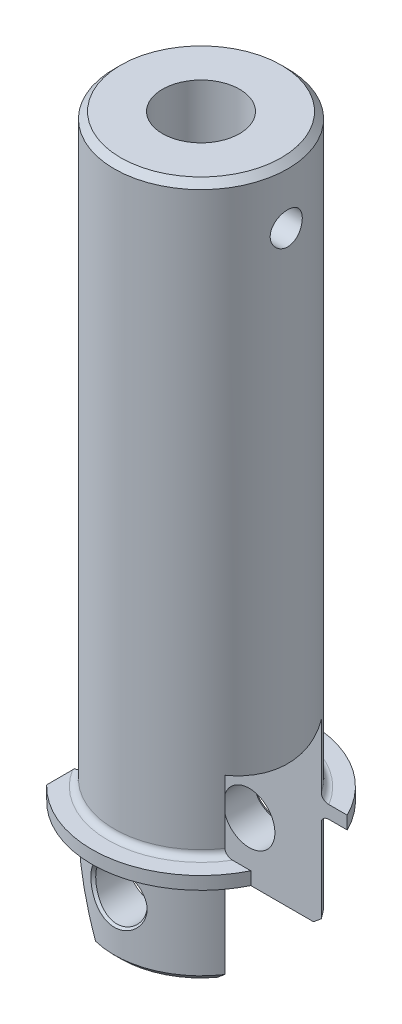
ISO-10303-21;
HEADER;
FILE_DESCRIPTION(('STEP AP214'),'2;1');
FILE_NAME('part.step','',(''),(''),'','','');
FILE_SCHEMA(('AUTOMOTIVE_DESIGN { 1 0 10303 214 1 1 1 1 }'));
ENDSEC;
DATA;
#1=APPLICATION_CONTEXT('core data for automotive mechanical design processes');
#2=APPLICATION_PROTOCOL_DEFINITION('international standard','automotive_design',2000,#1);
#3=PRODUCT_CONTEXT('',#1,'mechanical');
#4=PRODUCT('Part','Part','',(#3));
#5=PRODUCT_RELATED_PRODUCT_CATEGORY('part','',(#4));
#6=PRODUCT_DEFINITION_FORMATION('','',#4);
#7=PRODUCT_DEFINITION_CONTEXT('part definition',#1,'design');
#8=PRODUCT_DEFINITION('design','',#6,#7);
#9=PRODUCT_DEFINITION_SHAPE('','',#8);
#10=(LENGTH_UNIT() NAMED_UNIT(*) SI_UNIT(.MILLI.,.METRE.));
#11=(NAMED_UNIT(*) PLANE_ANGLE_UNIT() SI_UNIT($,.RADIAN.));
#12=(NAMED_UNIT(*) SI_UNIT($,.STERADIAN.) SOLID_ANGLE_UNIT());
#13=UNCERTAINTY_MEASURE_WITH_UNIT(LENGTH_MEASURE(1.E-05),#10,'distance_accuracy_value','');
#14=(GEOMETRIC_REPRESENTATION_CONTEXT(3) GLOBAL_UNCERTAINTY_ASSIGNED_CONTEXT((#13)) GLOBAL_UNIT_ASSIGNED_CONTEXT((#10,
#11,#12)) REPRESENTATION_CONTEXT('',''));
#15=CARTESIAN_POINT('',(0.,0.,0.));
#16=DIRECTION('',(0.,0.,1.));
#17=DIRECTION('',(1.,0.,0.));
#18=AXIS2_PLACEMENT_3D('',#15,#16,#17);
#19=CARTESIAN_POINT('',(2.2861035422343,17.,0.));
#20=DIRECTION('',(0.,1.,0.));
#21=DIRECTION('',(0.,0.,1.));
#22=AXIS2_PLACEMENT_3D('',#19,#20,#21);
#23=PLANE('',#22);
#24=DIRECTION('',(0.,0.,-1.));
#25=VECTOR('',#24,1.);
#26=CARTESIAN_POINT('',(-12.2249721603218,17.,17.));
#27=LINE('',#26,#25);
#28=CARTESIAN_POINT('',(-12.2249721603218,17.,-7.79743904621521));
#29=VERTEX_POINT('',#28);
#30=CARTESIAN_POINT('',(-12.2249721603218,17.,-11.8131306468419));
#31=VERTEX_POINT('',#30);
#32=EDGE_CURVE('E211',#29,#31,#27,.T.);
#33=ORIENTED_EDGE('',*,*,#32,.F.);
#34=CARTESIAN_POINT('',(0.,17.,0.));
#35=DIRECTION('',(0.,1.,0.));
#36=DIRECTION('',(0.,0.,1.));
#37=AXIS2_PLACEMENT_3D('',#34,#35,#36);
#38=CIRCLE('',#37,14.5);
#39=CARTESIAN_POINT('',(12.4096736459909,17.,-7.5));
#40=VERTEX_POINT('',#39);
#41=EDGE_CURVE('E246',#29,#40,#38,.F.);
#42=ORIENTED_EDGE('',*,*,#41,.T.);
#43=DIRECTION('',(1.,0.,0.));
#44=VECTOR('',#43,1.);
#45=CARTESIAN_POINT('',(2.2861035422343,17.,-7.5));
#46=LINE('',#45,#44);
#47=CARTESIAN_POINT('',(15.2561463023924,17.,-7.5));
#48=VERTEX_POINT('',#47);
#49=EDGE_CURVE('E298',#40,#48,#46,.T.);
#50=ORIENTED_EDGE('',*,*,#49,.T.);
#51=CARTESIAN_POINT('',(0.,17.,0.));
#52=DIRECTION('',(0.,-1.,0.));
#53=DIRECTION('',(0.,0.,-1.));
#54=AXIS2_PLACEMENT_3D('',#51,#52,#53);
#55=CIRCLE('',#54,17.);
#56=EDGE_CURVE('E216',#31,#48,#55,.T.);
#57=ORIENTED_EDGE('',*,*,#56,.F.);
#58=EDGE_LOOP('',(#33,#42,#50,#57));
#59=FACE_BOUND('',#58,.T.);
#60=ADVANCED_FACE('F34',(#59),#23,.T.);
#61=CARTESIAN_POINT('',(2.2861035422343,15.,0.));
#62=DIRECTION('',(0.,-1.,0.));
#63=DIRECTION('',(0.,0.,-1.));
#64=AXIS2_PLACEMENT_3D('',#61,#62,#63);
#65=PLANE('',#64);
#66=DIRECTION('',(0.,0.,1.));
#67=VECTOR('',#66,1.);
#68=CARTESIAN_POINT('',(-11.113214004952,15.,0.));
#69=LINE('',#68,#67);
#70=CARTESIAN_POINT('',(-11.113214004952,15.,-12.8645433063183));
#71=VERTEX_POINT('',#70);
#72=CARTESIAN_POINT('',(-11.113214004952,15.,-9.31377874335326));
#73=VERTEX_POINT('',#72);
#74=EDGE_CURVE('E639',#71,#73,#69,.T.);
#75=ORIENTED_EDGE('',*,*,#74,.F.);
#76=CARTESIAN_POINT('',(0.,15.,0.));
#77=DIRECTION('',(0.,-1.,0.));
#78=DIRECTION('',(0.,0.,-1.));
#79=AXIS2_PLACEMENT_3D('',#76,#77,#78);
#80=CIRCLE('',#79,17.);
#81=CARTESIAN_POINT('',(15.2561463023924,15.,-7.5));
#82=VERTEX_POINT('',#81);
#83=EDGE_CURVE('E223',#71,#82,#80,.T.);
#84=ORIENTED_EDGE('',*,*,#83,.T.);
#85=DIRECTION('',(-1.,0.,0.));
#86=VECTOR('',#85,1.);
#87=CARTESIAN_POINT('',(2.2861035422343,15.,-7.5));
#88=LINE('',#87,#86);
#89=CARTESIAN_POINT('',(12.4096736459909,15.,-7.5));
#90=VERTEX_POINT('',#89);
#91=EDGE_CURVE('E885',#82,#90,#88,.T.);
#92=ORIENTED_EDGE('',*,*,#91,.T.);
#93=CARTESIAN_POINT('',(0.,15.,0.));
#94=DIRECTION('',(0.,-1.,0.));
#95=DIRECTION('',(0.,0.,-1.));
#96=AXIS2_PLACEMENT_3D('',#93,#94,#95);
#97=CIRCLE('',#96,14.5);
#98=EDGE_CURVE('E250',#90,#73,#97,.F.);
#99=ORIENTED_EDGE('',*,*,#98,.T.);
#100=EDGE_LOOP('',(#75,#84,#92,#99));
#101=FACE_BOUND('',#100,.T.);
#102=ADVANCED_FACE('F589',(#101),#65,.T.);
#103=CARTESIAN_POINT('',(0.,0.,0.));
#104=DIRECTION('',(0.,-1.,0.));
#105=DIRECTION('',(0.,0.,-1.));
#106=AXIS2_PLACEMENT_3D('',#103,#104,#105);
#107=CYLINDRICAL_SURFACE('',#106,17.);
#108=CARTESIAN_POINT('',(0.,-4.99214298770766,0.));
#109=DIRECTION('',(0.874037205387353,0.485858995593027,0.));
#110=DIRECTION('',(0.485858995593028,-0.874037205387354,0.));
#111=AXIS2_PLACEMENT_3D('',#108,#109,#110);
#112=ELLIPSE('',#111,34.9895754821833,17.);
#113=EDGE_CURVE('E434',#31,#71,#112,.F.);
#114=ORIENTED_EDGE('',*,*,#113,.F.);
#115=ORIENTED_EDGE('',*,*,#56,.T.);
#116=DIRECTION('',(0.,-1.,0.));
#117=VECTOR('',#116,1.);
#118=CARTESIAN_POINT('',(15.2561463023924,0.,-7.5));
#119=LINE('',#118,#117);
#120=EDGE_CURVE('E884',#48,#82,#119,.T.);
#121=ORIENTED_EDGE('',*,*,#120,.T.);
#122=ORIENTED_EDGE('',*,*,#83,.F.);
#123=EDGE_LOOP('',(#114,#115,#121,#122));
#124=FACE_BOUND('',#123,.T.);
#125=ADVANCED_FACE('F595',(#124),#107,.T.);
#126=CARTESIAN_POINT('',(0.,0.,0.));
#127=DIRECTION('',(0.,1.,0.));
#128=DIRECTION('',(0.,0.,1.));
#129=AXIS2_PLACEMENT_3D('',#126,#127,#128);
#130=PLANE('',#129);
#131=DIRECTION('',(1.,0.,0.));
#132=VECTOR('',#131,1.);
#133=CARTESIAN_POINT('',(0.,0.,-7.5));
#134=LINE('',#133,#132);
#135=CARTESIAN_POINT('',(-2.77502783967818,0.,-7.5));
#136=VERTEX_POINT('',#135);
#137=CARTESIAN_POINT('',(10.,0.,-7.5));
#138=VERTEX_POINT('',#137);
#139=EDGE_CURVE('E633',#136,#138,#134,.T.);
#140=ORIENTED_EDGE('',*,*,#139,.F.);
#141=DIRECTION('',(0.,0.,-1.));
#142=VECTOR('',#141,1.);
#143=CARTESIAN_POINT('',(-2.77502783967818,0.,17.));
#144=LINE('',#143,#142);
#145=CARTESIAN_POINT('',(-2.77502783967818,0.,-12.1880769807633));
#146=VERTEX_POINT('',#145);
#147=EDGE_CURVE('E208',#136,#146,#144,.T.);
#148=ORIENTED_EDGE('',*,*,#147,.T.);
#149=CARTESIAN_POINT('',(0.,0.,0.));
#150=DIRECTION('',(0.,1.,0.));
#151=DIRECTION('',(0.,0.,1.));
#152=AXIS2_PLACEMENT_3D('',#149,#150,#151);
#153=CIRCLE('',#152,12.5);
#154=EDGE_CURVE('E237',#146,#138,#153,.F.);
#155=ORIENTED_EDGE('',*,*,#154,.T.);
#156=EDGE_LOOP('',(#140,#148,#155));
#157=FACE_BOUND('',#156,.T.);
#158=ADVANCED_FACE('F656',(#157),#130,.F.);
#159=CARTESIAN_POINT('',(0.,1.,0.));
#160=DIRECTION('',(0.,1.,0.));
#161=DIRECTION('',(0.,0.,1.));
#162=AXIS2_PLACEMENT_3D('',#159,#160,#161);
#163=CONICAL_SURFACE('',#162,13.5,0.785398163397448);
#164=CARTESIAN_POINT('',(-3.33101809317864,1.0002,-13.0828023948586));
#165=CARTESIAN_POINT('',(-3.23816457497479,0.833160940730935,-12.9340989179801));
#166=CARTESIAN_POINT('',(-3.14539603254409,0.666274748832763,-12.7851717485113));
#167=CARTESIAN_POINT('',(-2.96002888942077,0.332808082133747,-12.4868700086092));
#168=CARTESIAN_POINT('',(-2.86743028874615,0.166227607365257,-12.3374954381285));
#169=CARTESIAN_POINT('',(-2.77491666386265,-0.000199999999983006,-12.18789717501));
#170=B_SPLINE_CURVE_WITH_KNOTS('',3,(#164,#165,#166,#167,#168,#169),.UNSPECIFIED.,.F.,.F.,(4,2,
4),(0.,0.726448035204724,1.45289614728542),.UNSPECIFIED.);
#171=CARTESIAN_POINT('',(-3.3309069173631,1.,-13.0826243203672));
#172=VERTEX_POINT('',#171);
#173=EDGE_CURVE('E640',#172,#146,#170,.T.);
#174=ORIENTED_EDGE('',*,*,#173,.F.);
#175=CARTESIAN_POINT('',(0.,1.,0.));
#176=DIRECTION('',(0.,1.,0.));
#177=DIRECTION('',(0.,0.,1.));
#178=AXIS2_PLACEMENT_3D('',#175,#176,#177);
#179=CIRCLE('',#178,13.5);
#180=CARTESIAN_POINT('',(11.2249721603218,1.,-7.5));
#181=VERTEX_POINT('',#180);
#182=EDGE_CURVE('E233',#181,#172,#179,.T.);
#183=ORIENTED_EDGE('',*,*,#182,.F.);
#184=CARTESIAN_POINT('',(28.7491179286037,17.2113073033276,-7.5));
#185=CARTESIAN_POINT('',(28.0921534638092,16.5756551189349,-7.5));
#186=CARTESIAN_POINT('',(27.4345291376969,15.9406826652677,-7.5));
#187=CARTESIAN_POINT('',(26.1175628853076,14.6725042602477,-7.5));
#188=CARTESIAN_POINT('',(25.4582209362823,14.0392983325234,-7.5));
#189=CARTESIAN_POINT('',(24.1370876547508,12.7747406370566,-7.5));
#190=CARTESIAN_POINT('',(23.4752952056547,12.1433900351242,-7.5));
#191=CARTESIAN_POINT('',(22.1490549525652,10.8834912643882,-7.5));
#192=CARTESIAN_POINT('',(21.4846071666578,10.2549430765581,-7.5));
#193=CARTESIAN_POINT('',(20.165754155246,9.01414975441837,-7.5));
#194=CARTESIAN_POINT('',(19.5114174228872,8.40183189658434,-7.5));
#195=CARTESIAN_POINT('',(18.1984268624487,7.1818145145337,-7.5));
#196=CARTESIAN_POINT('',(17.5397729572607,6.5741150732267,-7.5));
#197=CARTESIAN_POINT('',(16.2168498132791,5.36515374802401,-7.5));
#198=CARTESIAN_POINT('',(15.5525819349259,4.76389038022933,-7.5));
#199=CARTESIAN_POINT('',(14.5501815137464,3.86873226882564,-7.5));
#200=CARTESIAN_POINT('',(14.2150532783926,3.5714734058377,-7.5));
#201=CARTESIAN_POINT('',(13.5423935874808,2.97968911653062,-7.5));
#202=CARTESIAN_POINT('',(13.2048621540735,2.68516366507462,-7.5));
#203=CARTESIAN_POINT('',(12.661392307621,2.21564731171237,-7.5));
#204=CARTESIAN_POINT('',(12.456373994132,2.0395913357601,-7.5));
#205=CARTESIAN_POINT('',(12.0451491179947,1.68887250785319,-7.5));
#206=CARTESIAN_POINT('',(11.8389425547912,1.51420965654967,-7.5));
#207=CARTESIAN_POINT('',(11.2182796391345,0.992567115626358,-7.5));
#208=CARTESIAN_POINT('',(10.8018175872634,0.6479659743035,-7.5));
#209=CARTESIAN_POINT('',(9.95753202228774,-0.0364337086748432,-7.5));
#210=CARTESIAN_POINT('',(9.52963468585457,-0.376141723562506,-7.5));
#211=CARTESIAN_POINT('',(8.88089427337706,-0.876682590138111,-7.5));
#212=CARTESIAN_POINT('',(8.66351940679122,-1.04201072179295,-7.5));
#213=CARTESIAN_POINT('',(8.22608990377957,-1.36907822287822,-7.5));
#214=CARTESIAN_POINT('',(8.00603534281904,-1.53081769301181,-7.5));
#215=CARTESIAN_POINT('',(7.55940383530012,-1.85245519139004,-7.5));
#216=CARTESIAN_POINT('',(7.33277863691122,-2.01228637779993,-7.5));
#217=CARTESIAN_POINT('',(6.87579821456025,-2.3265506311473,-7.5));
#218=CARTESIAN_POINT('',(6.64544292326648,-2.48098360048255,-7.5));
#219=CARTESIAN_POINT('',(6.18006300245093,-2.78342413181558,-7.5));
#220=CARTESIAN_POINT('',(5.94503212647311,-2.93142212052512,-7.5));
#221=CARTESIAN_POINT('',(5.46993675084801,-3.21913453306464,-7.5));
#222=CARTESIAN_POINT('',(5.22987240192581,-3.35884920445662,-7.5));
#223=CARTESIAN_POINT('',(4.74697674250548,-3.62622607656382,-7.5));
#224=CARTESIAN_POINT('',(4.5042168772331,-3.7540164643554,-7.5));
#225=CARTESIAN_POINT('',(4.01231094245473,-3.99688946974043,-7.5));
#226=CARTESIAN_POINT('',(3.76316373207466,-4.11196979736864,-7.5));
#227=CARTESIAN_POINT('',(3.25870728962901,-4.32582406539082,-7.5));
#228=CARTESIAN_POINT('',(3.00341708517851,-4.42464238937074,-7.5));
#229=CARTESIAN_POINT('',(2.48609270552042,-4.60242057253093,-7.5));
#230=CARTESIAN_POINT('',(2.22406310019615,-4.68139351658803,-7.5));
#231=CARTESIAN_POINT('',(1.71215236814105,-4.8107545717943,-7.5));
#232=CARTESIAN_POINT('',(1.46268019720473,-4.86273880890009,-7.5));
#233=CARTESIAN_POINT('',(0.959884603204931,-4.94289314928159,-7.5));
#234=CARTESIAN_POINT('',(0.706561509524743,-4.97106527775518,-7.5));
#235=CARTESIAN_POINT('',(0.19908752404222,-5.00161961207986,-7.5));
#236=CARTESIAN_POINT('',(-0.0550586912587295,-5.0040779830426,-7.5));
#237=CARTESIAN_POINT('',(-0.562291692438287,-4.98322334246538,-7.5));
#238=CARTESIAN_POINT('',(-0.815378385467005,-4.95990811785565,-7.5));
#239=CARTESIAN_POINT('',(-1.31589253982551,-4.88943802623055,-7.5));
#240=CARTESIAN_POINT('',(-1.56335010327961,-4.8424927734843,-7.5));
#241=CARTESIAN_POINT('',(-2.05330205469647,-4.72766040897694,-7.5));
#242=CARTESIAN_POINT('',(-2.29579586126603,-4.6597708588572,-7.5));
#243=CARTESIAN_POINT('',(-2.77640788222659,-4.50585991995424,-7.5));
#244=CARTESIAN_POINT('',(-3.01449366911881,-4.41973834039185,-7.5));
#245=CARTESIAN_POINT('',(-3.36713579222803,-4.27953924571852,-7.5));
#246=CARTESIAN_POINT('',(-3.48393025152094,-4.23097252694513,-7.5));
#247=CARTESIAN_POINT('',(-3.71607839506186,-4.13051418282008,-7.5));
#248=CARTESIAN_POINT('',(-3.83143211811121,-4.07862264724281,-7.5));
#249=CARTESIAN_POINT('',(-4.17848858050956,-3.91702703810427,-7.5));
#250=CARTESIAN_POINT('',(-4.40803292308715,-3.80267368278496,-7.5));
#251=CARTESIAN_POINT('',(-4.86193690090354,-3.56405264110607,-7.5));
#252=CARTESIAN_POINT('',(-5.08629507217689,-3.43978219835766,-7.5));
#253=CARTESIAN_POINT('',(-5.53060164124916,-3.18309899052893,-7.5));
#254=CARTESIAN_POINT('',(-5.75054512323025,-3.05067775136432,-7.5));
#255=CARTESIAN_POINT('',(-6.18633047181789,-2.77931966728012,-7.5));
#256=CARTESIAN_POINT('',(-6.40217269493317,-2.64038339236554,-7.5));
#257=CARTESIAN_POINT('',(-6.83114363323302,-2.35660031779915,-7.5));
#258=CARTESIAN_POINT('',(-7.04425837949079,-2.21173246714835,-7.5));
#259=CARTESIAN_POINT('',(-7.46738657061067,-1.9175263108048,-7.5));
#260=CARTESIAN_POINT('',(-7.67739986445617,-1.7681877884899,-7.5));
#261=CARTESIAN_POINT('',(-8.09460424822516,-1.46587290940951,-7.5));
#262=CARTESIAN_POINT('',(-8.30179687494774,-1.31289866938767,-7.5));
#263=CARTESIAN_POINT('',(-8.7138311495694,-1.00381239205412,-7.5));
#264=CARTESIAN_POINT('',(-8.91867274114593,-0.847700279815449,-7.5));
#265=CARTESIAN_POINT('',(-9.5355001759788,-0.371244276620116,-7.5));
#266=CARTESIAN_POINT('',(-9.94431053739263,-0.0467879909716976,-7.5));
#267=CARTESIAN_POINT('',(-10.7555127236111,0.610095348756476,-7.5));
#268=CARTESIAN_POINT('',(-11.1579038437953,0.942523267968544,-7.5));
#269=CARTESIAN_POINT('',(-11.9566625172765,1.61257023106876,-7.5));
#270=CARTESIAN_POINT('',(-12.3530423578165,1.95017465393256,-7.5));
#271=CARTESIAN_POINT('',(-13.1418129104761,2.63001542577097,-7.5));
#272=CARTESIAN_POINT('',(-13.5342035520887,2.97225185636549,-7.5));
#273=CARTESIAN_POINT('',(-14.5735087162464,3.88725553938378,-7.5));
#274=CARTESIAN_POINT('',(-15.2176175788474,4.46320742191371,-7.5));
#275=CARTESIAN_POINT('',(-16.4995382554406,5.6220882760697,-7.5));
#276=CARTESIAN_POINT('',(-17.1373498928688,6.20501744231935,-7.5));
#277=CARTESIAN_POINT('',(-18.4088830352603,7.376515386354,-7.5));
#278=CARTESIAN_POINT('',(-19.0426001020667,7.96508897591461,-7.5));
#279=CARTESIAN_POINT('',(-20.3064623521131,9.14605819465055,-7.5));
#280=CARTESIAN_POINT('',(-20.9366075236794,9.73845383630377,-7.5));
#281=CARTESIAN_POINT('',(-22.1682665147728,10.9017706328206,-7.5));
#282=CARTESIAN_POINT('',(-22.7698923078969,11.4725733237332,-7.5));
#283=CARTESIAN_POINT('',(-23.9710997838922,12.6163291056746,-7.5));
#284=CARTESIAN_POINT('',(-24.5706814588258,13.1892822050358,-7.5));
#285=CARTESIAN_POINT('',(-25.7675184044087,14.3362769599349,-7.5));
#286=CARTESIAN_POINT('',(-26.3647755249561,14.9103166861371,-7.5));
#287=CARTESIAN_POINT('',(-27.5579102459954,16.0598185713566,-7.5));
#288=CARTESIAN_POINT('',(-28.1537878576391,16.6352807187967,-7.5));
#289=CARTESIAN_POINT('',(-28.7491179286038,17.2113073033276,-7.5));
#290=B_SPLINE_CURVE_WITH_KNOTS('',3,(#184,#185,#186,#187,#188,#189,#190,#191,#192,#193,#194,
#195,#196,#197,#198,#199,#200,#201,#202,#203,#204,#205,#206,#207,#208,#209,#210,#211,#212,#213,
#214,#215,#216,#217,#218,#219,#220,#221,#222,#223,#224,#225,#226,#227,#228,#229,#230,#231,#232,
#233,#234,#235,#236,#237,#238,#239,#240,#241,#242,#243,#244,#245,#246,#247,#248,#249,#250,#251,
#252,#253,#254,#255,#256,#257,#258,#259,#260,#261,#262,#263,#264,#265,#266,#267,#268,#269,#270,
#271,#272,#273,#274,#275,#276,#277,#278,#279,#280,#281,#282,#283,#284,#285,#286,#287,#288,#289),
.UNSPECIFIED.,.F.,.F.,(4,2,2,2,2,2,2,2,2,2,2,2,2,2,2,2,2,2,2,2,2,2,2,2,2,2,2,2,2,2,2,2,2,2,2,2,
2,2,2,2,2,2,2,2,2,2,2,2,2,2,2,2,4),(0.,2.74242852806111,5.48489356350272,8.22881779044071,
10.97272335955,13.6611642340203,16.3496532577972,19.0375084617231,20.3813962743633,
21.725271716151,22.5359782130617,23.3466850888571,24.9682478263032,26.6071193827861,
27.4263993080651,28.2456562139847,29.0775447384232,29.9094482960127,30.7425498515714,
31.5756264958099,32.3983517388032,33.2212249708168,34.0418137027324,34.8618599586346,
35.6253340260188,36.3887431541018,37.1498903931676,37.9111029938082,38.6656790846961,
39.4203430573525,40.1792671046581,40.5586949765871,40.9381126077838,41.7071352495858,
42.4763723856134,43.2464232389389,44.0164068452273,44.7894114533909,45.562453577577,
46.3350561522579,47.1076771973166,48.6732742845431,50.2390420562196,51.80099497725,
53.3629754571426,55.9550682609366,58.5472335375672,61.1418500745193,63.73647508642,
66.2244243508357,68.7123832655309,71.1975646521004,73.6827258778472),.UNSPECIFIED.);
#291=EDGE_CURVE('E284',#181,#138,#290,.T.);
#292=ORIENTED_EDGE('',*,*,#291,.T.);
#293=ORIENTED_EDGE('',*,*,#154,.F.);
#294=EDGE_LOOP('',(#174,#183,#292,#293));
#295=FACE_BOUND('',#294,.T.);
#296=ADVANCED_FACE('F373',(#295),#163,.T.);
#297=CARTESIAN_POINT('',(0.,108.,0.));
#298=DIRECTION('',(0.,-1.,0.));
#299=DIRECTION('',(0.,0.,-1.));
#300=AXIS2_PLACEMENT_3D('',#297,#298,#299);
#301=CYLINDRICAL_SURFACE('',#300,13.5);
#302=CARTESIAN_POINT('',(4.3769596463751,8.99999999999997,-12.7707566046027));
#303=CARTESIAN_POINT('',(4.37695435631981,8.92986507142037,-12.7707567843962));
#304=CARTESIAN_POINT('',(4.37508399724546,8.85973473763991,-12.7714466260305));
#305=CARTESIAN_POINT('',(4.3676818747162,8.71981850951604,-12.7741290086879));
#306=CARTESIAN_POINT('',(4.36215670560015,8.65003222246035,-12.7761192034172));
#307=CARTESIAN_POINT('',(4.34751985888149,8.51094852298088,-12.7813238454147));
#308=CARTESIAN_POINT('',(4.33841143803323,8.4416507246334,-12.7845371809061));
#309=CARTESIAN_POINT('',(4.31668603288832,8.30368484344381,-12.7921085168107));
#310=CARTESIAN_POINT('',(4.30406970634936,8.2350166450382,-12.7964663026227));
#311=CARTESIAN_POINT('',(4.27540465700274,8.09845145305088,-12.8062476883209));
#312=CARTESIAN_POINT('',(4.25935465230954,8.03055475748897,-12.8116716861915));
#313=CARTESIAN_POINT('',(4.22389803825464,7.89567372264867,-12.823506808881));
#314=CARTESIAN_POINT('',(4.20448877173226,7.8286901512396,-12.8299187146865));
#315=CARTESIAN_POINT('',(4.16238879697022,7.69577655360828,-12.843651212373));
#316=CARTESIAN_POINT('',(4.13969452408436,7.6298477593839,-12.8509727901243));
#317=CARTESIAN_POINT('',(4.09109926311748,7.49918492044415,-12.8664463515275));
#318=CARTESIAN_POINT('',(4.06519417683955,7.4344525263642,-12.8745993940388));
#319=CARTESIAN_POINT('',(4.01025164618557,7.30632376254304,-12.8916577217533));
#320=CARTESIAN_POINT('',(3.98120985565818,7.24292939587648,-12.9005640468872));
#321=CARTESIAN_POINT('',(3.92006800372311,7.11761804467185,-12.9190508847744));
#322=CARTESIAN_POINT('',(3.88796355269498,7.05570334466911,-12.9286323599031));
#323=CARTESIAN_POINT('',(3.82077025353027,6.93349276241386,-12.9483913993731));
#324=CARTESIAN_POINT('',(3.78567710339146,6.87319938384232,-12.9585698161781));
#325=CARTESIAN_POINT('',(3.71258021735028,6.7543729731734,-12.9794450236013));
#326=CARTESIAN_POINT('',(3.67457233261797,6.69584262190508,-12.9901425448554));
#327=CARTESIAN_POINT('',(3.59571949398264,6.58068376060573,-13.0119769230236));
#328=CARTESIAN_POINT('',(3.55487055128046,6.52405809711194,-13.0231143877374));
#329=CARTESIAN_POINT('',(3.47040998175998,6.41285042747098,-13.0457545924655));
#330=CARTESIAN_POINT('',(3.42679448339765,6.35827146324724,-13.0572578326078));
#331=CARTESIAN_POINT('',(3.33687196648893,6.2512978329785,-13.0805368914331));
#332=CARTESIAN_POINT('',(3.29056110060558,6.1989064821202,-13.0923130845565));
#333=CARTESIAN_POINT('',(3.1953313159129,6.09645292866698,-13.1161150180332));
#334=CARTESIAN_POINT('',(3.14640846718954,6.0463944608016,-13.1281411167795));
#335=CARTESIAN_POINT('',(3.04600307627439,5.94874550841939,-13.1521566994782));
#336=CARTESIAN_POINT('',(2.99451681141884,5.90115883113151,-13.1641461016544));
#337=CARTESIAN_POINT('',(2.88910780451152,5.80852405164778,-13.1878114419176));
#338=CARTESIAN_POINT('',(2.83518170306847,5.76347965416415,-13.1994869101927));
#339=CARTESIAN_POINT('',(2.72505223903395,5.67600512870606,-13.222510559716));
#340=CARTESIAN_POINT('',(2.66884569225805,5.63357888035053,-13.2338582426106));
#341=CARTESIAN_POINT('',(2.55430218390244,5.55141245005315,-13.2561424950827));
#342=CARTESIAN_POINT('',(2.49596235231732,5.5116761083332,-13.2670784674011));
#343=CARTESIAN_POINT('',(2.37730224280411,5.43496261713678,-13.2884742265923));
#344=CARTESIAN_POINT('',(2.31697949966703,5.39798910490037,-13.2989333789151));
#345=CARTESIAN_POINT('',(2.19450258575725,5.32687426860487,-13.3193053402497));
#346=CARTESIAN_POINT('',(2.13234638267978,5.29273626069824,-13.3292175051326));
#347=CARTESIAN_POINT('',(2.0063517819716,5.22736563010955,-13.3484266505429));
#348=CARTESIAN_POINT('',(1.9425117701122,5.19613593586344,-13.3577230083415));
#349=CARTESIAN_POINT('',(1.81329874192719,5.13665517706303,-13.3756313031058));
#350=CARTESIAN_POINT('',(1.74792448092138,5.10840664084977,-13.3842426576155));
#351=CARTESIAN_POINT('',(1.61579221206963,5.05496146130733,-13.4007117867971));
#352=CARTESIAN_POINT('',(1.54903325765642,5.02976699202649,-13.4085690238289));
#353=CARTESIAN_POINT('',(1.41428092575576,4.98250316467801,-13.4234607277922));
#354=CARTESIAN_POINT('',(1.34628681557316,4.96043573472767,-13.4304946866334));
#355=CARTESIAN_POINT('',(1.20921357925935,4.91949908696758,-13.4436706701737));
#356=CARTESIAN_POINT('',(1.14013384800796,4.90063172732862,-13.4498121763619));
#357=CARTESIAN_POINT('',(1.00103885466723,4.86616817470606,-13.461134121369));
#358=CARTESIAN_POINT('',(0.931023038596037,4.85057401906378,-13.4663139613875));
#359=CARTESIAN_POINT('',(0.790205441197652,4.82272945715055,-13.4756435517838));
#360=CARTESIAN_POINT('',(0.719403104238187,4.81048159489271,-13.479792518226));
#361=CARTESIAN_POINT('',(0.577162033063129,4.78940231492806,-13.4869913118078));
#362=CARTESIAN_POINT('',(0.505722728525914,4.78057435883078,-13.490040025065));
#363=CARTESIAN_POINT('',(0.362357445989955,4.76640550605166,-13.4949699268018));
#364=CARTESIAN_POINT('',(0.290430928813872,4.76106948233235,-13.4968494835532));
#365=CARTESIAN_POINT('',(0.146240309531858,4.75396082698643,-13.4993709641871));
#366=CARTESIAN_POINT('',(0.073975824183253,4.75219507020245,-13.5000105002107));
#367=CARTESIAN_POINT('',(-0.0705506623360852,4.75227930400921,-13.4999892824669));
#368=CARTESIAN_POINT('',(-0.142812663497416,4.75412930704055,-13.4993285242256));
#369=CARTESIAN_POINT('',(-0.286995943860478,4.7613721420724,-13.4967749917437));
#370=CARTESIAN_POINT('',(-0.358917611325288,4.7667581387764,-13.4948845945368));
#371=CARTESIAN_POINT('',(-0.502272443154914,4.78100510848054,-13.4899394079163));
#372=CARTESIAN_POINT('',(-0.573706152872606,4.78986117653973,-13.4868862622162));
#373=CARTESIAN_POINT('',(-0.715937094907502,4.81097487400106,-13.4796848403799));
#374=CARTESIAN_POINT('',(-0.786734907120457,4.82322898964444,-13.4755376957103));
#375=CARTESIAN_POINT('',(-0.927546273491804,4.8510675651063,-13.4662168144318));
#376=CARTESIAN_POINT('',(-0.99756039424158,4.86664943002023,-13.4610438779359));
#377=CARTESIAN_POINT('',(-1.1366565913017,4.90107230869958,-13.4497399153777));
#378=CARTESIAN_POINT('',(-1.2057392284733,4.91991125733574,-13.4436094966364));
#379=CARTESIAN_POINT('',(-1.34282464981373,4.96077760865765,-13.4304589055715));
#380=CARTESIAN_POINT('',(-1.4108280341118,4.98280316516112,-13.4234392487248));
#381=CARTESIAN_POINT('',(-1.54560707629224,5.0299723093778,-13.4085784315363));
#382=CARTESIAN_POINT('',(-1.61238344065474,5.05511403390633,-13.4007377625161));
#383=CARTESIAN_POINT('',(-1.74456048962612,5.10844533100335,-13.3843031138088));
#384=CARTESIAN_POINT('',(-1.80996206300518,5.13663285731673,-13.3757096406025));
#385=CARTESIAN_POINT('',(-1.93924148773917,5.19598573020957,-13.3578375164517));
#386=CARTESIAN_POINT('',(-2.00312048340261,5.22714874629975,-13.3485594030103));
#387=CARTESIAN_POINT('',(-2.12920663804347,5.29238268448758,-13.329386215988));
#388=CARTESIAN_POINT('',(-2.19141525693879,5.32645095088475,-13.3194917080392));
#389=CARTESIAN_POINT('',(-2.31401244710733,5.39742545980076,-13.2991535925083));
#390=CARTESIAN_POINT('',(-2.37440283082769,5.43432873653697,-13.2887105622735));
#391=CARTESIAN_POINT('',(-2.49321541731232,5.51090352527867,-13.2673446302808));
#392=CARTESIAN_POINT('',(-2.55163978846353,5.55057182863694,-13.2564222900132));
#393=CARTESIAN_POINT('',(-2.66637177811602,5.63260610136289,-13.2341619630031));
#394=CARTESIAN_POINT('',(-2.72268188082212,5.67496873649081,-13.222824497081));
#395=CARTESIAN_POINT('',(-2.8330384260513,5.76232382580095,-13.1998169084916));
#396=CARTESIAN_POINT('',(-2.88708756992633,5.80731297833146,-13.1881472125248));
#397=CARTESIAN_POINT('',(-2.99276935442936,5.89984252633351,-13.1644883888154));
#398=CARTESIAN_POINT('',(-3.04440475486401,5.9473798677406,-13.1524996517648));
#399=CARTESIAN_POINT('',(-3.14510799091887,6.04494615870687,-13.1284809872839));
#400=CARTESIAN_POINT('',(-3.19417940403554,6.09497143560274,-13.1164511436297));
#401=CARTESIAN_POINT('',(-3.28967734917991,6.19738112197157,-13.0926394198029));
#402=CARTESIAN_POINT('',(-3.33610814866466,6.24976146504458,-13.08085716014));
#403=CARTESIAN_POINT('',(-3.42624860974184,6.35672832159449,-13.0575642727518));
#404=CARTESIAN_POINT('',(-3.46996237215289,6.41131129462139,-13.046053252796));
#405=CARTESIAN_POINT('',(-3.55459828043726,6.52254119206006,-13.0233960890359));
#406=CARTESIAN_POINT('',(-3.59552448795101,6.57918492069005,-13.0122494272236));
#407=CARTESIAN_POINT('',(-3.67451307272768,6.69439145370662,-12.9903956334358));
#408=CARTESIAN_POINT('',(-3.71257957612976,6.75295131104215,-12.9796878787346));
#409=CARTESIAN_POINT('',(-3.78577685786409,6.87184607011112,-12.9587915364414));
#410=CARTESIAN_POINT('',(-3.82091188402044,6.9321782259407,-12.9486022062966));
#411=CARTESIAN_POINT('',(-3.88817414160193,7.05447339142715,-12.928821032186));
#412=CARTESIAN_POINT('',(-3.92030575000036,7.11643385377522,-12.9192283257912));
#413=CARTESIAN_POINT('',(-3.98148912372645,7.24184149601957,-12.9007190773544));
#414=CARTESIAN_POINT('',(-4.01054534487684,7.30528635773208,-12.8918015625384));
#415=CARTESIAN_POINT('',(-4.06550593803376,7.43351861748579,-12.8747212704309));
#416=CARTESIAN_POINT('',(-4.09141472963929,7.49830397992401,-12.8665574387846));
#417=CARTESIAN_POINT('',(-4.14000857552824,7.62907301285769,-12.8510630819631));
#418=CARTESIAN_POINT('',(-4.16269782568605,7.69505499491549,-12.8437314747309));
#419=CARTESIAN_POINT('',(-4.20478089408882,7.8280729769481,-12.829980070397));
#420=CARTESIAN_POINT('',(-4.22417841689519,7.895107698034,-12.8235592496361));
#421=CARTESIAN_POINT('',(-4.25960659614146,8.03008681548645,-12.8117078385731));
#422=CARTESIAN_POINT('',(-4.27564011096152,8.09803038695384,-12.8062764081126));
#423=CARTESIAN_POINT('',(-4.30426924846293,8.23468281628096,-12.7964820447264));
#424=CARTESIAN_POINT('',(-4.3168664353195,8.30339131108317,-12.792118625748));
#425=CARTESIAN_POINT('',(-4.33855217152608,8.44142924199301,-12.78453845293));
#426=CARTESIAN_POINT('',(-4.34764044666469,8.51075872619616,-12.7813217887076));
#427=CARTESIAN_POINT('',(-4.36223882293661,8.64989420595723,-12.7761127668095));
#428=CARTESIAN_POINT('',(-4.3677461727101,8.7197005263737,-12.7741213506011));
#429=CARTESIAN_POINT('',(-4.37511135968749,8.85964595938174,-12.7714412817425));
#430=CARTESIAN_POINT('',(-4.37696323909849,8.92978542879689,-12.7707547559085));
#431=CARTESIAN_POINT('',(-4.37695605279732,9.07005381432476,-12.7707584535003));
#432=CARTESIAN_POINT('',(-4.37509752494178,9.14018273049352,-12.7714484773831));
#433=CARTESIAN_POINT('',(-4.36773147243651,9.28008858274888,-12.7741300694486));
#434=CARTESIAN_POINT('',(-4.36223088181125,9.34986593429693,-12.7761191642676));
#435=CARTESIAN_POINT('',(-4.34765388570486,9.48892801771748,-12.781320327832));
#436=CARTESIAN_POINT('',(-4.33858108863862,9.55821317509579,-12.7845311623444));
#437=CARTESIAN_POINT('',(-4.31693446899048,9.69615011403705,-12.7920965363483));
#438=CARTESIAN_POINT('',(-4.30436163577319,9.76480206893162,-12.7964507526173));
#439=CARTESIAN_POINT('',(-4.27578838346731,9.9013321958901,-12.8062242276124));
#440=CARTESIAN_POINT('',(-4.25978696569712,9.96921013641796,-12.8116437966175));
#441=CARTESIAN_POINT('',(-4.22442952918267,10.1040519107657,-12.8234695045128));
#442=CARTESIAN_POINT('',(-4.20507106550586,10.171015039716,-12.8298763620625));
#443=CARTESIAN_POINT('',(-4.16307194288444,10.3038869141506,-12.8435984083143));
#444=CARTESIAN_POINT('',(-4.14042784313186,10.3697944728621,-12.850914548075));
#445=CARTESIAN_POINT('',(-4.09192942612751,10.5004149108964,-12.8663770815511));
#446=CARTESIAN_POINT('',(-4.06607103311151,10.5651261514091,-12.8745245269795));
#447=CARTESIAN_POINT('',(-4.01121565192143,10.6932136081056,-12.8915717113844));
#448=CARTESIAN_POINT('',(-3.98221422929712,10.7565877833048,-12.9004725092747));
#449=CARTESIAN_POINT('',(-3.92114414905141,10.8818606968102,-12.9189485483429));
#450=CARTESIAN_POINT('',(-3.88907089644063,10.9437570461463,-12.9285247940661));
#451=CARTESIAN_POINT('',(-3.82192830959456,11.0659338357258,-12.9482738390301));
#452=CARTESIAN_POINT('',(-3.78685434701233,11.1262115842,-12.9584475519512));
#453=CARTESIAN_POINT('',(-3.71378143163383,11.245010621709,-12.9793140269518));
#454=CARTESIAN_POINT('',(-3.67577788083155,11.3035289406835,-12.9900075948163));
#455=CARTESIAN_POINT('',(-3.59691659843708,11.418668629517,-13.011834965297));
#456=CARTESIAN_POINT('',(-3.55605430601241,11.4752867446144,-13.022969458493));
#457=CARTESIAN_POINT('',(-3.47154717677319,11.5864851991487,-13.0456048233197));
#458=CARTESIAN_POINT('',(-3.42789777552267,11.6410619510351,-13.0571062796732));
#459=CARTESIAN_POINT('',(-3.33788499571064,11.7480381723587,-13.080383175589));
#460=CARTESIAN_POINT('',(-3.29151695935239,11.8004336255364,-13.0921590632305));
#461=CARTESIAN_POINT('',(-3.19614720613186,11.9029030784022,-13.1159617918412));
#462=CARTESIAN_POINT('',(-3.14714064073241,11.9529724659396,-13.1279890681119));
#463=CARTESIAN_POINT('',(-3.04655093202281,12.0506439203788,-13.1520071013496));
#464=CARTESIAN_POINT('',(-2.99496352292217,12.0982416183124,-13.1639977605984));
#465=CARTESIAN_POINT('',(-2.88934693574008,12.1908923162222,-13.1876646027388));
#466=CARTESIAN_POINT('',(-2.83531429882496,12.2359414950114,-13.1993403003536));
#467=CARTESIAN_POINT('',(-2.72496784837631,12.3234205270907,-13.2223634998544));
#468=CARTESIAN_POINT('',(-2.66865075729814,12.365846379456,-13.2337104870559));
#469=CARTESIAN_POINT('',(-2.55388415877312,12.4480085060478,-13.255992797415));
#470=CARTESIAN_POINT('',(-2.49543170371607,12.4877408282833,-13.2669275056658));
#471=CARTESIAN_POINT('',(-2.37654610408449,12.5644441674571,-13.288320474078));
#472=CARTESIAN_POINT('',(-2.31611043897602,12.6014114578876,-13.298778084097));
#473=CARTESIAN_POINT('',(-2.19340923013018,12.6725131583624,-13.3191470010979));
#474=CARTESIAN_POINT('',(-2.13114162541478,12.7066441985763,-13.3290576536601));
#475=CARTESIAN_POINT('',(-2.00492754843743,12.7720015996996,-13.3482641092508));
#476=CARTESIAN_POINT('',(-1.94097946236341,12.8032250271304,-13.3575592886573));
#477=CARTESIAN_POINT('',(-1.81155539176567,12.8626953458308,-13.375465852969));
#478=CARTESIAN_POINT('',(-1.74607819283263,12.8909397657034,-13.3840766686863));
#479=CARTESIAN_POINT('',(-1.61374693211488,12.9443801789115,-13.4005456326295));
#480=CARTESIAN_POINT('',(-1.54689198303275,12.9695741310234,-13.408403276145));
#481=CARTESIAN_POINT('',(-1.41195632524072,13.0168417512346,-13.4232969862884));
#482=CARTESIAN_POINT('',(-1.34387496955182,13.0389137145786,-13.4303326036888));
#483=CARTESIAN_POINT('',(-1.20663768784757,13.0798655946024,-13.443513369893));
#484=CARTESIAN_POINT('',(-1.13748126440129,13.0987439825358,-13.4496580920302));
#485=CARTESIAN_POINT('',(-0.998245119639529,13.133237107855,-13.46098820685));
#486=CARTESIAN_POINT('',(-0.928164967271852,13.1488502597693,-13.4661731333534));
#487=CARTESIAN_POINT('',(-0.787232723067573,13.1767415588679,-13.4755148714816));
#488=CARTESIAN_POINT('',(-0.716380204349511,13.1890177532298,-13.4796710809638));
#489=CARTESIAN_POINT('',(-0.574054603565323,13.2101640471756,-13.48688666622));
#490=CARTESIAN_POINT('',(-0.502581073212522,13.2190314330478,-13.489945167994));
#491=CARTESIAN_POINT('',(-0.359164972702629,13.2332896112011,-13.4948968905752));
#492=CARTESIAN_POINT('',(-0.287221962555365,13.2386764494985,-13.4967887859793));
#493=CARTESIAN_POINT('',(-0.143017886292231,13.2459028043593,-13.4993385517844));
#494=CARTESIAN_POINT('',(-0.0707564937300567,13.2477365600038,-13.4999944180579));
#495=CARTESIAN_POINT('',(0.0737466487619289,13.2477892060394,-13.500005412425));
#496=CARTESIAN_POINT('',(0.145988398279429,13.2460091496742,-13.499360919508));
#497=CARTESIAN_POINT('',(0.290117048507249,13.2388917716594,-13.4968356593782));
#498=CARTESIAN_POINT('',(0.362004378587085,13.2335621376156,-13.4949575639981));
#499=CARTESIAN_POINT('',(0.505277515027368,13.2194187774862,-13.4900342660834));
#500=CARTESIAN_POINT('',(0.576663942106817,13.210610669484,-13.4869909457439));
#501=CARTESIAN_POINT('',(0.718788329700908,13.1895835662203,-13.479806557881));
#502=CARTESIAN_POINT('',(0.789526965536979,13.1773686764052,-13.4756668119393));
#503=CARTESIAN_POINT('',(0.930209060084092,13.1496004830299,-13.4663585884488));
#504=CARTESIAN_POINT('',(1.00015318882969,13.1340502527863,-13.4611910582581));
#505=CARTESIAN_POINT('',(1.139099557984,13.0996834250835,-13.4498961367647));
#506=CARTESIAN_POINT('',(1.2081024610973,13.0808692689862,-13.4437694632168));
#507=CARTESIAN_POINT('',(1.34501965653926,13.0400462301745,-13.4306249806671));
#508=CARTESIAN_POINT('',(1.41293464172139,13.0180394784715,-13.4236077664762));
#509=CARTESIAN_POINT('',(1.54752922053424,12.9709025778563,-13.408750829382));
#510=CARTESIAN_POINT('',(1.6142095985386,12.9457744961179,-13.4009116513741));
#511=CARTESIAN_POINT('',(1.74618810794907,12.8924660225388,-13.3844793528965));
#512=CARTESIAN_POINT('',(1.81148718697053,12.8642878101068,-13.3758867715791));
#513=CARTESIAN_POINT('',(1.94055615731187,12.8049499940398,-13.3580161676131));
#514=CARTESIAN_POINT('',(2.00432722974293,12.7737927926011,-13.3487386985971));
#515=CARTESIAN_POINT('',(2.1301931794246,12.7085677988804,-13.32956690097));
#516=CARTESIAN_POINT('',(2.19228952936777,12.6745026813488,-13.3196731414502));
#517=CARTESIAN_POINT('',(2.31465891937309,12.6035326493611,-13.2993369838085));
#518=CARTESIAN_POINT('',(2.37493375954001,12.5666306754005,-13.2888951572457));
#519=CARTESIAN_POINT('',(2.49351314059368,12.490057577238,-13.267532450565));
#520=CARTESIAN_POINT('',(2.55181981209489,12.4503895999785,-13.2566121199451));
#521=CARTESIAN_POINT('',(2.66631525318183,12.3683557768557,-13.2343569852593));
#522=CARTESIAN_POINT('',(2.72250644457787,12.3259931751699,-13.2230226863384));
#523=CARTESIAN_POINT('',(2.83262563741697,12.238639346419,-13.2000229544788));
#524=CARTESIAN_POINT('',(2.88655625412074,12.193651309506,-13.1883579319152));
#525=CARTESIAN_POINT('',(2.9920006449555,12.1011239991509,-13.1647103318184));
#526=CARTESIAN_POINT('',(3.04351707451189,12.0535876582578,-13.152728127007));
#527=CARTESIAN_POINT('',(3.14400159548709,11.9560208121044,-13.1287220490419));
#528=CARTESIAN_POINT('',(3.1929725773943,11.9059932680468,-13.1166982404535));
#529=CARTESIAN_POINT('',(3.28830606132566,11.8035738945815,-13.0928952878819));
#530=CARTESIAN_POINT('',(3.33467166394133,11.751185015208,-13.081115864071));
#531=CARTESIAN_POINT('',(3.42471224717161,11.6441948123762,-13.0578257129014));
#532=CARTESIAN_POINT('',(3.46839031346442,11.5895961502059,-13.046314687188));
#533=CARTESIAN_POINT('',(3.55298194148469,11.4783300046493,-13.0236549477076));
#534=CARTESIAN_POINT('',(3.59389870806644,11.421665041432,-13.0125058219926));
#535=CARTESIAN_POINT('',(3.67289144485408,11.3064119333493,-12.9906449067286));
#536=CARTESIAN_POINT('',(3.71097084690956,11.2478262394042,-12.9799325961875));
#537=CARTESIAN_POINT('',(3.78421305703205,11.128876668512,-12.959025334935));
#538=CARTESIAN_POINT('',(3.81937958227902,11.0685151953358,-12.9488297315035));
#539=CARTESIAN_POINT('',(3.8867200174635,10.9461592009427,-12.9290345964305));
#540=CARTESIAN_POINT('',(3.91889793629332,10.8841670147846,-12.9194342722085));
#541=CARTESIAN_POINT('',(3.98018517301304,10.7586947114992,-12.9009087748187));
#542=CARTESIAN_POINT('',(4.00929873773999,10.6952168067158,-12.8919826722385));
#543=CARTESIAN_POINT('',(4.06438132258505,10.5669182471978,-12.8748845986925));
#544=CARTESIAN_POINT('',(4.09035470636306,10.5020996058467,-12.8667115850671));
#545=CARTESIAN_POINT('',(4.13908111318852,10.3712648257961,-12.851198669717));
#546=CARTESIAN_POINT('',(4.16183842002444,10.3052504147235,-12.8438576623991));
#547=CARTESIAN_POINT('',(4.20405705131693,10.1721694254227,-12.830087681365));
#548=CARTESIAN_POINT('',(4.2235222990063,10.1051042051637,-12.8236576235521));
#549=CARTESIAN_POINT('',(4.25908149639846,9.9700670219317,-12.8117883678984));
#550=CARTESIAN_POINT('',(4.27517863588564,9.90209598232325,-12.8063482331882));
#551=CARTESIAN_POINT('',(4.30392660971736,9.76539257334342,-12.7965375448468));
#552=CARTESIAN_POINT('',(4.31657942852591,9.69666066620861,-12.7921663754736));
#553=CARTESIAN_POINT('',(4.33836450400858,9.55858119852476,-12.7845720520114));
#554=CARTESIAN_POINT('',(4.34749696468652,9.48923367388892,-12.7813488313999));
#555=CARTESIAN_POINT('',(4.36216664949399,9.35006766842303,-12.7761289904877));
#556=CARTESIAN_POINT('',(4.36770161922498,9.28024891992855,-12.7741331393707));
#557=CARTESIAN_POINT('',(4.37510608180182,9.14028849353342,-12.7714448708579));
#558=CARTESIAN_POINT('',(4.37697009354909,9.07014648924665,-12.7707544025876));
#559=CARTESIAN_POINT('',(4.3769596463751,8.99999999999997,-12.7707566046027));
#560=B_SPLINE_CURVE_WITH_KNOTS('',3,(#302,#303,#304,#305,#306,#307,#308,#309,#310,#311,#312,
#313,#314,#315,#316,#317,#318,#319,#320,#321,#322,#323,#324,#325,#326,#327,#328,#329,#330,#331,
#332,#333,#334,#335,#336,#337,#338,#339,#340,#341,#342,#343,#344,#345,#346,#347,#348,#349,#350,
#351,#352,#353,#354,#355,#356,#357,#358,#359,#360,#361,#362,#363,#364,#365,#366,#367,#368,#369,
#370,#371,#372,#373,#374,#375,#376,#377,#378,#379,#380,#381,#382,#383,#384,#385,#386,#387,#388,
#389,#390,#391,#392,#393,#394,#395,#396,#397,#398,#399,#400,#401,#402,#403,#404,#405,#406,#407,
#408,#409,#410,#411,#412,#413,#414,#415,#416,#417,#418,#419,#420,#421,#422,#423,#424,#425,#426,
#427,#428,#429,#430,#431,#432,#433,#434,#435,#436,#437,#438,#439,#440,#441,#442,#443,#444,#445,
#446,#447,#448,#449,#450,#451,#452,#453,#454,#455,#456,#457,#458,#459,#460,#461,#462,#463,#464,
#465,#466,#467,#468,#469,#470,#471,#472,#473,#474,#475,#476,#477,#478,#479,#480,#481,#482,#483,
#484,#485,#486,#487,#488,#489,#490,#491,#492,#493,#494,#495,#496,#497,#498,#499,#500,#501,#502,
#503,#504,#505,#506,#507,#508,#509,#510,#511,#512,#513,#514,#515,#516,#517,#518,#519,#520,#521,
#522,#523,#524,#525,#526,#527,#528,#529,#530,#531,#532,#533,#534,#535,#536,#537,#538,#539,#540,
#541,#542,#543,#544,#545,#546,#547,#548,#549,#550,#551,#552,#553,#554,#555,#556,#557,#558,#559),
.UNSPECIFIED.,.F.,.F.,(4,2,2,2,2,2,2,2,2,2,2,2,2,2,2,2,2,2,2,2,2,2,2,2,2,2,2,2,2,2,2,2,2,2,2,2,
2,2,2,2,2,2,2,2,2,2,2,2,2,2,2,2,2,2,2,2,2,2,2,2,2,2,2,2,2,2,2,2,2,2,2,2,2,2,2,2,2,2,2,2,2,2,2,2,
2,2,2,2,2,2,2,2,2,2,2,2,2,2,2,2,2,2,2,2,2,2,2,2,2,2,2,2,2,2,2,2,2,2,2,2,2,2,2,2,2,2,2,2,4),(0.,
0.210370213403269,0.420361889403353,0.630163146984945,0.839925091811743,1.04976548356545,
1.25977262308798,1.47000937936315,1.68051729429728,1.89132072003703,2.10243095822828,
2.31385038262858,2.52557653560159,2.73760619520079,2.94993941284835,3.16258352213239,
3.37555711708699,3.58884957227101,3.80244522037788,4.01635013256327,4.23055425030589,
4.44503557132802,4.6597642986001,4.87470695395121,5.08983046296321,5.30510622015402,
5.52051414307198,5.73604672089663,5.95171305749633,6.16754290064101,6.38359063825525,
6.59993922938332,6.8167040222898,7.03346956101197,7.24981730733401,7.46586034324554,
7.68168080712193,7.89733358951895,8.11285013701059,8.32824231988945,8.54350633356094,
8.75862661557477,8.97357977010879,9.1883384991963,9.40287554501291,9.61716765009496,
9.83119954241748,10.0449679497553,10.2584856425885,10.4716969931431,10.684553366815,
10.897080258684,11.1092905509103,11.3211885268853,11.5327739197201,11.7440459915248,
11.9550076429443,12.1656695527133,12.376054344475,12.5862007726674,12.7961679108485,
13.0060393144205,13.2159271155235,13.4259759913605,13.6363669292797,13.8467273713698,
14.0566884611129,14.2664380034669,14.4761283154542,14.6858797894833,14.8957846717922,
15.1059109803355,15.3163065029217,15.5270028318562,15.7380194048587,15.9493675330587,
16.1610544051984,16.373087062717,16.5854763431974,16.7982407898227,17.0114105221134,
17.2249450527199,17.4387916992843,17.6529568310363,17.8674296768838,18.0821865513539,
18.297195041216,18.5124181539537,18.7278184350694,18.9433620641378,19.159022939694,
19.37478676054,19.5906551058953,19.8066495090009,20.0228155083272,20.2392266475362,
20.455988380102,20.6726869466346,20.8889177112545,21.1048006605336,21.3204245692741,
21.5358506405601,21.7511162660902,21.9662388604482,22.1812197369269,22.396048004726,
22.6107044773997,22.8251655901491,23.0394073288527,23.2534091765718,23.4671580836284,
23.6806524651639,23.8939062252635,24.1069122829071,24.3196592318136,24.532157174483,
24.744404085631,24.9563899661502,25.1681010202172,25.379523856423,25.5906497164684,
25.801478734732,26.0120242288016,26.2223170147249,26.4324097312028,26.6423811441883,
26.8523403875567,27.0624310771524,27.272835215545),.UNSPECIFIED.);
#561=CARTESIAN_POINT('',(4.3769596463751,8.99999999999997,-12.7707566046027));
#562=VERTEX_POINT('',#561);
#563=EDGE_CURVE('E428',#562,#562,#560,.F.);
#564=ORIENTED_EDGE('',*,*,#563,.T.);
#565=EDGE_LOOP('',(#564));
#566=FACE_BOUND('',#565,.T.);
#567=ORIENTED_EDGE('',*,*,#182,.T.);
#568=CARTESIAN_POINT('',(0.,-4.99214298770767,0.));
#569=DIRECTION('',(0.874037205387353,0.485858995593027,0.));
#570=DIRECTION('',(0.485858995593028,-0.874037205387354,0.));
#571=AXIS2_PLACEMENT_3D('',#568,#569,#570);
#572=ELLIPSE('',#571,27.7858393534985,13.5);
#573=CARTESIAN_POINT('',(-10.5573349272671,14.,-8.41383855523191));
#574=VERTEX_POINT('',#573);
#575=EDGE_CURVE('E630',#172,#574,#572,.T.);
#576=ORIENTED_EDGE('',*,*,#575,.T.);
#577=CARTESIAN_POINT('',(0.,14.,0.));
#578=DIRECTION('',(0.,-1.,0.));
#579=DIRECTION('',(0.,0.,-1.));
#580=AXIS2_PLACEMENT_3D('',#577,#578,#579);
#581=CIRCLE('',#580,13.5);
#582=CARTESIAN_POINT('',(11.2249721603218,14.,-7.5));
#583=VERTEX_POINT('',#582);
#584=EDGE_CURVE('E247',#574,#583,#581,.T.);
#585=ORIENTED_EDGE('',*,*,#584,.T.);
#586=DIRECTION('',(0.,-1.,0.));
#587=VECTOR('',#586,1.);
#588=CARTESIAN_POINT('',(11.2249721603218,108.,-7.5));
#589=LINE('',#588,#587);
#590=EDGE_CURVE('E628',#181,#583,#589,.F.);
#591=ORIENTED_EDGE('',*,*,#590,.F.);
#592=EDGE_LOOP('',(#567,#576,#585,#591));
#593=FACE_BOUND('',#592,.T.);
#594=ADVANCED_FACE('F563',(#566,#593),#301,.T.);
#595=CARTESIAN_POINT('',(0.,18.,0.));
#596=DIRECTION('',(0.,1.,0.));
#597=DIRECTION('',(0.,0.,1.));
#598=AXIS2_PLACEMENT_3D('',#595,#596,#597);
#599=TOROIDAL_SURFACE('',#598,14.5,1.);
#600=ORIENTED_EDGE('',*,*,#41,.F.);
#601=CARTESIAN_POINT('',(-12.475143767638,17.2140760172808,-8.54016874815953));
#602=CARTESIAN_POINT('',(-12.4596310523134,17.2008015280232,-8.53303500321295));
#603=CARTESIAN_POINT('',(-12.4446427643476,17.1879758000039,-8.52402422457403));
#604=CARTESIAN_POINT('',(-12.4161966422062,17.1636339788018,-8.50280666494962));
#605=CARTESIAN_POINT('',(-12.4027270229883,17.1521078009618,-8.49062733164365));
#606=CARTESIAN_POINT('',(-12.3775420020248,17.1305565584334,-8.46351069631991));
#607=CARTESIAN_POINT('',(-12.3658246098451,17.1205297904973,-8.44857656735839));
#608=CARTESIAN_POINT('',(-12.3441783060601,17.1020066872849,-8.41659405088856));
#609=CARTESIAN_POINT('',(-12.3342527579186,17.0935132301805,-8.3995417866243));
#610=CARTESIAN_POINT('',(-12.3105025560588,17.0731897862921,-8.35291807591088));
#611=CARTESIAN_POINT('',(-12.2980653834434,17.0625470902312,-8.32212891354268));
#612=CARTESIAN_POINT('',(-12.2768656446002,17.0444061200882,-8.25842661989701));
#613=CARTESIAN_POINT('',(-12.2681155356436,17.0369185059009,-8.22550671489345));
#614=CARTESIAN_POINT('',(-12.2537942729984,17.0246635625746,-8.15992417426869));
#615=CARTESIAN_POINT('',(-12.2481116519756,17.0198008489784,-8.1273023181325));
#616=CARTESIAN_POINT('',(-12.2388516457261,17.0118769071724,-8.0615329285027));
#617=CARTESIAN_POINT('',(-12.2352764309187,17.0088175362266,-8.02838488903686));
#618=CARTESIAN_POINT('',(-12.2270381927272,17.001767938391,-7.92841958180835));
#619=CARTESIAN_POINT('',(-12.2248936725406,16.9999328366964,-7.86124884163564));
#620=CARTESIAN_POINT('',(-12.2250331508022,17.0000521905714,-7.74471700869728));
#621=CARTESIAN_POINT('',(-12.2262992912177,17.0011356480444,-7.69532604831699));
#622=CARTESIAN_POINT('',(-12.2307175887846,17.0049164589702,-7.59718923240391));
#623=CARTESIAN_POINT('',(-12.2338504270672,17.0075972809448,-7.5484419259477));
#624=CARTESIAN_POINT('',(-12.2376732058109,17.0108684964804,-7.4998000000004));
#625=B_SPLINE_CURVE_WITH_KNOTS('',3,(#601,#602,#603,#604,#605,#606,#607,#608,#609,#610,#611,
#612,#613,#614,#615,#616,#617,#618,#619,#620,#621,#622,#623,#624),.UNSPECIFIED.,.F.,.F.,(4,2,2,
2,2,2,2,2,2,2,2,4),(0.,0.064748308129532,0.128953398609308,0.193084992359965,0.257335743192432,
0.361341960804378,0.465696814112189,0.565948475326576,0.666303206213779,0.867525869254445,
1.01573598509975,1.16243825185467),.UNSPECIFIED.);
#626=CARTESIAN_POINT('',(-12.237657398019,17.0108549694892,-7.5));
#627=VERTEX_POINT('',#626);
#628=EDGE_CURVE('E329',#29,#627,#625,.T.);
#629=ORIENTED_EDGE('',*,*,#628,.T.);
#630=CARTESIAN_POINT('',(-13.5512858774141,17.8474591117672,-7.5));
#631=CARTESIAN_POINT('',(-13.5599545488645,17.896604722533,-7.5));
#632=CARTESIAN_POINT('',(-13.5644475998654,17.9465011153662,-7.5));
#633=CARTESIAN_POINT('',(-13.5648576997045,18.0463417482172,-7.5));
#634=CARTESIAN_POINT('',(-13.5607717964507,18.0962859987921,-7.5));
#635=CARTESIAN_POINT('',(-13.5442278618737,18.1946997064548,-7.5));
#636=CARTESIAN_POINT('',(-13.5317796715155,18.2431708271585,-7.5));
#637=CARTESIAN_POINT('',(-13.4990925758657,18.3373965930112,-7.5));
#638=CARTESIAN_POINT('',(-13.4788529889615,18.3831510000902,-7.5));
#639=CARTESIAN_POINT('',(-13.4309027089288,18.4718429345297,-7.5));
#640=CARTESIAN_POINT('',(-13.403038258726,18.5146969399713,-7.5));
#641=CARTESIAN_POINT('',(-13.3410997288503,18.5956359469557,-7.5));
#642=CARTESIAN_POINT('',(-13.3070239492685,18.6337196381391,-7.5));
#643=CARTESIAN_POINT('',(-13.2302502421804,18.7079466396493,-7.5));
#644=CARTESIAN_POINT('',(-13.1870400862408,18.7435590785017,-7.5));
#645=CARTESIAN_POINT('',(-13.0958352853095,18.8079945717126,-7.5));
#646=CARTESIAN_POINT('',(-13.0478383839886,18.8368144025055,-7.5));
#647=CARTESIAN_POINT('',(-12.9419303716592,18.8907212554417,-7.5));
#648=CARTESIAN_POINT('',(-12.8835363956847,18.9148593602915,-7.5));
#649=CARTESIAN_POINT('',(-12.7638222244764,18.954214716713,-7.5));
#650=CARTESIAN_POINT('',(-12.7025005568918,18.9694274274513,-7.5));
#651=CARTESIAN_POINT('',(-12.5705519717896,18.9923425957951,-7.5));
#652=CARTESIAN_POINT('',(-12.4997196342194,18.9988693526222,-7.5));
#653=CARTESIAN_POINT('',(-12.3578896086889,19.0008624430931,-7.5));
#654=CARTESIAN_POINT('',(-12.2868918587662,18.996323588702,-7.5));
#655=CARTESIAN_POINT('',(-12.141084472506,18.9755555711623,-7.5));
#656=CARTESIAN_POINT('',(-12.0663955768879,18.9584635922,-7.5));
#657=CARTESIAN_POINT('',(-11.9209683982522,18.9117351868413,-7.5));
#658=CARTESIAN_POINT('',(-11.8502323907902,18.8820916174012,-7.5));
#659=CARTESIAN_POINT('',(-11.7166677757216,18.8111578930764,-7.5));
#660=CARTESIAN_POINT('',(-11.6537066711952,18.7701192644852,-7.5));
#661=CARTESIAN_POINT('',(-11.5370192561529,18.6765560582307,-7.5));
#662=CARTESIAN_POINT('',(-11.4832725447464,18.6240574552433,-7.5));
#663=CARTESIAN_POINT('',(-11.4025715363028,18.5258720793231,-7.5));
#664=CARTESIAN_POINT('',(-11.3724045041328,18.4828103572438,-7.5));
#665=CARTESIAN_POINT('',(-11.3196063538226,18.3922771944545,-7.5));
#666=CARTESIAN_POINT('',(-11.2969696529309,18.3448090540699,-7.5));
#667=CARTESIAN_POINT('',(-11.2603586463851,18.2463162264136,-7.5));
#668=CARTESIAN_POINT('',(-11.2464321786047,18.1952735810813,-7.5));
#669=CARTESIAN_POINT('',(-11.2283595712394,18.0914800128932,-7.5));
#670=CARTESIAN_POINT('',(-11.2242093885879,18.0387298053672,-7.5));
#671=CARTESIAN_POINT('',(-11.2258857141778,17.9383561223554,-7.5));
#672=CARTESIAN_POINT('',(-11.2308141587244,17.8907152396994,-7.5));
#673=CARTESIAN_POINT('',(-11.2486346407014,17.7969591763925,-7.5));
#674=CARTESIAN_POINT('',(-11.2615263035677,17.7508439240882,-7.5));
#675=CARTESIAN_POINT('',(-11.2945457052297,17.6614227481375,-7.5));
#676=CARTESIAN_POINT('',(-11.3146574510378,17.6181108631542,-7.5));
#677=CARTESIAN_POINT('',(-11.3612032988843,17.5350458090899,-7.5));
#678=CARTESIAN_POINT('',(-11.3876392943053,17.4952937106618,-7.5));
#679=CARTESIAN_POINT('',(-11.4488814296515,17.4160105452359,-7.5));
#680=CARTESIAN_POINT('',(-11.4842721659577,17.3769325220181,-7.5));
#681=CARTESIAN_POINT('',(-11.5602981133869,17.3042807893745,-7.5));
#682=CARTESIAN_POINT('',(-11.6009360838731,17.2707099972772,-7.5));
#683=CARTESIAN_POINT('',(-11.6930836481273,17.2044617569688,-7.5));
#684=CARTESIAN_POINT('',(-11.7452965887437,17.1727628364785,-7.5));
#685=CARTESIAN_POINT('',(-11.8537474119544,17.117239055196,-7.5));
#686=CARTESIAN_POINT('',(-11.909987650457,17.0934188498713,-7.5));
#687=CARTESIAN_POINT('',(-12.0339851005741,17.0507214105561,-7.5));
#688=CARTESIAN_POINT('',(-12.1021929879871,17.0331470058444,-7.5));
#689=CARTESIAN_POINT('',(-12.2405097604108,17.0086757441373,-7.5));
#690=CARTESIAN_POINT('',(-12.3106196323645,17.0017845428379,-7.5));
#691=CARTESIAN_POINT('',(-12.4571455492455,16.9986958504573,-7.5));
#692=CARTESIAN_POINT('',(-12.5335847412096,17.003470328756,-7.5));
#693=CARTESIAN_POINT('',(-12.6845675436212,17.0259942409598,-7.5));
#694=CARTESIAN_POINT('',(-12.759110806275,17.043746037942,-7.5));
#695=CARTESIAN_POINT('',(-12.9025504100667,17.0919279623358,-7.5));
#696=CARTESIAN_POINT('',(-12.9715236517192,17.1221267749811,-7.5));
#697=CARTESIAN_POINT('',(-13.1025373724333,17.19507946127,-7.5));
#698=CARTESIAN_POINT('',(-13.1645816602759,17.2378263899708,-7.5));
#699=CARTESIAN_POINT('',(-13.2722414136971,17.3297779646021,-7.5));
#700=CARTESIAN_POINT('',(-13.3189160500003,17.3777390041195,-7.5));
#701=CARTESIAN_POINT('',(-13.401808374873,17.481930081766,-7.5));
#702=CARTESIAN_POINT('',(-13.4380500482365,17.5381406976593,-7.5));
#703=CARTESIAN_POINT('',(-13.4877564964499,17.6368829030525,-7.5));
#704=CARTESIAN_POINT('',(-13.5047819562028,17.6776524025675,-7.5));
#705=CARTESIAN_POINT('',(-13.5327178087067,17.7612395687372,-7.5));
#706=CARTESIAN_POINT('',(-13.5436302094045,17.8040565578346,-7.5));
#707=CARTESIAN_POINT('',(-13.5512858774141,17.8474591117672,-7.5));
#708=B_SPLINE_CURVE_WITH_KNOTS('',3,(#630,#631,#632,#633,#634,#635,#636,#637,#638,#639,#640,
#641,#642,#643,#644,#645,#646,#647,#648,#649,#650,#651,#652,#653,#654,#655,#656,#657,#658,#659,
#660,#661,#662,#663,#664,#665,#666,#667,#668,#669,#670,#671,#672,#673,#674,#675,#676,#677,#678,
#679,#680,#681,#682,#683,#684,#685,#686,#687,#688,#689,#690,#691,#692,#693,#694,#695,#696,#697,
#698,#699,#700,#701,#702,#703,#704,#705,#706,#707),.UNSPECIFIED.,.T.,.F.,(4,2,2,2,2,2,2,2,2,2,2,
2,2,2,2,2,2,2,2,2,2,2,2,2,2,2,2,2,2,2,2,2,2,2,2,2,2,2,4),(0.,0.149552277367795,
0.299156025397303,0.448584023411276,0.598025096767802,0.750735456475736,0.903487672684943,
1.07079839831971,1.23818836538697,1.42698817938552,1.61588396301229,1.82837870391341,
2.04097309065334,2.2697356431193,2.4986285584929,2.72282358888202,2.94651564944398,
3.10361249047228,3.26059260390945,3.41842747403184,3.57619705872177,3.71918903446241,
3.86217428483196,4.00484474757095,4.14755797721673,4.30511502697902,4.46275527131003,
4.64529332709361,4.82793905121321,5.03836424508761,5.24890080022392,5.47756729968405,
5.70627544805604,5.93091231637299,6.15542508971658,6.35501532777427,6.55414298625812,
6.68626230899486,6.81833820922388),.UNSPECIFIED.);
#709=CARTESIAN_POINT('',(-11.2249721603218,18.,-7.5));
#710=VERTEX_POINT('',#709);
#711=EDGE_CURVE('E313',#710,#627,#708,.T.);
#712=ORIENTED_EDGE('',*,*,#711,.F.);
#713=CARTESIAN_POINT('',(0.,18.,0.));
#714=DIRECTION('',(0.,1.,0.));
#715=DIRECTION('',(0.,0.,1.));
#716=AXIS2_PLACEMENT_3D('',#713,#714,#715);
#717=CIRCLE('',#716,13.5);
#718=CARTESIAN_POINT('',(11.2249721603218,18.,-7.5));
#719=VERTEX_POINT('',#718);
#720=EDGE_CURVE('E244',#719,#710,#717,.T.);
#721=ORIENTED_EDGE('',*,*,#720,.F.);
#722=CARTESIAN_POINT('',(11.4724572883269,17.3914709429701,-7.5));
#723=CARTESIAN_POINT('',(11.4371629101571,17.429993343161,-7.5));
#724=CARTESIAN_POINT('',(11.4047360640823,17.4711489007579,-7.5));
#725=CARTESIAN_POINT('',(11.3468917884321,17.5581529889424,-7.5));
#726=CARTESIAN_POINT('',(11.321472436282,17.6040002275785,-7.5));
#727=CARTESIAN_POINT('',(11.2788039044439,17.6996883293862,-7.5));
#728=CARTESIAN_POINT('',(11.2616001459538,17.7495496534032,-7.5));
#729=CARTESIAN_POINT('',(11.2366471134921,17.8515885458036,-7.5));
#730=CARTESIAN_POINT('',(11.2288928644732,17.9037648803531,-7.5));
#731=CARTESIAN_POINT('',(11.2235768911,18.0045202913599,-7.5));
#732=CARTESIAN_POINT('',(11.2252640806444,18.053060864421,-7.5));
#733=CARTESIAN_POINT('',(11.2370001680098,18.1491112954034,-7.5));
#734=CARTESIAN_POINT('',(11.2470484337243,18.1966212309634,-7.5));
#735=CARTESIAN_POINT('',(11.274582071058,18.288130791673,-7.5));
#736=CARTESIAN_POINT('',(11.2918780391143,18.3321880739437,-7.5));
#737=CARTESIAN_POINT('',(11.3330421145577,18.4171007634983,-7.5));
#738=CARTESIAN_POINT('',(11.3569117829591,18.4579554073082,-7.5));
#739=CARTESIAN_POINT('',(11.4126061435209,18.5391848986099,-7.5));
#740=CARTESIAN_POINT('',(11.4449430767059,18.5792071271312,-7.5));
#741=CARTESIAN_POINT('',(11.5150579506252,18.654144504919,-7.5));
#742=CARTESIAN_POINT('',(11.5528385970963,18.689057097,-7.5));
#743=CARTESIAN_POINT('',(11.6388229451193,18.7583847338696,-7.5));
#744=CARTESIAN_POINT('',(11.6877379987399,18.7919168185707,-7.5));
#745=CARTESIAN_POINT('',(11.7898710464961,18.8516031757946,-7.5));
#746=CARTESIAN_POINT('',(11.8430915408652,18.8777531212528,-7.5));
#747=CARTESIAN_POINT('',(11.9612576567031,18.9261188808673,-7.5));
#748=CARTESIAN_POINT('',(12.0267269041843,18.947059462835,-7.5));
#749=CARTESIAN_POINT('',(12.160084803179,18.9788101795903,-7.5));
#750=CARTESIAN_POINT('',(12.2279747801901,18.9896146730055,-7.5));
#751=CARTESIAN_POINT('',(12.3716577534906,19.0015560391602,-7.5));
#752=CARTESIAN_POINT('',(12.4475456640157,19.0015847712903,-7.5));
#753=CARTESIAN_POINT('',(12.5982980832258,18.9889762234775,-7.5));
#754=CARTESIAN_POINT('',(12.6731622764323,18.9763351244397,-7.5));
#755=CARTESIAN_POINT('',(12.8198174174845,18.9381498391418,-7.5));
#756=CARTESIAN_POINT('',(12.8915980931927,18.9125656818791,-7.5));
#757=CARTESIAN_POINT('',(13.0291718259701,18.8484515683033,-7.5));
#758=CARTESIAN_POINT('',(13.0949679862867,18.8099283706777,-7.5));
#759=CARTESIAN_POINT('',(13.2115396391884,18.7247154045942,-7.5));
#760=CARTESIAN_POINT('',(13.2631525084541,18.6791764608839,-7.5));
#761=CARTESIAN_POINT('',(13.35636034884,18.578782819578,-7.5));
#762=CARTESIAN_POINT('',(13.3979682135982,18.5239402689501,-7.5));
#763=CARTESIAN_POINT('',(13.4634512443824,18.4151874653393,-7.5));
#764=CARTESIAN_POINT('',(13.4890241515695,18.362298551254,-7.5));
#765=CARTESIAN_POINT('',(13.5295503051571,18.2526006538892,-7.5));
#766=CARTESIAN_POINT('',(13.5445136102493,18.195795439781,-7.5));
#767=CARTESIAN_POINT('',(13.561821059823,18.0872153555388,-7.5));
#768=CARTESIAN_POINT('',(13.5654506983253,18.0356422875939,-7.5));
#769=CARTESIAN_POINT('',(13.5635823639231,17.9326694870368,-7.5));
#770=CARTESIAN_POINT('',(13.5580872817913,17.8812697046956,-7.5));
#771=CARTESIAN_POINT('',(13.538673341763,17.7823488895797,-7.5));
#772=CARTESIAN_POINT('',(13.5251178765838,17.7347556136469,-7.5));
#773=CARTESIAN_POINT('',(13.4904976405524,17.6423953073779,-7.5));
#774=CARTESIAN_POINT('',(13.4694321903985,17.597628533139,-7.5));
#775=CARTESIAN_POINT('',(13.4196883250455,17.5102601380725,-7.5));
#776=CARTESIAN_POINT('',(13.390748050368,17.4678082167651,-7.5));
#777=CARTESIAN_POINT('',(13.3267478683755,17.3878152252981,-7.5));
#778=CARTESIAN_POINT('',(13.2916859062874,17.3502758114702,-7.5));
#779=CARTESIAN_POINT('',(13.2128457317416,17.2772079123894,-7.5));
#780=CARTESIAN_POINT('',(13.168549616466,17.2422393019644,-7.5));
#781=CARTESIAN_POINT('',(13.0752850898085,17.1792371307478,-7.5));
#782=CARTESIAN_POINT('',(13.0263144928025,17.1512068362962,-7.5));
#783=CARTESIAN_POINT('',(12.9184064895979,17.0990839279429,-7.5));
#784=CARTESIAN_POINT('',(12.8589983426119,17.0759659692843,-7.5));
#785=CARTESIAN_POINT('',(12.7374164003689,17.0388056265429,-7.5));
#786=CARTESIAN_POINT('',(12.6752413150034,17.0247675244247,-7.5));
#787=CARTESIAN_POINT('',(12.5417841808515,17.0045176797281,-7.5));
#788=CARTESIAN_POINT('',(12.4703225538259,16.9994808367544,-7.5));
#789=CARTESIAN_POINT('',(12.3274560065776,17.0006043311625,-7.5));
#790=CARTESIAN_POINT('',(12.2560511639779,17.0067727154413,-7.5));
#791=CARTESIAN_POINT('',(12.1100318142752,17.0310142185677,-7.5));
#792=CARTESIAN_POINT('',(12.0355511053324,17.0499042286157,-7.5));
#793=CARTESIAN_POINT('',(11.8909675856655,17.1002632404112,-7.5));
#794=CARTESIAN_POINT('',(11.8208616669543,17.1317231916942,-7.5));
#795=CARTESIAN_POINT('',(11.7019504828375,17.1989170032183,-7.5));
#796=CARTESIAN_POINT('',(11.6518026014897,17.2322850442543,-7.5));
#797=CARTESIAN_POINT('',(11.5573315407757,17.3064392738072,-7.5));
#798=CARTESIAN_POINT('',(11.5130023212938,17.3472176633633,-7.5));
#799=CARTESIAN_POINT('',(11.4724572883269,17.3914709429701,-7.5));
#800=B_SPLINE_CURVE_WITH_KNOTS('',3,(#722,#723,#724,#725,#726,#727,#728,#729,#730,#731,#732,
#733,#734,#735,#736,#737,#738,#739,#740,#741,#742,#743,#744,#745,#746,#747,#748,#749,#750,#751,
#752,#753,#754,#755,#756,#757,#758,#759,#760,#761,#762,#763,#764,#765,#766,#767,#768,#769,#770,
#771,#772,#773,#774,#775,#776,#777,#778,#779,#780,#781,#782,#783,#784,#785,#786,#787,#788,#789,
#790,#791,#792,#793,#794,#795,#796,#797,#798,#799),.UNSPECIFIED.,.T.,.F.,(4,2,2,2,2,2,2,2,2,2,2,
2,2,2,2,2,2,2,2,2,2,2,2,2,2,2,2,2,2,2,2,2,2,2,2,2,2,2,4),(0.,0.156574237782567,
0.313105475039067,0.470492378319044,0.627796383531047,0.772773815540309,0.917740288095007,
1.0591338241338,1.20056096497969,1.35432294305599,1.50816161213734,1.68539362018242,
1.86272929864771,2.06809611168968,2.27357715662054,2.50018388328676,2.72685893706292,
2.95423832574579,3.18149912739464,3.38677084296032,3.59177658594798,3.76700919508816,
3.94207544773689,4.09639168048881,4.25065903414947,4.39844888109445,4.54625209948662,
4.69974536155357,4.85329024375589,5.02191977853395,5.19062854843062,5.38110440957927,
5.57167003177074,5.78567311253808,5.99982993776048,6.2292453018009,6.45849578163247,
6.63855158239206,6.8184189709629),.UNSPECIFIED.);
#801=EDGE_CURVE('E292',#40,#719,#800,.T.);
#802=ORIENTED_EDGE('',*,*,#801,.F.);
#803=EDGE_LOOP('',(#600,#629,#712,#721,#802));
#804=FACE_BOUND('',#803,.T.);
#805=ADVANCED_FACE('F306',(#804),#599,.F.);
#806=CARTESIAN_POINT('',(0.,14.,0.));
#807=DIRECTION('',(0.,-1.,0.));
#808=DIRECTION('',(0.,0.,-1.));
#809=AXIS2_PLACEMENT_3D('',#806,#807,#808);
#810=TOROIDAL_SURFACE('',#809,14.5,1.);
#811=ORIENTED_EDGE('',*,*,#584,.F.);
#812=CARTESIAN_POINT('',(-10.5572237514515,13.9998,-8.41397808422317));
#813=CARTESIAN_POINT('',(-10.5774085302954,14.0361114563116,-8.38870916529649));
#814=CARTESIAN_POINT('',(-10.5983243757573,14.073738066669,-8.36538185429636));
#815=CARTESIAN_POINT('',(-10.6417885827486,14.1519281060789,-8.32435876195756));
#816=CARTESIAN_POINT('',(-10.6643569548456,14.1925275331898,-8.30675415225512));
#817=CARTESIAN_POINT('',(-10.7048898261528,14.2654442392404,-8.28318505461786));
#818=CARTESIAN_POINT('',(-10.722596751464,14.2972981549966,-8.27541166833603));
#819=CARTESIAN_POINT('',(-10.7583251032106,14.3615717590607,-8.26578557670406));
#820=CARTESIAN_POINT('',(-10.7763443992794,14.3939876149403,-8.26390210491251));
#821=CARTESIAN_POINT('',(-10.809203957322,14.4531003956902,-8.266809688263));
#822=CARTESIAN_POINT('',(-10.8240650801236,14.4798348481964,-8.27052293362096));
#823=CARTESIAN_POINT('',(-10.8532777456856,14.5323870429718,-8.28308339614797));
#824=CARTESIAN_POINT('',(-10.8676292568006,14.5582047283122,-8.2919309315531));
#825=CARTESIAN_POINT('',(-10.8953689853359,14.6081071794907,-8.31462915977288));
#826=CARTESIAN_POINT('',(-10.9087569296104,14.6321914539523,-8.3284812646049));
#827=CARTESIAN_POINT('',(-10.9342243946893,14.6780062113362,-8.36057318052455));
#828=CARTESIAN_POINT('',(-10.9463030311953,14.6997351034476,-8.37881593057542));
#829=CARTESIAN_POINT('',(-10.9721250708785,14.7461877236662,-8.4243814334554));
#830=CARTESIAN_POINT('',(-10.9854018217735,14.7700719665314,-8.45281939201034));
#831=CARTESIAN_POINT('',(-11.0095563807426,14.8135248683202,-8.51371424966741));
#832=CARTESIAN_POINT('',(-11.0204293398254,14.8330848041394,-8.54617906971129));
#833=CARTESIAN_POINT('',(-11.0450374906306,14.8773536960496,-8.631209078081));
#834=CARTESIAN_POINT('',(-11.0573530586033,14.8995088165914,-8.68549962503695));
#835=CARTESIAN_POINT('',(-11.0778637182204,14.9364065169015,-8.79726052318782));
#836=CARTESIAN_POINT('',(-11.0860487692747,14.9511310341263,-8.85473824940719));
#837=CARTESIAN_POINT('',(-11.0979410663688,14.9725247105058,-8.96164401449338));
#838=CARTESIAN_POINT('',(-11.1021639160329,14.9801214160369,-9.01083784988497));
#839=CARTESIAN_POINT('',(-11.1085419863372,14.9915952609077,-9.10979954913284));
#840=CARTESIAN_POINT('',(-11.1106958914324,14.9954700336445,-9.15956775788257));
#841=CARTESIAN_POINT('',(-11.1144161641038,15.0021626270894,-9.30923742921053));
#842=CARTESIAN_POINT('',(-11.1132364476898,15.000040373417,-9.40945707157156));
#843=CARTESIAN_POINT('',(-11.1059492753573,14.9869310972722,-9.58052038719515));
#844=CARTESIAN_POINT('',(-11.101325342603,14.9786128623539,-9.65167780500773));
#845=CARTESIAN_POINT('',(-11.0891606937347,14.9567292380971,-9.79295633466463));
#846=CARTESIAN_POINT('',(-11.0816187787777,14.9431616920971,-9.8630770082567));
#847=CARTESIAN_POINT('',(-11.0548334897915,14.8949762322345,-10.0715084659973));
#848=CARTESIAN_POINT('',(-11.0314425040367,14.8528969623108,-10.2076356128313));
#849=CARTESIAN_POINT('',(-10.9737581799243,14.749125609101,-10.4720164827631));
#850=CARTESIAN_POINT('',(-10.9393269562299,14.6871854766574,-10.6001447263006));
#851=CARTESIAN_POINT('',(-10.879641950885,14.5798149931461,-10.7803693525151));
#852=CARTESIAN_POINT('',(-10.8584823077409,14.5417498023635,-10.8382942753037));
#853=CARTESIAN_POINT('',(-10.8133926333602,14.4606356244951,-10.9494086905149));
#854=CARTESIAN_POINT('',(-10.7894641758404,14.4175894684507,-11.0026008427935));
#855=CARTESIAN_POINT('',(-10.7489913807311,14.3447808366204,-11.0827465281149));
#856=CARTESIAN_POINT('',(-10.7333501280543,14.3166429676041,-11.1116455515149));
#857=CARTESIAN_POINT('',(-10.7010617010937,14.2585576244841,-11.1669135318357));
#858=CARTESIAN_POINT('',(-10.684415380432,14.2286116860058,-11.1932845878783));
#859=CARTESIAN_POINT('',(-10.649955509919,14.1666200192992,-11.2433113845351));
#860=CARTESIAN_POINT('',(-10.6321329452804,14.1345580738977,-11.2669410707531));
#861=CARTESIAN_POINT('',(-10.5954451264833,14.068558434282,-11.3106785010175));
#862=CARTESIAN_POINT('',(-10.5765775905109,14.0346166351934,-11.3307781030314));
#863=CARTESIAN_POINT('',(-10.5572237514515,13.9998,-11.3487896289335));
#864=B_SPLINE_CURVE_WITH_KNOTS('',3,(#812,#813,#814,#815,#816,#817,#818,#819,#820,#821,#822,
#823,#824,#825,#826,#827,#828,#829,#830,#831,#832,#833,#834,#835,#836,#837,#838,#839,#840,#841,
#842,#843,#844,#845,#846,#847,#848,#849,#850,#851,#852,#853,#854,#855,#856,#857,#858,#859,#860,
#861,#862,#863),.UNSPECIFIED.,.F.,.F.,(4,2,2,2,2,2,2,2,2,2,2,2,2,2,2,2,2,2,2,2,2,2,2,2,2,4),(0.,
0.146258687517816,0.294744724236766,0.406153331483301,0.516979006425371,0.609008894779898,
0.701044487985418,0.793106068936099,0.885229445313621,1.00288951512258,1.12078480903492,
1.29953586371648,1.47871936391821,1.62837750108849,1.77813073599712,2.07777913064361,
2.29292213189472,2.50815361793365,2.93937000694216,3.37619672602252,3.59331706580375,
3.81031460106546,3.93999559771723,4.06956796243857,4.2002853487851,4.33130038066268),.UNSPECIFIED.);
#865=EDGE_CURVE('E198',#574,#73,#864,.T.);
#866=ORIENTED_EDGE('',*,*,#865,.T.);
#867=ORIENTED_EDGE('',*,*,#98,.F.);
#868=CARTESIAN_POINT('',(11.2693641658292,14.2692636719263,-7.5));
#869=CARTESIAN_POINT('',(11.2869208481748,14.3215258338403,-7.5));
#870=CARTESIAN_POINT('',(11.3094586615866,14.3721761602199,-7.5));
#871=CARTESIAN_POINT('',(11.3631129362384,14.4687730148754,-7.5));
#872=CARTESIAN_POINT('',(11.394250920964,14.5147073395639,-7.5));
#873=CARTESIAN_POINT('',(11.4632994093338,14.600601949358,-7.5));
#874=CARTESIAN_POINT('',(11.5011617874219,14.6406012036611,-7.5));
#875=CARTESIAN_POINT('',(11.582356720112,14.714507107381,-7.5));
#876=CARTESIAN_POINT('',(11.6256876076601,14.7484156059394,-7.5));
#877=CARTESIAN_POINT('',(11.7222146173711,14.8137397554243,-7.5));
#878=CARTESIAN_POINT('',(11.7759681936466,14.8443302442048,-7.5));
#879=CARTESIAN_POINT('',(11.8873339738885,14.8974206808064,-7.5));
#880=CARTESIAN_POINT('',(11.9449486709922,14.9199153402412,-7.5));
#881=CARTESIAN_POINT('',(12.0716356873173,14.9595044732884,-7.5));
#882=CARTESIAN_POINT('',(12.1411249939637,14.9752717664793,-7.5));
#883=CARTESIAN_POINT('',(12.2817223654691,14.9958562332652,-7.5));
#884=CARTESIAN_POINT('',(12.3528312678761,15.0006676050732,-7.5));
#885=CARTESIAN_POINT('',(12.5004364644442,14.999127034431,-7.5));
#886=CARTESIAN_POINT('',(12.5769259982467,14.9918870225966,-7.5));
#887=CARTESIAN_POINT('',(12.7275508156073,14.9643146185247,-7.5));
#888=CARTESIAN_POINT('',(12.8016858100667,14.9439806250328,-7.5));
#889=CARTESIAN_POINT('',(12.9430330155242,14.890871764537,-7.5));
#890=CARTESIAN_POINT('',(13.0103810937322,14.8584619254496,-7.5));
#891=CARTESIAN_POINT('',(13.137671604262,14.7813517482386,-7.5));
#892=CARTESIAN_POINT('',(13.1976200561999,14.7366614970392,-7.5));
#893=CARTESIAN_POINT('',(13.3005166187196,14.641745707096,-7.5));
#894=CARTESIAN_POINT('',(13.3446356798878,14.5927935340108,-7.5));
#895=CARTESIAN_POINT('',(13.4223204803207,14.4871251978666,-7.5));
#896=CARTESIAN_POINT('',(13.4558998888,14.4304192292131,-7.5));
#897=CARTESIAN_POINT('',(13.5064178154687,14.3198698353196,-7.5));
#898=CARTESIAN_POINT('',(13.5250635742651,14.266804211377,-7.5));
#899=CARTESIAN_POINT('',(13.5520680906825,14.1581214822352,-7.5));
#900=CARTESIAN_POINT('',(13.5604345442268,14.1025063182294,-7.5));
#901=CARTESIAN_POINT('',(13.5661040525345,13.9962875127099,-7.5));
#902=CARTESIAN_POINT('',(13.5644247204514,13.9457355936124,-7.5));
#903=CARTESIAN_POINT('',(13.5524313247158,13.8456757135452,-7.5));
#904=CARTESIAN_POINT('',(13.5421188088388,13.7961675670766,-7.5));
#905=CARTESIAN_POINT('',(13.5136057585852,13.7004458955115,-7.5));
#906=CARTESIAN_POINT('',(13.4955471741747,13.6541897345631,-7.5));
#907=CARTESIAN_POINT('',(13.4523357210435,13.5651319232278,-7.5));
#908=CARTESIAN_POINT('',(13.4271816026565,13.5223308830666,-7.5));
#909=CARTESIAN_POINT('',(13.3690613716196,13.4386543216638,-7.5));
#910=CARTESIAN_POINT('',(13.3357252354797,13.3980366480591,-7.5));
#911=CARTESIAN_POINT('',(13.2633281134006,13.3222887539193,-7.5));
#912=CARTESIAN_POINT('',(13.2242649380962,13.2871606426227,-7.5));
#913=CARTESIAN_POINT('',(13.1369945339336,13.2192473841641,-7.5));
#914=CARTESIAN_POINT('',(13.08825393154,13.1871486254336,-7.5));
#915=CARTESIAN_POINT('',(12.9865826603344,13.1304895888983,-7.5));
#916=CARTESIAN_POINT('',(12.9336499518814,13.1059330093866,-7.5));
#917=CARTESIAN_POINT('',(12.8177249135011,13.0617083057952,-7.5));
#918=CARTESIAN_POINT('',(12.7543250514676,13.0431076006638,-7.5));
#919=CARTESIAN_POINT('',(12.6254590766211,13.0156112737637,-7.5));
#920=CARTESIAN_POINT('',(12.5599919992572,13.0067202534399,-7.5));
#921=CARTESIAN_POINT('',(12.4210098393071,12.9980688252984,-7.5));
#922=CARTESIAN_POINT('',(12.3474217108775,12.9994544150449,-7.5));
#923=CARTESIAN_POINT('',(12.2013654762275,13.0139557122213,-7.5));
#924=CARTESIAN_POINT('',(12.1288982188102,13.0270799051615,-7.5));
#925=CARTESIAN_POINT('',(11.9837051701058,13.0658294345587,-7.5));
#926=CARTESIAN_POINT('',(11.911126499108,13.0920119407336,-7.5));
#927=CARTESIAN_POINT('',(11.7718438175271,13.1569645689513,-7.5));
#928=CARTESIAN_POINT('',(11.7051331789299,13.1957202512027,-7.5));
#929=CARTESIAN_POINT('',(11.5946289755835,13.2753062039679,-7.5));
#930=CARTESIAN_POINT('',(11.5490649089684,13.3136842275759,-7.5));
#931=CARTESIAN_POINT('',(11.4648318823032,13.3974223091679,-7.5));
#932=CARTESIAN_POINT('',(11.4261597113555,13.4427790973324,-7.5));
#933=CARTESIAN_POINT('',(11.3572878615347,13.5401288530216,-7.5));
#934=CARTESIAN_POINT('',(11.3271574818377,13.5921713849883,-7.5));
#935=CARTESIAN_POINT('',(11.277754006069,13.7012053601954,-7.5));
#936=CARTESIAN_POINT('',(11.2584714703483,13.7581924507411,-7.5));
#937=CARTESIAN_POINT('',(11.2341247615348,13.8666973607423,-7.5));
#938=CARTESIAN_POINT('',(11.2274405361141,13.917855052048,-7.5));
#939=CARTESIAN_POINT('',(11.2236475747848,14.0204739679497,-7.5));
#940=CARTESIAN_POINT('',(11.2265216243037,14.0719344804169,-7.5));
#941=CARTESIAN_POINT('',(11.2377475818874,14.1475465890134,-7.5));
#942=CARTESIAN_POINT('',(11.2425691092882,14.1722733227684,-7.5));
#943=CARTESIAN_POINT('',(11.2543693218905,14.221199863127,-7.5));
#944=CARTESIAN_POINT('',(11.2613474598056,14.2453998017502,-7.5));
#945=CARTESIAN_POINT('',(11.2693641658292,14.2692636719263,-7.5));
#946=B_SPLINE_CURVE_WITH_KNOTS('',3,(#868,#869,#870,#871,#872,#873,#874,#875,#876,#877,#878,
#879,#880,#881,#882,#883,#884,#885,#886,#887,#888,#889,#890,#891,#892,#893,#894,#895,#896,#897,
#898,#899,#900,#901,#902,#903,#904,#905,#906,#907,#908,#909,#910,#911,#912,#913,#914,#915,#916,
#917,#918,#919,#920,#921,#922,#923,#924,#925,#926,#927,#928,#929,#930,#931,#932,#933,#934,#935,
#936,#937,#938,#939,#940,#941,#942,#943,#944,#945),.UNSPECIFIED.,.T.,.F.,(4,2,2,2,2,2,2,2,2,2,2,
2,2,2,2,2,2,2,2,2,2,2,2,2,2,2,2,2,2,2,2,2,2,2,2,2,2,2,4),(0.,0.165288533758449,
0.330994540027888,0.495559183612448,0.660073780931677,0.844907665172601,1.02986206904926,
1.24272716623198,1.45570496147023,1.68508146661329,1.91448602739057,2.13745473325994,
2.36024084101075,2.55676680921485,2.75303683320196,2.92083864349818,3.08851474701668,
3.23951359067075,3.39048536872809,3.53880138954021,3.6871435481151,3.84413649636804,
4.00118961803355,4.17557484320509,4.35004544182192,4.54745813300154,4.74496433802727,
4.96480131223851,5.18479732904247,5.41510597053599,5.64515104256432,5.8231600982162,
6.00108600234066,6.18041659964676,6.35959090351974,6.51352979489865,6.66719159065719,
6.74268453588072,6.8181583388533),.UNSPECIFIED.);
#947=EDGE_CURVE('E254',#583,#90,#946,.T.);
#948=ORIENTED_EDGE('',*,*,#947,.F.);
#949=EDGE_LOOP('',(#811,#866,#867,#948));
#950=FACE_BOUND('',#949,.T.);
#951=ADVANCED_FACE('F561',(#950),#810,.F.);
#952=CARTESIAN_POINT('',(13.2664991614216,99.,-2.5));
#953=CARTESIAN_POINT('',(13.2665018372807,98.8608718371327,-2.4999946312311));
#954=CARTESIAN_POINT('',(13.2687115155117,98.7216736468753,-2.48834661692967));
#955=CARTESIAN_POINT('',(13.2773008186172,98.4472000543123,-2.44209242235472));
#956=CARTESIAN_POINT('',(13.2836840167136,98.3119281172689,-2.40746656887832));
#957=CARTESIAN_POINT('',(13.2998731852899,98.0493182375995,-2.31635460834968));
#958=CARTESIAN_POINT('',(13.3096760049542,97.9219731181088,-2.25988861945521));
#959=CARTESIAN_POINT('',(13.3315961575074,97.6785722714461,-2.12675218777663));
#960=CARTESIAN_POINT('',(13.3437133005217,97.56251561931,-2.05008340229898));
#961=CARTESIAN_POINT('',(13.3690611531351,97.3435676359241,-1.87772532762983));
#962=CARTESIAN_POINT('',(13.3823025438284,97.240833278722,-1.78183817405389));
#963=CARTESIAN_POINT('',(13.4083125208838,97.0528133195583,-1.57419288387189));
#964=CARTESIAN_POINT('',(13.4210810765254,96.9675288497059,-1.46243371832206));
#965=CARTESIAN_POINT('',(13.4448209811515,96.8162294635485,-1.22518736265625));
#966=CARTESIAN_POINT('',(13.4557782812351,96.7503623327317,-1.09960439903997));
#967=CARTESIAN_POINT('',(13.4745416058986,96.6407192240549,-0.838918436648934));
#968=CARTESIAN_POINT('',(13.482347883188,96.5969414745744,-0.703816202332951));
#969=CARTESIAN_POINT('',(13.4938541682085,96.5332046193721,-0.429552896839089));
#970=CARTESIAN_POINT('',(13.4975997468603,96.5129809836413,-0.290455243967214));
#971=CARTESIAN_POINT('',(13.5007196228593,96.4961023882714,-0.0107941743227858));
#972=CARTESIAN_POINT('',(13.5000942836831,96.4994454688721,0.129769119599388));
#973=CARTESIAN_POINT('',(13.494578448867,96.5294021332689,0.406557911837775));
#974=CARTESIAN_POINT('',(13.489740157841,96.5557309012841,0.542815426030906));
#975=CARTESIAN_POINT('',(13.4764005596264,96.6304613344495,0.808944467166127));
#976=CARTESIAN_POINT('',(13.4678991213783,96.6788637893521,0.938815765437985));
#977=CARTESIAN_POINT('',(13.4481010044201,96.7966403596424,1.18931437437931));
#978=CARTESIAN_POINT('',(13.4367891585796,96.8661287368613,1.30988671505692));
#979=CARTESIAN_POINT('',(13.4126218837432,97.024020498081,1.53776612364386));
#980=CARTESIAN_POINT('',(13.3997663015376,97.1124257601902,1.64507187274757));
#981=CARTESIAN_POINT('',(13.3737091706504,97.3072124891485,1.84505906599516));
#982=CARTESIAN_POINT('',(13.3605053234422,97.4138431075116,1.93749770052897));
#983=CARTESIAN_POINT('',(13.3354239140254,97.6412226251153,2.10321537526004));
#984=CARTESIAN_POINT('',(13.3235463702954,97.7619717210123,2.17649414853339));
#985=CARTESIAN_POINT('',(13.3024592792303,98.0144777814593,2.30187868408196));
#986=CARTESIAN_POINT('',(13.2932540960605,98.1462523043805,2.35394986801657));
#987=CARTESIAN_POINT('',(13.2786213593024,98.4168882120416,2.43514553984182));
#988=CARTESIAN_POINT('',(13.2731933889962,98.5557488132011,2.46427255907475));
#989=CARTESIAN_POINT('',(13.2668118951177,98.834427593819,2.49840005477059));
#990=CARTESIAN_POINT('',(13.2657937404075,98.9742016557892,2.5037490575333));
#991=CARTESIAN_POINT('',(13.2681742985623,99.2526459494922,2.49110230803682));
#992=CARTESIAN_POINT('',(13.2715727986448,99.3913162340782,2.47310768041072));
#993=CARTESIAN_POINT('',(13.2823435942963,99.6624753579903,2.41458343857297));
#994=CARTESIAN_POINT('',(13.2896837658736,99.795004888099,2.37423591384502));
#995=CARTESIAN_POINT('',(13.3074832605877,100.051422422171,2.2723441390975));
#996=CARTESIAN_POINT('',(13.3179428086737,100.175309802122,2.21079836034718));
#997=CARTESIAN_POINT('',(13.3409500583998,100.412463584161,2.06745260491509));
#998=CARTESIAN_POINT('',(13.3535199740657,100.52559448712,1.9854320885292));
#999=CARTESIAN_POINT('',(13.3792688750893,100.736613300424,1.80376312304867));
#1000=CARTESIAN_POINT('',(13.3924479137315,100.834499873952,1.70411312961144));
#1001=CARTESIAN_POINT('',(13.4181374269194,101.013550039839,1.488458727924));
#1002=CARTESIAN_POINT('',(13.430636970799,101.094479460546,1.3722583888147));
#1003=CARTESIAN_POINT('',(13.4533762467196,101.235666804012,1.12770827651));
#1004=CARTESIAN_POINT('',(13.4636160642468,101.295925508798,0.999358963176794));
#1005=CARTESIAN_POINT('',(13.4806350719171,101.393708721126,0.734806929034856));
#1006=CARTESIAN_POINT('',(13.4874318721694,101.431349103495,0.598648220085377));
#1007=CARTESIAN_POINT('',(13.4968740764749,101.483197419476,0.321804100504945));
#1008=CARTESIAN_POINT('',(13.4995199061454,101.497407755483,0.181119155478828));
#1009=CARTESIAN_POINT('',(13.5003538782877,101.501910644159,-0.0985365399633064));
#1010=CARTESIAN_POINT('',(13.4986079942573,101.492557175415,-0.237501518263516));
#1011=CARTESIAN_POINT('',(13.4909915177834,101.450972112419,-0.511843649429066));
#1012=CARTESIAN_POINT('',(13.4851209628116,101.418740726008,-0.647220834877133));
#1013=CARTESIAN_POINT('',(13.4699143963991,101.332462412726,-0.910363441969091));
#1014=CARTESIAN_POINT('',(13.4605842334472,101.278452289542,-1.0381412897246));
#1015=CARTESIAN_POINT('',(13.4394694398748,101.150191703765,-1.28287408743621));
#1016=CARTESIAN_POINT('',(13.4276846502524,101.075939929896,-1.39982833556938));
#1017=CARTESIAN_POINT('',(13.4027537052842,100.908081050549,-1.62136026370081));
#1018=CARTESIAN_POINT('',(13.3895908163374,100.814217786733,-1.72574198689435));
#1019=CARTESIAN_POINT('',(13.3634939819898,100.61033272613,-1.91739591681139));
#1020=CARTESIAN_POINT('',(13.3505600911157,100.500307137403,-2.00466409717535));
#1021=CARTESIAN_POINT('',(13.3262587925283,100.266038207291,-2.16034911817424));
#1022=CARTESIAN_POINT('',(13.3149065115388,100.141675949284,-2.22858944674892));
#1023=CARTESIAN_POINT('',(13.2952353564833,99.8830833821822,-2.34310058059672));
#1024=CARTESIAN_POINT('',(13.2869136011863,99.7488625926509,-2.38939226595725));
#1025=CARTESIAN_POINT('',(13.2759939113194,99.5118583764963,-2.44920800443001));
#1026=CARTESIAN_POINT('',(13.2724543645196,99.4104684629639,-2.46822260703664));
#1027=CARTESIAN_POINT('',(13.2677060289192,99.2060651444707,-2.49362042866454));
#1028=CARTESIAN_POINT('',(13.2664971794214,99.103051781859,-2.50000397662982));
#1029=CARTESIAN_POINT('',(13.2664991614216,99.,-2.5));
#1030=B_SPLINE_CURVE_WITH_KNOTS('',3,(#952,#953,#954,#955,#956,#957,#958,#959,#960,#961,#962,
#963,#964,#965,#966,#967,#968,#969,#970,#971,#972,#973,#974,#975,#976,#977,#978,#979,#980,#981,
#982,#983,#984,#985,#986,#987,#988,#989,#990,#991,#992,#993,#994,#995,#996,#997,#998,#999,#1000,
#1001,#1002,#1003,#1004,#1005,#1006,#1007,#1008,#1009,#1010,#1011,#1012,#1013,#1014,#1015,#1016,
#1017,#1018,#1019,#1020,#1021,#1022,#1023,#1024,#1025,#1026,#1027,#1028,#1029),.UNSPECIFIED.,
.T.,.F.,(4,2,2,2,2,2,2,2,2,2,2,2,2,2,2,2,2,2,2,2,2,2,2,2,2,2,2,2,2,2,2,2,2,2,2,2,2,2,4),(0.,
0.417007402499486,0.834372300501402,1.25135365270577,1.66830080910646,2.08978427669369,
2.51129508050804,2.9359357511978,3.36054235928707,3.78033288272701,4.2000884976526,
4.61471557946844,5.02935749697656,5.44628769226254,5.86325930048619,6.28646915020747,
6.7096848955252,7.13358794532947,7.55744422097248,7.97506689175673,8.39266944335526,
8.80691913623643,9.22119870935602,9.64014923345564,10.0591364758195,10.4835755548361,
10.9079985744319,11.3302282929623,11.7524147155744,12.1682969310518,12.5841753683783,
12.9993539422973,13.4145594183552,13.8355714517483,14.256682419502,14.6815788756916,
15.1060703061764,15.4149543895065,15.7238304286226),.UNSPECIFIED.);
#1031=CARTESIAN_POINT('',(13.2664991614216,99.,-2.5));
#1032=VERTEX_POINT('',#1031);
#1033=EDGE_CURVE('E41',#1032,#1032,#1030,.T.);
#1034=ORIENTED_EDGE('',*,*,#1033,.T.);
#1035=EDGE_LOOP('',(#1034));
#1036=FACE_BOUND('',#1035,.T.);
#1037=CARTESIAN_POINT('',(0.,33.1013375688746,0.));
#1038=DIRECTION('',(-0.422618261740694,-0.906307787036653,0.));
#1039=DIRECTION('',(0.906307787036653,-0.422618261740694,0.));
#1040=AXIS2_PLACEMENT_3D('',#1037,#1038,#1039);
#1041=ELLIPSE('',#1040,14.8956019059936,13.5);
#1042=CARTESIAN_POINT('',(-11.2249721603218,38.3356280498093,7.5));
#1043=VERTEX_POINT('',#1042);
#1044=CARTESIAN_POINT('',(-11.2249721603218,38.3356280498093,-7.5));
#1045=VERTEX_POINT('',#1044);
#1046=EDGE_CURVE('E423',#1043,#1045,#1041,.T.);
#1047=ORIENTED_EDGE('',*,*,#1046,.F.);
#1048=DIRECTION('',(0.,-1.,0.));
#1049=VECTOR('',#1048,1.);
#1050=CARTESIAN_POINT('',(-11.2249721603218,108.,7.5));
#1051=LINE('',#1050,#1049);
#1052=CARTESIAN_POINT('',(-11.2249721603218,18.,7.5));
#1053=VERTEX_POINT('',#1052);
#1054=EDGE_CURVE('E403',#1043,#1053,#1051,.T.);
#1055=ORIENTED_EDGE('',*,*,#1054,.T.);
#1056=CARTESIAN_POINT('',(11.2249721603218,18.,7.5));
#1057=VERTEX_POINT('',#1056);
#1058=EDGE_CURVE('E241',#1053,#1057,#717,.T.);
#1059=ORIENTED_EDGE('',*,*,#1058,.T.);
#1060=DIRECTION('',(0.,-1.,0.));
#1061=VECTOR('',#1060,1.);
#1062=CARTESIAN_POINT('',(11.2249721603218,108.,7.5));
#1063=LINE('',#1062,#1061);
#1064=CARTESIAN_POINT('',(11.2249721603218,27.86704708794,7.5));
#1065=VERTEX_POINT('',#1064);
#1066=EDGE_CURVE('E397',#1057,#1065,#1063,.F.);
#1067=ORIENTED_EDGE('',*,*,#1066,.T.);
#1068=CARTESIAN_POINT('',(11.2249721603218,27.86704708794,-7.5));
#1069=VERTEX_POINT('',#1068);
#1070=EDGE_CURVE('E422',#1069,#1065,#1041,.T.);
#1071=ORIENTED_EDGE('',*,*,#1070,.F.);
#1072=DIRECTION('',(0.,-1.,0.));
#1073=VECTOR('',#1072,1.);
#1074=CARTESIAN_POINT('',(11.2249721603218,108.,-7.5));
#1075=LINE('',#1074,#1073);
#1076=EDGE_CURVE('E297',#719,#1069,#1075,.F.);
#1077=ORIENTED_EDGE('',*,*,#1076,.F.);
#1078=ORIENTED_EDGE('',*,*,#720,.T.);
#1079=DIRECTION('',(0.,-1.,0.));
#1080=VECTOR('',#1079,1.);
#1081=CARTESIAN_POINT('',(-11.2249721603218,108.,-7.5));
#1082=LINE('',#1081,#1080);
#1083=EDGE_CURVE('E550',#1045,#710,#1082,.T.);
#1084=ORIENTED_EDGE('',*,*,#1083,.F.);
#1085=EDGE_LOOP('',(#1047,#1055,#1059,#1067,#1071,#1077,#1078,#1084));
#1086=FACE_BOUND('',#1085,.T.);
#1087=CARTESIAN_POINT('',(0.,107.,0.));
#1088=DIRECTION('',(0.,1.,0.));
#1089=DIRECTION('',(0.,0.,1.));
#1090=AXIS2_PLACEMENT_3D('',#1087,#1088,#1089);
#1091=CIRCLE('',#1090,13.5);
#1092=CARTESIAN_POINT('',(0.,107.,13.5));
#1093=VERTEX_POINT('',#1092);
#1094=EDGE_CURVE('E228',#1093,#1093,#1091,.F.);
#1095=ORIENTED_EDGE('',*,*,#1094,.T.);
#1096=EDGE_LOOP('',(#1095));
#1097=FACE_BOUND('',#1096,.T.);
#1098=ADVANCED_FACE('F557',(#1036,#1086,#1097),#301,.T.);
#1099=CARTESIAN_POINT('',(0.,108.,0.));
#1100=DIRECTION('',(0.,1.,0.));
#1101=DIRECTION('',(0.,0.,1.));
#1102=AXIS2_PLACEMENT_3D('',#1099,#1100,#1101);
#1103=PLANE('',#1102);
#1104=CARTESIAN_POINT('',(0.,108.,0.));
#1105=DIRECTION('',(0.,1.,0.));
#1106=DIRECTION('',(0.,0.,1.));
#1107=AXIS2_PLACEMENT_3D('',#1104,#1105,#1106);
#1108=CIRCLE('',#1107,12.5);
#1109=CARTESIAN_POINT('',(0.,108.,12.5));
#1110=VERTEX_POINT('',#1109);
#1111=EDGE_CURVE('E238',#1110,#1110,#1108,.T.);
#1112=ORIENTED_EDGE('',*,*,#1111,.T.);
#1113=EDGE_LOOP('',(#1112));
#1114=FACE_BOUND('',#1113,.T.);
#1115=CARTESIAN_POINT('',(0.,108.,0.));
#1116=DIRECTION('',(0.,1.,0.));
#1117=DIRECTION('',(0.,0.,1.));
#1118=AXIS2_PLACEMENT_3D('',#1115,#1116,#1117);
#1119=CIRCLE('',#1118,6.);
#1120=CARTESIAN_POINT('',(0.,108.,6.));
#1121=VERTEX_POINT('',#1120);
#1122=EDGE_CURVE('E219',#1121,#1121,#1119,.T.);
#1123=ORIENTED_EDGE('',*,*,#1122,.F.);
#1124=EDGE_LOOP('',(#1123));
#1125=FACE_BOUND('',#1124,.T.);
#1126=ADVANCED_FACE('F560',(#1114,#1125),#1103,.T.);
#1127=CARTESIAN_POINT('',(0.,108.,0.));
#1128=DIRECTION('',(0.,1.,0.));
#1129=DIRECTION('',(0.,0.,1.));
#1130=AXIS2_PLACEMENT_3D('',#1127,#1128,#1129);
#1131=CYLINDRICAL_SURFACE('',#1130,6.);
#1132=CARTESIAN_POINT('',(5.45435605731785,99.,-2.5));
#1133=CARTESIAN_POINT('',(5.45435734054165,99.0667081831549,-2.49999850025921));
#1134=CARTESIAN_POINT('',(5.45558543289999,99.1334347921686,-2.49732449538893));
#1135=CARTESIAN_POINT('',(5.460451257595,99.266386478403,-2.48666416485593));
#1136=CARTESIAN_POINT('',(5.46409042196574,99.3326112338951,-2.47867468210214));
#1137=CARTESIAN_POINT('',(5.47848490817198,99.5300518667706,-2.44679265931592));
#1138=CARTESIAN_POINT('',(5.49271671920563,99.6598368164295,-2.41498683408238));
#1139=CARTESIAN_POINT('',(5.52853615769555,99.9111547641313,-2.33180001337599));
#1140=CARTESIAN_POINT('',(5.55009376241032,100.032719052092,-2.28049881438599));
#1141=CARTESIAN_POINT('',(5.59808356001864,100.265510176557,-2.16001268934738));
#1142=CARTESIAN_POINT('',(5.62451459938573,100.376739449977,-2.09083199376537));
#1143=CARTESIAN_POINT('',(5.6811150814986,100.592653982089,-1.93194778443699));
#1144=CARTESIAN_POINT('',(5.71141131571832,100.696615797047,-1.84130648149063));
#1145=CARTESIAN_POINT('',(5.77128595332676,100.888399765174,-1.64404334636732));
#1146=CARTESIAN_POINT('',(5.80086407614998,100.976215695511,-1.53741538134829));
#1147=CARTESIAN_POINT('',(5.85751074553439,101.136899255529,-1.30552678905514));
#1148=CARTESIAN_POINT('',(5.88441479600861,101.208953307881,-1.17965858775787));
#1149=CARTESIAN_POINT('',(5.93113040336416,101.330551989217,-0.91626404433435));
#1150=CARTESIAN_POINT('',(5.95094510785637,101.380106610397,-0.778742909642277));
#1151=CARTESIAN_POINT('',(5.98035041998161,101.45267893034,-0.503536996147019));
#1152=CARTESIAN_POINT('',(5.99041942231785,101.476943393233,-0.36623315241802));
#1153=CARTESIAN_POINT('',(6.00093657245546,101.502275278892,-0.0891583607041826));
#1154=CARTESIAN_POINT('',(6.00138862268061,101.503352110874,0.0506115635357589));
#1155=CARTESIAN_POINT('',(5.99290258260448,101.482931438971,0.319585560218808));
#1156=CARTESIAN_POINT('',(5.98453429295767,101.462803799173,0.448914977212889));
#1157=CARTESIAN_POINT('',(5.96013033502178,101.402893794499,0.702165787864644));
#1158=CARTESIAN_POINT('',(5.94409410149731,101.363109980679,0.826086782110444));
#1159=CARTESIAN_POINT('',(5.9055970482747,101.264543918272,1.06727623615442));
#1160=CARTESIAN_POINT('',(5.88304194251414,101.205481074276,1.18441435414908));
#1161=CARTESIAN_POINT('',(5.83371427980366,101.070308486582,1.40742353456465));
#1162=CARTESIAN_POINT('',(5.80694023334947,100.994192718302,1.51329059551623));
#1163=CARTESIAN_POINT('',(5.74963397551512,100.820835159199,1.7186818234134));
#1164=CARTESIAN_POINT('',(5.71896988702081,100.722482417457,1.81723287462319));
#1165=CARTESIAN_POINT('',(5.65875721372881,100.510577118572,1.99686282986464));
#1166=CARTESIAN_POINT('',(5.62920906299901,100.397018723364,2.0779349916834));
#1167=CARTESIAN_POINT('',(5.57363224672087,100.15320992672,2.22280378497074));
#1168=CARTESIAN_POINT('',(5.54775116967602,100.022533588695,2.28594506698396));
#1169=CARTESIAN_POINT('',(5.50419688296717,99.7510379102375,2.38892864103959));
#1170=CARTESIAN_POINT('',(5.48651780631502,99.6102259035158,2.42878759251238));
#1171=CARTESIAN_POINT('',(5.46282425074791,99.332206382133,2.48160050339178));
#1172=CARTESIAN_POINT('',(5.45612738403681,99.1953577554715,2.49613229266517));
#1173=CARTESIAN_POINT('',(5.45320573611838,98.9210430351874,2.50251261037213));
#1174=CARTESIAN_POINT('',(5.45697733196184,98.7835771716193,2.49436898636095));
#1175=CARTESIAN_POINT('',(5.47386262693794,98.5212032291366,2.45706955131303));
#1176=CARTESIAN_POINT('',(5.48636276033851,98.3960546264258,2.42929237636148));
#1177=CARTESIAN_POINT('',(5.51851260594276,98.1522974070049,2.35534117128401));
#1178=CARTESIAN_POINT('',(5.53816398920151,98.0336903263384,2.30916284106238));
#1179=CARTESIAN_POINT('',(5.58341595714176,97.8007693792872,2.19755041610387));
#1180=CARTESIAN_POINT('',(5.60923324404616,97.6868500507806,2.13138366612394));
#1181=CARTESIAN_POINT('',(5.66360007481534,97.4711838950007,1.98240156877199));
#1182=CARTESIAN_POINT('',(5.69215079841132,97.3694423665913,1.89957901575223));
#1183=CARTESIAN_POINT('',(5.75157239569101,97.1723997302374,1.71168891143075));
#1184=CARTESIAN_POINT('',(5.78244293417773,97.0782972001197,1.60535932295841));
#1185=CARTESIAN_POINT('',(5.84086722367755,96.9090554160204,1.37770302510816));
#1186=CARTESIAN_POINT('',(5.86842073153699,96.8339175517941,1.25637521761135));
#1187=CARTESIAN_POINT('',(5.91728503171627,96.7048202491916,1.00130936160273));
#1188=CARTESIAN_POINT('',(5.93857966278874,96.6509155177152,0.8675403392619));
#1189=CARTESIAN_POINT('',(5.97236346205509,96.5667664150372,0.591717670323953));
#1190=CARTESIAN_POINT('',(5.98485787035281,96.536507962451,0.449669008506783));
#1191=CARTESIAN_POINT('',(5.99903069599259,96.5022837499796,0.172033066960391));
#1192=CARTESIAN_POINT('',(6.00140409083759,96.4966280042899,0.0366881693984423));
#1193=CARTESIAN_POINT('',(5.99699046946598,96.5072262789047,-0.232973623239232));
#1194=CARTESIAN_POINT('',(5.99020505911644,96.523476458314,-0.367290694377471));
#1195=CARTESIAN_POINT('',(5.96860132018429,96.5762121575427,-0.626172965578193));
#1196=CARTESIAN_POINT('',(5.9540764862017,96.6119594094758,-0.750915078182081));
#1197=CARTESIAN_POINT('',(5.91858999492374,96.7018684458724,-0.992584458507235));
#1198=CARTESIAN_POINT('',(5.89762711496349,96.7560337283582,-1.1095102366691));
#1199=CARTESIAN_POINT('',(5.85011651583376,96.8839792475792,-1.33804914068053));
#1200=CARTESIAN_POINT('',(5.82335921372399,96.958535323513,-1.44918335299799));
#1201=CARTESIAN_POINT('',(5.76743120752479,97.1240136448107,-1.65783731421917));
#1202=CARTESIAN_POINT('',(5.73825960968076,97.2149419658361,-1.75535198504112));
#1203=CARTESIAN_POINT('',(5.67829702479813,97.4178925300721,-1.9408997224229));
#1204=CARTESIAN_POINT('',(5.64753091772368,97.53092911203,-2.02783607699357));
#1205=CARTESIAN_POINT('',(5.58991059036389,97.7709063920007,-2.18166607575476));
#1206=CARTESIAN_POINT('',(5.56305856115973,97.8978548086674,-2.24854851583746));
#1207=CARTESIAN_POINT('',(5.51685287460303,98.1619289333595,-2.35965744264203));
#1208=CARTESIAN_POINT('',(5.49745949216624,98.2989959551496,-2.40400437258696));
#1209=CARTESIAN_POINT('',(5.47594959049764,98.5091637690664,-2.45239925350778));
#1210=CARTESIAN_POINT('',(5.47004503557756,98.5799105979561,-2.46550603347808));
#1211=CARTESIAN_POINT('',(5.46095373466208,98.7224260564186,-2.48558130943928));
#1212=CARTESIAN_POINT('',(5.45776506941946,98.7941939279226,-2.49255414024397));
#1213=CARTESIAN_POINT('',(5.45490391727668,98.910711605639,-2.49880479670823));
#1214=CARTESIAN_POINT('',(5.45435519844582,98.9553516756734,-2.50000100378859));
#1215=CARTESIAN_POINT('',(5.45435605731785,99.,-2.5));
#1216=B_SPLINE_CURVE_WITH_KNOTS('',3,(#1132,#1133,#1134,#1135,#1136,#1137,#1138,#1139,#1140,
#1141,#1142,#1143,#1144,#1145,#1146,#1147,#1148,#1149,#1150,#1151,#1152,#1153,#1154,#1155,#1156,
#1157,#1158,#1159,#1160,#1161,#1162,#1163,#1164,#1165,#1166,#1167,#1168,#1169,#1170,#1171,#1172,
#1173,#1174,#1175,#1176,#1177,#1178,#1179,#1180,#1181,#1182,#1183,#1184,#1185,#1186,#1187,#1188,
#1189,#1190,#1191,#1192,#1193,#1194,#1195,#1196,#1197,#1198,#1199,#1200,#1201,#1202,#1203,#1204,
#1205,#1206,#1207,#1208,#1209,#1210,#1211,#1212,#1213,#1214,#1215),.UNSPECIFIED.,.T.,.F.,(4,2,2,
2,2,2,2,2,2,2,2,2,2,2,2,2,2,2,2,2,2,2,2,2,2,2,2,2,2,2,2,2,2,2,2,2,2,2,2,2,2,4),(0.,
0.200084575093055,0.400288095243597,0.8012789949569,1.20064597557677,1.59991854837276,
2.02172149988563,2.44368668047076,2.88395420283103,3.32402600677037,3.74119679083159,
4.15819828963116,4.54982147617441,4.94147353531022,5.33910096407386,5.73686909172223,
6.16267530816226,6.58864548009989,7.02861558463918,7.46827048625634,7.87940023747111,
8.29038772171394,8.67506269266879,9.05982760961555,9.46088720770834,9.86212068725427,
10.2960179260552,10.7299469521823,11.1649867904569,11.5997673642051,12.004157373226,
12.4084764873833,12.7984529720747,13.1885035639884,13.5961819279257,14.0040118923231,
14.4395932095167,14.8754174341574,15.3088871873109,15.5252058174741,15.7413714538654,
15.8752896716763),.UNSPECIFIED.);
#1217=CARTESIAN_POINT('',(5.45435605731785,99.,-2.5));
#1218=VERTEX_POINT('',#1217);
#1219=EDGE_CURVE('E676',#1218,#1218,#1216,.T.);
#1220=ORIENTED_EDGE('',*,*,#1219,.T.);
#1221=EDGE_LOOP('',(#1220));
#1222=FACE_BOUND('',#1221,.T.);
#1223=CARTESIAN_POINT('',(0.,83.,0.));
#1224=DIRECTION('',(0.,1.,0.));
#1225=DIRECTION('',(0.,0.,1.));
#1226=AXIS2_PLACEMENT_3D('',#1223,#1224,#1225);
#1227=CIRCLE('',#1226,5.99999999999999);
#1228=CARTESIAN_POINT('',(0.,83.,5.99999999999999));
#1229=VERTEX_POINT('',#1228);
#1230=EDGE_CURVE('E215',#1229,#1229,#1227,.T.);
#1231=ORIENTED_EDGE('',*,*,#1230,.F.);
#1232=EDGE_LOOP('',(#1231));
#1233=FACE_BOUND('',#1232,.T.);
#1234=ORIENTED_EDGE('',*,*,#1122,.T.);
#1235=EDGE_LOOP('',(#1234));
#1236=FACE_BOUND('',#1235,.T.);
#1237=ADVANCED_FACE('F573',(#1222,#1233,#1236),#1131,.F.);
#1238=CARTESIAN_POINT('',(0.,83.,0.));
#1239=DIRECTION('',(0.,1.,0.));
#1240=DIRECTION('',(0.,0.,1.));
#1241=AXIS2_PLACEMENT_3D('',#1238,#1239,#1240);
#1242=CONICAL_SURFACE('',#1241,5.99999999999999,1.02974425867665);
#1243=CARTESIAN_POINT('',(0.,79.3948362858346,0.));
#1244=VERTEX_POINT('',#1243);
#1245=VERTEX_LOOP('',#1244);
#1246=FACE_BOUND('',#1245,.T.);
#1247=ORIENTED_EDGE('',*,*,#1230,.T.);
#1248=EDGE_LOOP('',(#1247));
#1249=FACE_BOUND('',#1248,.T.);
#1250=ADVANCED_FACE('F568',(#1246,#1249),#1242,.F.);
#1251=CARTESIAN_POINT('',(0.,108.,0.));
#1252=DIRECTION('',(0.,-1.,0.));
#1253=DIRECTION('',(0.,0.,-1.));
#1254=AXIS2_PLACEMENT_3D('',#1251,#1252,#1253);
#1255=CONICAL_SURFACE('',#1254,12.5,0.78539816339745);
#1256=ORIENTED_EDGE('',*,*,#1094,.F.);
#1257=EDGE_LOOP('',(#1256));
#1258=FACE_BOUND('',#1257,.T.);
#1259=ORIENTED_EDGE('',*,*,#1111,.F.);
#1260=EDGE_LOOP('',(#1259));
#1261=FACE_BOUND('',#1260,.T.);
#1262=ADVANCED_FACE('F307',(#1258,#1261),#1255,.T.);
#1263=CARTESIAN_POINT('',(-12.2249721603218,17.,11.8131306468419));
#1264=VERTEX_POINT('',#1263);
#1265=CARTESIAN_POINT('',(-12.2249721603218,17.,7.7974390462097));
#1266=VERTEX_POINT('',#1265);
#1267=EDGE_CURVE('E191',#1264,#1266,#27,.T.);
#1268=ORIENTED_EDGE('',*,*,#1267,.F.);
#1269=CARTESIAN_POINT('',(15.2561463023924,17.,7.5));
#1270=VERTEX_POINT('',#1269);
#1271=EDGE_CURVE('E205',#1270,#1264,#55,.T.);
#1272=ORIENTED_EDGE('',*,*,#1271,.F.);
#1273=DIRECTION('',(1.,0.,0.));
#1274=VECTOR('',#1273,1.);
#1275=CARTESIAN_POINT('',(2.2861035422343,17.,7.5));
#1276=LINE('',#1275,#1274);
#1277=CARTESIAN_POINT('',(12.4096736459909,17.,7.5));
#1278=VERTEX_POINT('',#1277);
#1279=EDGE_CURVE('E394',#1278,#1270,#1276,.T.);
#1280=ORIENTED_EDGE('',*,*,#1279,.F.);
#1281=EDGE_CURVE('E207',#1278,#1266,#38,.F.);
#1282=ORIENTED_EDGE('',*,*,#1281,.T.);
#1283=EDGE_LOOP('',(#1268,#1272,#1280,#1282));
#1284=FACE_BOUND('',#1283,.T.);
#1285=ADVANCED_FACE('F203',(#1284),#23,.T.);
#1286=DIRECTION('',(0.,0.,1.));
#1287=VECTOR('',#1286,1.);
#1288=CARTESIAN_POINT('',(-11.113214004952,15.,0.));
#1289=LINE('',#1288,#1287);
#1290=CARTESIAN_POINT('',(-11.113214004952,15.,9.31377874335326));
#1291=VERTEX_POINT('',#1290);
#1292=CARTESIAN_POINT('',(-11.113214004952,15.,12.8645433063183));
#1293=VERTEX_POINT('',#1292);
#1294=EDGE_CURVE('E193',#1291,#1293,#1289,.T.);
#1295=ORIENTED_EDGE('',*,*,#1294,.F.);
#1296=CARTESIAN_POINT('',(12.4096736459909,15.,7.5));
#1297=VERTEX_POINT('',#1296);
#1298=EDGE_CURVE('E253',#1291,#1297,#97,.F.);
#1299=ORIENTED_EDGE('',*,*,#1298,.T.);
#1300=DIRECTION('',(-1.,0.,0.));
#1301=VECTOR('',#1300,1.);
#1302=CARTESIAN_POINT('',(2.2861035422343,15.,7.5));
#1303=LINE('',#1302,#1301);
#1304=CARTESIAN_POINT('',(15.2561463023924,15.,7.5));
#1305=VERTEX_POINT('',#1304);
#1306=EDGE_CURVE('E391',#1305,#1297,#1303,.T.);
#1307=ORIENTED_EDGE('',*,*,#1306,.F.);
#1308=EDGE_CURVE('E221',#1305,#1293,#80,.T.);
#1309=ORIENTED_EDGE('',*,*,#1308,.T.);
#1310=EDGE_LOOP('',(#1295,#1299,#1307,#1309));
#1311=FACE_BOUND('',#1310,.T.);
#1312=ADVANCED_FACE('F413',(#1311),#65,.T.);
#1313=CARTESIAN_POINT('',(0.,-4.99214298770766,0.));
#1314=DIRECTION('',(0.874037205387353,0.485858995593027,0.));
#1315=DIRECTION('',(0.485858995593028,-0.874037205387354,0.));
#1316=AXIS2_PLACEMENT_3D('',#1313,#1314,#1315);
#1317=ELLIPSE('',#1316,34.9895754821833,17.);
#1318=EDGE_CURVE('E187',#1293,#1264,#1317,.F.);
#1319=ORIENTED_EDGE('',*,*,#1318,.F.);
#1320=ORIENTED_EDGE('',*,*,#1308,.F.);
#1321=DIRECTION('',(0.,-1.,0.));
#1322=VECTOR('',#1321,1.);
#1323=CARTESIAN_POINT('',(15.2561463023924,0.,7.5));
#1324=LINE('',#1323,#1322);
#1325=EDGE_CURVE('E214',#1270,#1305,#1324,.T.);
#1326=ORIENTED_EDGE('',*,*,#1325,.F.);
#1327=ORIENTED_EDGE('',*,*,#1271,.T.);
#1328=EDGE_LOOP('',(#1319,#1320,#1326,#1327));
#1329=FACE_BOUND('',#1328,.T.);
#1330=ADVANCED_FACE('F213',(#1329),#107,.T.);
#1331=CARTESIAN_POINT('',(10.,0.,7.5));
#1332=VERTEX_POINT('',#1331);
#1333=CARTESIAN_POINT('',(-2.77502783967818,0.,12.1880769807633));
#1334=VERTEX_POINT('',#1333);
#1335=EDGE_CURVE('E234',#1332,#1334,#153,.F.);
#1336=ORIENTED_EDGE('',*,*,#1335,.T.);
#1337=CARTESIAN_POINT('',(-2.77502783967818,0.,7.5));
#1338=VERTEX_POINT('',#1337);
#1339=EDGE_CURVE('E336',#1334,#1338,#144,.T.);
#1340=ORIENTED_EDGE('',*,*,#1339,.T.);
#1341=DIRECTION('',(1.,0.,0.));
#1342=VECTOR('',#1341,1.);
#1343=CARTESIAN_POINT('',(0.,0.,7.5));
#1344=LINE('',#1343,#1342);
#1345=EDGE_CURVE('E388',#1338,#1332,#1344,.T.);
#1346=ORIENTED_EDGE('',*,*,#1345,.T.);
#1347=EDGE_LOOP('',(#1336,#1340,#1346));
#1348=FACE_BOUND('',#1347,.T.);
#1349=ADVANCED_FACE('F371',(#1348),#130,.F.);
#1350=CARTESIAN_POINT('',(-2.77491666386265,-0.000199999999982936,12.18789717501));
#1351=CARTESIAN_POINT('',(-2.86743028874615,0.166227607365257,12.3374954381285));
#1352=CARTESIAN_POINT('',(-2.96002888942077,0.332808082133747,12.4868700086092));
#1353=CARTESIAN_POINT('',(-3.14539603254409,0.666274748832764,12.7851717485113));
#1354=CARTESIAN_POINT('',(-3.23816457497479,0.833160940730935,12.9340989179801));
#1355=CARTESIAN_POINT('',(-3.33101809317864,1.0002,13.0828023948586));
#1356=B_SPLINE_CURVE_WITH_KNOTS('',3,(#1350,#1351,#1352,#1353,#1354,#1355),.UNSPECIFIED.,.F.,
.F.,(4,2,4),(0.,0.726448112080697,1.45289614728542),.UNSPECIFIED.);
#1357=CARTESIAN_POINT('',(-3.3309069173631,1.,13.0826243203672));
#1358=VERTEX_POINT('',#1357);
#1359=EDGE_CURVE('E363',#1334,#1358,#1356,.T.);
#1360=ORIENTED_EDGE('',*,*,#1359,.F.);
#1361=ORIENTED_EDGE('',*,*,#1335,.F.);
#1362=CARTESIAN_POINT('',(28.7491179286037,17.2113073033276,7.5));
#1363=CARTESIAN_POINT('',(28.0921534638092,16.5756551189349,7.5));
#1364=CARTESIAN_POINT('',(27.4345291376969,15.9406826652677,7.5));
#1365=CARTESIAN_POINT('',(26.1175628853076,14.6725042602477,7.5));
#1366=CARTESIAN_POINT('',(25.4582209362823,14.0392983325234,7.5));
#1367=CARTESIAN_POINT('',(24.1370876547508,12.7747406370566,7.5));
#1368=CARTESIAN_POINT('',(23.4752952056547,12.1433900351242,7.5));
#1369=CARTESIAN_POINT('',(22.1490549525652,10.8834912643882,7.5));
#1370=CARTESIAN_POINT('',(21.4846071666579,10.2549430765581,7.5));
#1371=CARTESIAN_POINT('',(20.165754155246,9.01414975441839,7.5));
#1372=CARTESIAN_POINT('',(19.5114174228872,8.40183189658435,7.5));
#1373=CARTESIAN_POINT('',(18.1984268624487,7.18181451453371,7.5));
#1374=CARTESIAN_POINT('',(17.5397729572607,6.57411507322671,7.5));
#1375=CARTESIAN_POINT('',(16.2168498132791,5.36515374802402,7.5));
#1376=CARTESIAN_POINT('',(15.5525819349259,4.76389038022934,7.5));
#1377=CARTESIAN_POINT('',(14.5501815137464,3.86873226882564,7.5));
#1378=CARTESIAN_POINT('',(14.2150532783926,3.57147340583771,7.5));
#1379=CARTESIAN_POINT('',(13.5423935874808,2.97968911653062,7.5));
#1380=CARTESIAN_POINT('',(13.2048621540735,2.68516366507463,7.5));
#1381=CARTESIAN_POINT('',(12.661392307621,2.21564731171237,7.5));
#1382=CARTESIAN_POINT('',(12.456373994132,2.0395913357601,7.5));
#1383=CARTESIAN_POINT('',(12.0451491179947,1.6888725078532,7.5));
#1384=CARTESIAN_POINT('',(11.8389425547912,1.51420965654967,7.5));
#1385=CARTESIAN_POINT('',(11.2182796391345,0.99256711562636,7.5));
#1386=CARTESIAN_POINT('',(10.8018175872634,0.647965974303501,7.5));
#1387=CARTESIAN_POINT('',(9.95753202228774,-0.0364337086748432,7.5));
#1388=CARTESIAN_POINT('',(9.52963468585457,-0.376141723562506,7.5));
#1389=CARTESIAN_POINT('',(8.88089427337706,-0.876682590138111,7.5));
#1390=CARTESIAN_POINT('',(8.66351940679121,-1.04201072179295,7.5));
#1391=CARTESIAN_POINT('',(8.22608990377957,-1.36907822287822,7.5));
#1392=CARTESIAN_POINT('',(8.00603534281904,-1.53081769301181,7.5));
#1393=CARTESIAN_POINT('',(7.55940383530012,-1.85245519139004,7.5));
#1394=CARTESIAN_POINT('',(7.33277863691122,-2.01228637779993,7.5));
#1395=CARTESIAN_POINT('',(6.87579821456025,-2.32655063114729,7.5));
#1396=CARTESIAN_POINT('',(6.64544292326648,-2.48098360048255,7.5));
#1397=CARTESIAN_POINT('',(6.18006300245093,-2.78342413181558,7.5));
#1398=CARTESIAN_POINT('',(5.94503212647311,-2.93142212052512,7.5));
#1399=CARTESIAN_POINT('',(5.46993675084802,-3.21913453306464,7.5));
#1400=CARTESIAN_POINT('',(5.22987240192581,-3.35884920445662,7.5));
#1401=CARTESIAN_POINT('',(4.74697674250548,-3.62622607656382,7.5));
#1402=CARTESIAN_POINT('',(4.5042168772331,-3.7540164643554,7.5));
#1403=CARTESIAN_POINT('',(4.01231094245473,-3.99688946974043,7.5));
#1404=CARTESIAN_POINT('',(3.76316373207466,-4.11196979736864,7.5));
#1405=CARTESIAN_POINT('',(3.25870728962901,-4.32582406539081,7.5));
#1406=CARTESIAN_POINT('',(3.00341708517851,-4.42464238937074,7.5));
#1407=CARTESIAN_POINT('',(2.48609270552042,-4.60242057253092,7.5));
#1408=CARTESIAN_POINT('',(2.22406310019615,-4.68139351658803,7.5));
#1409=CARTESIAN_POINT('',(1.71215236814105,-4.8107545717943,7.5));
#1410=CARTESIAN_POINT('',(1.46268019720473,-4.86273880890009,7.5));
#1411=CARTESIAN_POINT('',(0.95988460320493,-4.94289314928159,7.5));
#1412=CARTESIAN_POINT('',(0.706561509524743,-4.97106527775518,7.5));
#1413=CARTESIAN_POINT('',(0.199087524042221,-5.00161961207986,7.5));
#1414=CARTESIAN_POINT('',(-0.0550586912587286,-5.0040779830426,7.5));
#1415=CARTESIAN_POINT('',(-0.562291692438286,-4.98322334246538,7.5));
#1416=CARTESIAN_POINT('',(-0.815378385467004,-4.95990811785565,7.5));
#1417=CARTESIAN_POINT('',(-1.31589253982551,-4.88943802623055,7.5));
#1418=CARTESIAN_POINT('',(-1.56335010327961,-4.8424927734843,7.5));
#1419=CARTESIAN_POINT('',(-2.05330205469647,-4.72766040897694,7.5));
#1420=CARTESIAN_POINT('',(-2.29579586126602,-4.6597708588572,7.5));
#1421=CARTESIAN_POINT('',(-2.77640788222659,-4.50585991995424,7.5));
#1422=CARTESIAN_POINT('',(-3.01449366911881,-4.41973834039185,7.5));
#1423=CARTESIAN_POINT('',(-3.36713579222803,-4.27953924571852,7.5));
#1424=CARTESIAN_POINT('',(-3.48393025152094,-4.23097252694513,7.5));
#1425=CARTESIAN_POINT('',(-3.71607839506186,-4.13051418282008,7.5));
#1426=CARTESIAN_POINT('',(-3.83143211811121,-4.07862264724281,7.5));
#1427=CARTESIAN_POINT('',(-4.17848858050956,-3.91702703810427,7.5));
#1428=CARTESIAN_POINT('',(-4.40803292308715,-3.80267368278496,7.5));
#1429=CARTESIAN_POINT('',(-4.86193690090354,-3.56405264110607,7.5));
#1430=CARTESIAN_POINT('',(-5.08629507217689,-3.43978219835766,7.5));
#1431=CARTESIAN_POINT('',(-5.53060164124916,-3.18309899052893,7.5));
#1432=CARTESIAN_POINT('',(-5.75054512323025,-3.05067775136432,7.5));
#1433=CARTESIAN_POINT('',(-6.18633047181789,-2.77931966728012,7.5));
#1434=CARTESIAN_POINT('',(-6.40217269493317,-2.64038339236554,7.5));
#1435=CARTESIAN_POINT('',(-6.83114363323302,-2.35660031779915,7.5));
#1436=CARTESIAN_POINT('',(-7.04425837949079,-2.21173246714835,7.5));
#1437=CARTESIAN_POINT('',(-7.46738657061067,-1.9175263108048,7.5));
#1438=CARTESIAN_POINT('',(-7.67739986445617,-1.7681877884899,7.5));
#1439=CARTESIAN_POINT('',(-8.09460424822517,-1.46587290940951,7.5));
#1440=CARTESIAN_POINT('',(-8.30179687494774,-1.31289866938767,7.5));
#1441=CARTESIAN_POINT('',(-8.7138311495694,-1.00381239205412,7.5));
#1442=CARTESIAN_POINT('',(-8.91867274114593,-0.847700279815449,7.5));
#1443=CARTESIAN_POINT('',(-9.5355001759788,-0.371244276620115,7.5));
#1444=CARTESIAN_POINT('',(-9.94431053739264,-0.0467879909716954,7.5));
#1445=CARTESIAN_POINT('',(-10.7555127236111,0.610095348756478,7.5));
#1446=CARTESIAN_POINT('',(-11.1579038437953,0.942523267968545,7.5));
#1447=CARTESIAN_POINT('',(-11.9566625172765,1.61257023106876,7.5));
#1448=CARTESIAN_POINT('',(-12.3530423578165,1.95017465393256,7.5));
#1449=CARTESIAN_POINT('',(-13.1418129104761,2.63001542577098,7.5));
#1450=CARTESIAN_POINT('',(-13.5342035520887,2.97225185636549,7.5));
#1451=CARTESIAN_POINT('',(-14.5735087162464,3.88725553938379,7.5));
#1452=CARTESIAN_POINT('',(-15.2176175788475,4.46320742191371,7.5));
#1453=CARTESIAN_POINT('',(-16.4995382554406,5.6220882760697,7.5));
#1454=CARTESIAN_POINT('',(-17.1373498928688,6.20501744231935,7.5));
#1455=CARTESIAN_POINT('',(-18.4088830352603,7.37651538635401,7.5));
#1456=CARTESIAN_POINT('',(-19.0426001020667,7.96508897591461,7.5));
#1457=CARTESIAN_POINT('',(-20.3064623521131,9.14605819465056,7.5));
#1458=CARTESIAN_POINT('',(-20.9366075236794,9.73845383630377,7.5));
#1459=CARTESIAN_POINT('',(-22.1682665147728,10.9017706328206,7.5));
#1460=CARTESIAN_POINT('',(-22.7698923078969,11.4725733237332,7.5));
#1461=CARTESIAN_POINT('',(-23.9710997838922,12.6163291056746,7.5));
#1462=CARTESIAN_POINT('',(-24.5706814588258,13.1892822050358,7.5));
#1463=CARTESIAN_POINT('',(-25.7675184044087,14.3362769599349,7.5));
#1464=CARTESIAN_POINT('',(-26.3647755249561,14.9103166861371,7.5));
#1465=CARTESIAN_POINT('',(-27.5579102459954,16.0598185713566,7.5));
#1466=CARTESIAN_POINT('',(-28.1537878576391,16.6352807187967,7.5));
#1467=CARTESIAN_POINT('',(-28.7491179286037,17.2113073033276,7.5));
#1468=B_SPLINE_CURVE_WITH_KNOTS('',3,(#1362,#1363,#1364,#1365,#1366,#1367,#1368,#1369,#1370,
#1371,#1372,#1373,#1374,#1375,#1376,#1377,#1378,#1379,#1380,#1381,#1382,#1383,#1384,#1385,#1386,
#1387,#1388,#1389,#1390,#1391,#1392,#1393,#1394,#1395,#1396,#1397,#1398,#1399,#1400,#1401,#1402,
#1403,#1404,#1405,#1406,#1407,#1408,#1409,#1410,#1411,#1412,#1413,#1414,#1415,#1416,#1417,#1418,
#1419,#1420,#1421,#1422,#1423,#1424,#1425,#1426,#1427,#1428,#1429,#1430,#1431,#1432,#1433,#1434,
#1435,#1436,#1437,#1438,#1439,#1440,#1441,#1442,#1443,#1444,#1445,#1446,#1447,#1448,#1449,#1450,
#1451,#1452,#1453,#1454,#1455,#1456,#1457,#1458,#1459,#1460,#1461,#1462,#1463,#1464,#1465,#1466,
#1467),.UNSPECIFIED.,.F.,.F.,(4,2,2,2,2,2,2,2,2,2,2,2,2,2,2,2,2,2,2,2,2,2,2,2,2,2,2,2,2,2,2,2,2,
2,2,2,2,2,2,2,2,2,2,2,2,2,2,2,2,2,2,2,4),(0.,2.7424285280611,5.48489356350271,8.22881779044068,
10.97272335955,13.6611642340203,16.3496532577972,19.0375084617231,20.3813962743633,
21.725271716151,22.5359782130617,23.3466850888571,24.9682478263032,26.6071193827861,
27.4263993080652,28.2456562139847,29.0775447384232,29.9094482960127,30.7425498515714,
31.5756264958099,32.3983517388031,33.2212249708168,34.0418137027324,34.8618599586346,
35.6253340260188,36.3887431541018,37.1498903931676,37.9111029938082,38.6656790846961,
39.4203430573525,40.1792671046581,40.5586949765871,40.9381126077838,41.7071352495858,
42.4763723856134,43.2464232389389,44.0164068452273,44.7894114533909,45.562453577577,
46.3350561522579,47.1076771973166,48.6732742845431,50.2390420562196,51.80099497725,
53.3629754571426,55.9550682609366,58.5472335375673,61.1418500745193,63.73647508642,
66.2244243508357,68.7123832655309,71.1975646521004,73.6827258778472),.UNSPECIFIED.);
#1469=CARTESIAN_POINT('',(11.2249721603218,1.,7.5));
#1470=VERTEX_POINT('',#1469);
#1471=EDGE_CURVE('E381',#1470,#1332,#1468,.T.);
#1472=ORIENTED_EDGE('',*,*,#1471,.F.);
#1473=EDGE_CURVE('E231',#1358,#1470,#179,.T.);
#1474=ORIENTED_EDGE('',*,*,#1473,.F.);
#1475=EDGE_LOOP('',(#1360,#1361,#1472,#1474));
#1476=FACE_BOUND('',#1475,.T.);
#1477=ADVANCED_FACE('F368',(#1476),#163,.T.);
#1478=CARTESIAN_POINT('',(4.37695964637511,9.00000000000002,12.7707566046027));
#1479=CARTESIAN_POINT('',(4.37695435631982,9.07013492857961,12.7707567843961));
#1480=CARTESIAN_POINT('',(4.37508399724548,9.14026526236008,12.7714466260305));
#1481=CARTESIAN_POINT('',(4.36768187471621,9.28018149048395,12.7741290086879));
#1482=CARTESIAN_POINT('',(4.36215670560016,9.34996777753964,12.7761192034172));
#1483=CARTESIAN_POINT('',(4.3475198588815,9.48905147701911,12.7813238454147));
#1484=CARTESIAN_POINT('',(4.33841143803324,9.5583492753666,12.7845371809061));
#1485=CARTESIAN_POINT('',(4.31668603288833,9.69631515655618,12.7921085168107));
#1486=CARTESIAN_POINT('',(4.30406970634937,9.76498335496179,12.7964663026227));
#1487=CARTESIAN_POINT('',(4.27540465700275,9.90154854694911,12.8062476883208));
#1488=CARTESIAN_POINT('',(4.25935465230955,9.96944524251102,12.8116716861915));
#1489=CARTESIAN_POINT('',(4.22389803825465,10.1043262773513,12.823506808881));
#1490=CARTESIAN_POINT('',(4.20448877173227,10.1713098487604,12.8299187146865));
#1491=CARTESIAN_POINT('',(4.16238879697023,10.3042234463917,12.8436512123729));
#1492=CARTESIAN_POINT('',(4.13969452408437,10.3701522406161,12.8509727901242));
#1493=CARTESIAN_POINT('',(4.09109926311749,10.5008150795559,12.8664463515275));
#1494=CARTESIAN_POINT('',(4.06519417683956,10.5655474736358,12.8745993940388));
#1495=CARTESIAN_POINT('',(4.01025164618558,10.693676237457,12.8916577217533));
#1496=CARTESIAN_POINT('',(3.98120985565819,10.7570706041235,12.9005640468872));
#1497=CARTESIAN_POINT('',(3.92006800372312,10.8823819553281,12.9190508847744));
#1498=CARTESIAN_POINT('',(3.88796355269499,10.9442966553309,12.9286323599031));
#1499=CARTESIAN_POINT('',(3.82077025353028,11.0665072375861,12.948391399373));
#1500=CARTESIAN_POINT('',(3.78567710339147,11.1268006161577,12.9585698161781));
#1501=CARTESIAN_POINT('',(3.71258021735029,11.2456270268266,12.9794450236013));
#1502=CARTESIAN_POINT('',(3.67457233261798,11.3041573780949,12.9901425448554));
#1503=CARTESIAN_POINT('',(3.59571949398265,11.4193162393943,13.0119769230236));
#1504=CARTESIAN_POINT('',(3.55487055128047,11.4759419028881,13.0231143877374));
#1505=CARTESIAN_POINT('',(3.47040998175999,11.587149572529,13.0457545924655));
#1506=CARTESIAN_POINT('',(3.42679448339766,11.6417285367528,13.0572578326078));
#1507=CARTESIAN_POINT('',(3.33687196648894,11.7487021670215,13.0805368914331));
#1508=CARTESIAN_POINT('',(3.29056110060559,11.8010935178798,13.0923130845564));
#1509=CARTESIAN_POINT('',(3.19533131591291,11.903547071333,13.1161150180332));
#1510=CARTESIAN_POINT('',(3.14640846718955,11.9536055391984,13.1281411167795));
#1511=CARTESIAN_POINT('',(3.0460030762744,12.0512544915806,13.1521566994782));
#1512=CARTESIAN_POINT('',(2.99451681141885,12.0988411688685,13.1641461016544));
#1513=CARTESIAN_POINT('',(2.88910780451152,12.1914759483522,13.1878114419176));
#1514=CARTESIAN_POINT('',(2.83518170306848,12.2365203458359,13.1994869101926));
#1515=CARTESIAN_POINT('',(2.72505223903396,12.3239948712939,13.222510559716));
#1516=CARTESIAN_POINT('',(2.66884569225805,12.3664211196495,13.2338582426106));
#1517=CARTESIAN_POINT('',(2.55430218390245,12.4485875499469,13.2561424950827));
#1518=CARTESIAN_POINT('',(2.49596235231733,12.4883238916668,13.2670784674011));
#1519=CARTESIAN_POINT('',(2.37730224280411,12.5650373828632,13.2884742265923));
#1520=CARTESIAN_POINT('',(2.31697949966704,12.6020108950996,13.2989333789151));
#1521=CARTESIAN_POINT('',(2.19450258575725,12.6731257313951,13.3193053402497));
#1522=CARTESIAN_POINT('',(2.13234638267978,12.7072637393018,13.3292175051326));
#1523=CARTESIAN_POINT('',(2.0063517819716,12.7726343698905,13.3484266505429));
#1524=CARTESIAN_POINT('',(1.9425117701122,12.8038640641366,13.3577230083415));
#1525=CARTESIAN_POINT('',(1.81329874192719,12.863344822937,13.3756313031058));
#1526=CARTESIAN_POINT('',(1.74792448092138,12.8915933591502,13.3842426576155));
#1527=CARTESIAN_POINT('',(1.61579221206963,12.9450385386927,13.4007117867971));
#1528=CARTESIAN_POINT('',(1.54903325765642,12.9702330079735,13.4085690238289));
#1529=CARTESIAN_POINT('',(1.41428092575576,13.017496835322,13.4234607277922));
#1530=CARTESIAN_POINT('',(1.34628681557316,13.0395642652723,13.4304946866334));
#1531=CARTESIAN_POINT('',(1.20921357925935,13.0805009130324,13.4436706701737));
#1532=CARTESIAN_POINT('',(1.14013384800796,13.0993682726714,13.4498121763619));
#1533=CARTESIAN_POINT('',(1.00103885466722,13.1338318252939,13.461134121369));
#1534=CARTESIAN_POINT('',(0.931023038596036,13.1494259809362,13.4663139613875));
#1535=CARTESIAN_POINT('',(0.79020544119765,13.1772705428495,13.4756435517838));
#1536=CARTESIAN_POINT('',(0.719403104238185,13.1895184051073,13.479792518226));
#1537=CARTESIAN_POINT('',(0.577162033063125,13.2105976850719,13.4869913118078));
#1538=CARTESIAN_POINT('',(0.505722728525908,13.2194256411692,13.490040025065));
#1539=CARTESIAN_POINT('',(0.362357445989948,13.2335944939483,13.4949699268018));
#1540=CARTESIAN_POINT('',(0.290430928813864,13.2389305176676,13.4968494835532));
#1541=CARTESIAN_POINT('',(0.146240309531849,13.2460391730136,13.4993709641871));
#1542=CARTESIAN_POINT('',(0.0739758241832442,13.2478049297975,13.5000105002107));
#1543=CARTESIAN_POINT('',(-0.0705506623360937,13.2477206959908,13.4999892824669));
#1544=CARTESIAN_POINT('',(-0.142812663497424,13.2458706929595,13.4993285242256));
#1545=CARTESIAN_POINT('',(-0.286995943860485,13.2386278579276,13.4967749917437));
#1546=CARTESIAN_POINT('',(-0.358917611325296,13.2332418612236,13.4948845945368));
#1547=CARTESIAN_POINT('',(-0.502272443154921,13.2189948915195,13.4899394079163));
#1548=CARTESIAN_POINT('',(-0.573706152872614,13.2101388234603,13.4868862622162));
#1549=CARTESIAN_POINT('',(-0.71593709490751,13.1890251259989,13.4796848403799));
#1550=CARTESIAN_POINT('',(-0.786734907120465,13.1767710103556,13.4755376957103));
#1551=CARTESIAN_POINT('',(-0.927546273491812,13.1489324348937,13.4662168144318));
#1552=CARTESIAN_POINT('',(-0.997560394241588,13.1333505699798,13.4610438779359));
#1553=CARTESIAN_POINT('',(-1.13665659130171,13.0989276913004,13.4497399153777));
#1554=CARTESIAN_POINT('',(-1.2057392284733,13.0800887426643,13.4436094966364));
#1555=CARTESIAN_POINT('',(-1.34282464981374,13.0392223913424,13.4304589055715));
#1556=CARTESIAN_POINT('',(-1.41082803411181,13.0171968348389,13.4234392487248));
#1557=CARTESIAN_POINT('',(-1.54560707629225,12.9700276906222,13.4085784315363));
#1558=CARTESIAN_POINT('',(-1.61238344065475,12.9448859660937,13.4007377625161));
#1559=CARTESIAN_POINT('',(-1.74456048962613,12.8915546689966,13.3843031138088));
#1560=CARTESIAN_POINT('',(-1.80996206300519,12.8633671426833,13.3757096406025));
#1561=CARTESIAN_POINT('',(-1.93924148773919,12.8040142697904,13.3578375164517));
#1562=CARTESIAN_POINT('',(-2.00312048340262,12.7728512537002,13.3485594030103));
#1563=CARTESIAN_POINT('',(-2.12920663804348,12.7076173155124,13.329386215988));
#1564=CARTESIAN_POINT('',(-2.1914152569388,12.6735490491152,13.3194917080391));
#1565=CARTESIAN_POINT('',(-2.31401244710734,12.6025745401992,13.2991535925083));
#1566=CARTESIAN_POINT('',(-2.3744028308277,12.565671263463,13.2887105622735));
#1567=CARTESIAN_POINT('',(-2.49321541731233,12.4890964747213,13.2673446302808));
#1568=CARTESIAN_POINT('',(-2.55163978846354,12.4494281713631,13.2564222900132));
#1569=CARTESIAN_POINT('',(-2.66637177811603,12.3673938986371,13.2341619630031));
#1570=CARTESIAN_POINT('',(-2.72268188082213,12.3250312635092,13.222824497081));
#1571=CARTESIAN_POINT('',(-2.83303842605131,12.237676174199,13.1998169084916));
#1572=CARTESIAN_POINT('',(-2.88708756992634,12.1926870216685,13.1881472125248));
#1573=CARTESIAN_POINT('',(-2.99276935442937,12.1001574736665,13.1644883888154));
#1574=CARTESIAN_POINT('',(-3.04440475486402,12.0526201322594,13.1524996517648));
#1575=CARTESIAN_POINT('',(-3.14510799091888,11.9550538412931,13.1284809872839));
#1576=CARTESIAN_POINT('',(-3.19417940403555,11.9050285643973,13.1164511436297));
#1577=CARTESIAN_POINT('',(-3.28967734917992,11.8026188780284,13.0926394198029));
#1578=CARTESIAN_POINT('',(-3.33610814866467,11.7502385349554,13.08085716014));
#1579=CARTESIAN_POINT('',(-3.42624860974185,11.6432716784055,13.0575642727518));
#1580=CARTESIAN_POINT('',(-3.4699623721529,11.5886887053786,13.046053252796));
#1581=CARTESIAN_POINT('',(-3.55459828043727,11.4774588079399,13.0233960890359));
#1582=CARTESIAN_POINT('',(-3.59552448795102,11.42081507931,13.0122494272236));
#1583=CARTESIAN_POINT('',(-3.6745130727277,11.3056085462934,12.9903956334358));
#1584=CARTESIAN_POINT('',(-3.71257957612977,11.2470486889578,12.9796878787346));
#1585=CARTESIAN_POINT('',(-3.7857768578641,11.1281539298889,12.9587915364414));
#1586=CARTESIAN_POINT('',(-3.82091188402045,11.0678217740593,12.9486022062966));
#1587=CARTESIAN_POINT('',(-3.88817414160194,10.9455266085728,12.928821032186));
#1588=CARTESIAN_POINT('',(-3.92030575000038,10.8835661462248,12.9192283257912));
#1589=CARTESIAN_POINT('',(-3.98148912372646,10.7581585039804,12.9007190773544));
#1590=CARTESIAN_POINT('',(-4.01054534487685,10.6947136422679,12.8918015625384));
#1591=CARTESIAN_POINT('',(-4.06550593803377,10.5664813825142,12.8747212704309));
#1592=CARTESIAN_POINT('',(-4.0914147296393,10.501696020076,12.8665574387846));
#1593=CARTESIAN_POINT('',(-4.14000857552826,10.3709269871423,12.8510630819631));
#1594=CARTESIAN_POINT('',(-4.16269782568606,10.3049450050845,12.8437314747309));
#1595=CARTESIAN_POINT('',(-4.20478089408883,10.1719270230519,12.829980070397));
#1596=CARTESIAN_POINT('',(-4.2241784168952,10.104892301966,12.8235592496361));
#1597=CARTESIAN_POINT('',(-4.25960659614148,9.96991318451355,12.8117078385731));
#1598=CARTESIAN_POINT('',(-4.27564011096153,9.90196961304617,12.8062764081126));
#1599=CARTESIAN_POINT('',(-4.30426924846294,9.76531718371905,12.7964820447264));
#1600=CARTESIAN_POINT('',(-4.31686643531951,9.69660868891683,12.792118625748));
#1601=CARTESIAN_POINT('',(-4.33855217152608,9.558570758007,12.78453845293));
#1602=CARTESIAN_POINT('',(-4.3476404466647,9.48924127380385,12.7813217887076));
#1603=CARTESIAN_POINT('',(-4.36223882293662,9.35010579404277,12.7761127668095));
#1604=CARTESIAN_POINT('',(-4.3677461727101,9.2802994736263,12.7741213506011));
#1605=CARTESIAN_POINT('',(-4.3751113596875,9.14035404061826,12.7714412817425));
#1606=CARTESIAN_POINT('',(-4.3769632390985,9.07021457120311,12.7707547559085));
#1607=CARTESIAN_POINT('',(-4.37695605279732,8.92994618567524,12.7707584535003));
#1608=CARTESIAN_POINT('',(-4.37509752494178,8.85981726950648,12.7714484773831));
#1609=CARTESIAN_POINT('',(-4.36773147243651,8.71991141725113,12.7741300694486));
#1610=CARTESIAN_POINT('',(-4.36223088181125,8.65013406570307,12.7761191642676));
#1611=CARTESIAN_POINT('',(-4.34765388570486,8.51107198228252,12.781320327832));
#1612=CARTESIAN_POINT('',(-4.33858108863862,8.44178682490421,12.7845311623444));
#1613=CARTESIAN_POINT('',(-4.31693446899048,8.30384988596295,12.7920965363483));
#1614=CARTESIAN_POINT('',(-4.30436163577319,8.23519793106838,12.7964507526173));
#1615=CARTESIAN_POINT('',(-4.27578838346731,8.09866780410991,12.8062242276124));
#1616=CARTESIAN_POINT('',(-4.25978696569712,8.03078986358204,12.8116437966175));
#1617=CARTESIAN_POINT('',(-4.22442952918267,7.89594808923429,12.8234695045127));
#1618=CARTESIAN_POINT('',(-4.20507106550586,7.828984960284,12.8298763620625));
#1619=CARTESIAN_POINT('',(-4.16307194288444,7.69611308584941,12.8435984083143));
#1620=CARTESIAN_POINT('',(-4.14042784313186,7.63020552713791,12.850914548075));
#1621=CARTESIAN_POINT('',(-4.09192942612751,7.4995850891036,12.8663770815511));
#1622=CARTESIAN_POINT('',(-4.06607103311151,7.43487384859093,12.8745245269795));
#1623=CARTESIAN_POINT('',(-4.01121565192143,7.30678639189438,12.8915717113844));
#1624=CARTESIAN_POINT('',(-3.98221422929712,7.24341221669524,12.9004725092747));
#1625=CARTESIAN_POINT('',(-3.92114414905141,7.11813930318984,12.9189485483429));
#1626=CARTESIAN_POINT('',(-3.88907089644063,7.05624295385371,12.9285247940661));
#1627=CARTESIAN_POINT('',(-3.82192830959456,6.93406616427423,12.9482738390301));
#1628=CARTESIAN_POINT('',(-3.78685434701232,6.87378841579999,12.9584475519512));
#1629=CARTESIAN_POINT('',(-3.71378143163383,6.75498937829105,12.9793140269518));
#1630=CARTESIAN_POINT('',(-3.67577788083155,6.6964710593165,12.9900075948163));
#1631=CARTESIAN_POINT('',(-3.59691659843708,6.58133137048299,13.011834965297));
#1632=CARTESIAN_POINT('',(-3.55605430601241,6.52471325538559,13.022969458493));
#1633=CARTESIAN_POINT('',(-3.47154717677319,6.4135148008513,13.0456048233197));
#1634=CARTESIAN_POINT('',(-3.42789777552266,6.35893804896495,13.0571062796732));
#1635=CARTESIAN_POINT('',(-3.33788499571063,6.25196182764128,13.080383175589));
#1636=CARTESIAN_POINT('',(-3.29151695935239,6.19956637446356,13.0921590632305));
#1637=CARTESIAN_POINT('',(-3.19614720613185,6.09709692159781,13.1159617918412));
#1638=CARTESIAN_POINT('',(-3.1471406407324,6.04702753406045,13.1279890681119));
#1639=CARTESIAN_POINT('',(-3.0465509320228,5.94935607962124,13.1520071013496));
#1640=CARTESIAN_POINT('',(-2.99496352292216,5.90175838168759,13.1639977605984));
#1641=CARTESIAN_POINT('',(-2.88934693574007,5.80910768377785,13.1876646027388));
#1642=CARTESIAN_POINT('',(-2.83531429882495,5.76405850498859,13.1993403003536));
#1643=CARTESIAN_POINT('',(-2.7249678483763,5.67657947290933,13.2223634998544));
#1644=CARTESIAN_POINT('',(-2.66865075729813,5.634153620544,13.2337104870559));
#1645=CARTESIAN_POINT('',(-2.55388415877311,5.55199149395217,13.255992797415));
#1646=CARTESIAN_POINT('',(-2.49543170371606,5.51225917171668,13.2669275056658));
#1647=CARTESIAN_POINT('',(-2.37654610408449,5.43555583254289,13.288320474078));
#1648=CARTESIAN_POINT('',(-2.31611043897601,5.39858854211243,13.298778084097));
#1649=CARTESIAN_POINT('',(-2.19340923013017,5.32748684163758,13.3191470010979));
#1650=CARTESIAN_POINT('',(-2.13114162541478,5.29335580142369,13.3290576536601));
#1651=CARTESIAN_POINT('',(-2.00492754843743,5.22799840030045,13.3482641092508));
#1652=CARTESIAN_POINT('',(-1.9409794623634,5.19677497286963,13.3575592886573));
#1653=CARTESIAN_POINT('',(-1.81155539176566,5.13730465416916,13.375465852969));
#1654=CARTESIAN_POINT('',(-1.74607819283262,5.10906023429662,13.3840766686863));
#1655=CARTESIAN_POINT('',(-1.61374693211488,5.05561982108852,13.4005456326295));
#1656=CARTESIAN_POINT('',(-1.54689198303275,5.03042586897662,13.408403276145));
#1657=CARTESIAN_POINT('',(-1.41195632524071,4.98315824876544,13.4232969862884));
#1658=CARTESIAN_POINT('',(-1.34387496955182,4.96108628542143,13.4303326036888));
#1659=CARTESIAN_POINT('',(-1.20663768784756,4.9201344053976,13.443513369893));
#1660=CARTESIAN_POINT('',(-1.13748126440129,4.90125601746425,13.4496580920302));
#1661=CARTESIAN_POINT('',(-0.998245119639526,4.86676289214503,13.46098820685));
#1662=CARTESIAN_POINT('',(-0.92816496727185,4.85114974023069,13.4661731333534));
#1663=CARTESIAN_POINT('',(-0.787232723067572,4.82325844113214,13.4755148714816));
#1664=CARTESIAN_POINT('',(-0.71638020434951,4.81098224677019,13.4796710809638));
#1665=CARTESIAN_POINT('',(-0.574054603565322,4.78983595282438,13.48688666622));
#1666=CARTESIAN_POINT('',(-0.502581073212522,4.78096856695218,13.489945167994));
#1667=CARTESIAN_POINT('',(-0.35916497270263,4.76671038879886,13.4948968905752));
#1668=CARTESIAN_POINT('',(-0.287221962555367,4.7613235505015,13.4967887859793));
#1669=CARTESIAN_POINT('',(-0.143017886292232,4.75409719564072,13.4993385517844));
#1670=CARTESIAN_POINT('',(-0.0707564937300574,4.75226343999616,13.4999944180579));
#1671=CARTESIAN_POINT('',(0.0737466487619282,4.7522107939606,13.500005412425));
#1672=CARTESIAN_POINT('',(0.145988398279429,4.75399085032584,13.499360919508));
#1673=CARTESIAN_POINT('',(0.290117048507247,4.76110822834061,13.4968356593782));
#1674=CARTESIAN_POINT('',(0.362004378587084,4.76643786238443,13.4949575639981));
#1675=CARTESIAN_POINT('',(0.505277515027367,4.78058122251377,13.4900342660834));
#1676=CARTESIAN_POINT('',(0.576663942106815,4.78938933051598,13.4869909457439));
#1677=CARTESIAN_POINT('',(0.718788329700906,4.81041643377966,13.479806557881));
#1678=CARTESIAN_POINT('',(0.789526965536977,4.82263132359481,13.4756668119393));
#1679=CARTESIAN_POINT('',(0.930209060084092,4.85039951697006,13.4663585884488));
#1680=CARTESIAN_POINT('',(1.00015318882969,4.86594974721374,13.4611910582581));
#1681=CARTESIAN_POINT('',(1.139099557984,4.90031657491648,13.4498961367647));
#1682=CARTESIAN_POINT('',(1.2081024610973,4.91913073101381,13.4437694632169));
#1683=CARTESIAN_POINT('',(1.34501965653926,4.95995376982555,13.4306249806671));
#1684=CARTESIAN_POINT('',(1.41293464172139,4.98196052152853,13.4236077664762));
#1685=CARTESIAN_POINT('',(1.54752922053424,5.02909742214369,13.408750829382));
#1686=CARTESIAN_POINT('',(1.61420959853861,5.05422550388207,13.4009116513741));
#1687=CARTESIAN_POINT('',(1.74618810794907,5.1075339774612,13.3844793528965));
#1688=CARTESIAN_POINT('',(1.81148718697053,5.1357121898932,13.3758867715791));
#1689=CARTESIAN_POINT('',(1.94055615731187,5.19505000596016,13.3580161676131));
#1690=CARTESIAN_POINT('',(2.00432722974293,5.22620720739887,13.3487386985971));
#1691=CARTESIAN_POINT('',(2.1301931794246,5.29143220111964,13.32956690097));
#1692=CARTESIAN_POINT('',(2.19228952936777,5.32549731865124,13.3196731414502));
#1693=CARTESIAN_POINT('',(2.31465891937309,5.3964673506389,13.2993369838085));
#1694=CARTESIAN_POINT('',(2.37493375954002,5.43336932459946,13.2888951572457));
#1695=CARTESIAN_POINT('',(2.49351314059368,5.50994242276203,13.267532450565));
#1696=CARTESIAN_POINT('',(2.5518198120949,5.54961040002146,13.2566121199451));
#1697=CARTESIAN_POINT('',(2.66631525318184,5.63164422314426,13.2343569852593));
#1698=CARTESIAN_POINT('',(2.72250644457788,5.67400682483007,13.2230226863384));
#1699=CARTESIAN_POINT('',(2.83262563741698,5.76136065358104,13.2000229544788));
#1700=CARTESIAN_POINT('',(2.88655625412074,5.80634869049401,13.1883579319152));
#1701=CARTESIAN_POINT('',(2.99200064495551,5.8988760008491,13.1647103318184));
#1702=CARTESIAN_POINT('',(3.04351707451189,5.94641234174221,13.152728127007));
#1703=CARTESIAN_POINT('',(3.1440015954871,6.04397918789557,13.1287220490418));
#1704=CARTESIAN_POINT('',(3.1929725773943,6.09400673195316,13.1166982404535));
#1705=CARTESIAN_POINT('',(3.28830606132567,6.19642610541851,13.0928952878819));
#1706=CARTESIAN_POINT('',(3.33467166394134,6.24881498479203,13.081115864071));
#1707=CARTESIAN_POINT('',(3.42471224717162,6.35580518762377,13.0578257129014));
#1708=CARTESIAN_POINT('',(3.46839031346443,6.41040384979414,13.046314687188));
#1709=CARTESIAN_POINT('',(3.5529819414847,6.52166999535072,13.0236549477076));
#1710=CARTESIAN_POINT('',(3.59389870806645,6.57833495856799,13.0125058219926));
#1711=CARTESIAN_POINT('',(3.67289144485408,6.69358806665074,12.9906449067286));
#1712=CARTESIAN_POINT('',(3.71097084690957,6.75217376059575,12.9799325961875));
#1713=CARTESIAN_POINT('',(3.78421305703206,6.87112333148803,12.959025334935));
#1714=CARTESIAN_POINT('',(3.81937958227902,6.93148480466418,12.9488297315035));
#1715=CARTESIAN_POINT('',(3.8867200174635,7.0538407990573,12.9290345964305));
#1716=CARTESIAN_POINT('',(3.91889793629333,7.11583298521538,12.9194342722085));
#1717=CARTESIAN_POINT('',(3.98018517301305,7.24130528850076,12.9009087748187));
#1718=CARTESIAN_POINT('',(4.00929873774,7.30478319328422,12.8919826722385));
#1719=CARTESIAN_POINT('',(4.06438132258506,7.43308175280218,12.8748845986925));
#1720=CARTESIAN_POINT('',(4.09035470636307,7.49790039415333,12.8667115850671));
#1721=CARTESIAN_POINT('',(4.13908111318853,7.62873517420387,12.851198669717));
#1722=CARTESIAN_POINT('',(4.16183842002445,7.69474958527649,12.8438576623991));
#1723=CARTESIAN_POINT('',(4.20405705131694,7.82783057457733,12.830087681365));
#1724=CARTESIAN_POINT('',(4.22352229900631,7.89489579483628,12.8236576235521));
#1725=CARTESIAN_POINT('',(4.25908149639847,8.02993297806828,12.8117883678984));
#1726=CARTESIAN_POINT('',(4.27517863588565,8.09790401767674,12.8063482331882));
#1727=CARTESIAN_POINT('',(4.30392660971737,8.23460742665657,12.7965375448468));
#1728=CARTESIAN_POINT('',(4.31657942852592,8.30333933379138,12.7921663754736));
#1729=CARTESIAN_POINT('',(4.33836450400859,8.44141880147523,12.7845720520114));
#1730=CARTESIAN_POINT('',(4.34749696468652,8.51076632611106,12.7813488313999));
#1731=CARTESIAN_POINT('',(4.362166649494,8.64993233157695,12.7761289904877));
#1732=CARTESIAN_POINT('',(4.36770161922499,8.71975108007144,12.7741331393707));
#1733=CARTESIAN_POINT('',(4.37510608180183,8.85971150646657,12.7714448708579));
#1734=CARTESIAN_POINT('',(4.3769700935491,8.92985351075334,12.7707544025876));
#1735=CARTESIAN_POINT('',(4.37695964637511,9.00000000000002,12.7707566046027));
#1736=B_SPLINE_CURVE_WITH_KNOTS('',3,(#1478,#1479,#1480,#1481,#1482,#1483,#1484,#1485,#1486,
#1487,#1488,#1489,#1490,#1491,#1492,#1493,#1494,#1495,#1496,#1497,#1498,#1499,#1500,#1501,#1502,
#1503,#1504,#1505,#1506,#1507,#1508,#1509,#1510,#1511,#1512,#1513,#1514,#1515,#1516,#1517,#1518,
#1519,#1520,#1521,#1522,#1523,#1524,#1525,#1526,#1527,#1528,#1529,#1530,#1531,#1532,#1533,#1534,
#1535,#1536,#1537,#1538,#1539,#1540,#1541,#1542,#1543,#1544,#1545,#1546,#1547,#1548,#1549,#1550,
#1551,#1552,#1553,#1554,#1555,#1556,#1557,#1558,#1559,#1560,#1561,#1562,#1563,#1564,#1565,#1566,
#1567,#1568,#1569,#1570,#1571,#1572,#1573,#1574,#1575,#1576,#1577,#1578,#1579,#1580,#1581,#1582,
#1583,#1584,#1585,#1586,#1587,#1588,#1589,#1590,#1591,#1592,#1593,#1594,#1595,#1596,#1597,#1598,
#1599,#1600,#1601,#1602,#1603,#1604,#1605,#1606,#1607,#1608,#1609,#1610,#1611,#1612,#1613,#1614,
#1615,#1616,#1617,#1618,#1619,#1620,#1621,#1622,#1623,#1624,#1625,#1626,#1627,#1628,#1629,#1630,
#1631,#1632,#1633,#1634,#1635,#1636,#1637,#1638,#1639,#1640,#1641,#1642,#1643,#1644,#1645,#1646,
#1647,#1648,#1649,#1650,#1651,#1652,#1653,#1654,#1655,#1656,#1657,#1658,#1659,#1660,#1661,#1662,
#1663,#1664,#1665,#1666,#1667,#1668,#1669,#1670,#1671,#1672,#1673,#1674,#1675,#1676,#1677,#1678,
#1679,#1680,#1681,#1682,#1683,#1684,#1685,#1686,#1687,#1688,#1689,#1690,#1691,#1692,#1693,#1694,
#1695,#1696,#1697,#1698,#1699,#1700,#1701,#1702,#1703,#1704,#1705,#1706,#1707,#1708,#1709,#1710,
#1711,#1712,#1713,#1714,#1715,#1716,#1717,#1718,#1719,#1720,#1721,#1722,#1723,#1724,#1725,#1726,
#1727,#1728,#1729,#1730,#1731,#1732,#1733,#1734,#1735),.UNSPECIFIED.,.F.,.F.,(4,2,2,2,2,2,2,2,2,
2,2,2,2,2,2,2,2,2,2,2,2,2,2,2,2,2,2,2,2,2,2,2,2,2,2,2,2,2,2,2,2,2,2,2,2,2,2,2,2,2,2,2,2,2,2,2,2,
2,2,2,2,2,2,2,2,2,2,2,2,2,2,2,2,2,2,2,2,2,2,2,2,2,2,2,2,2,2,2,2,2,2,2,2,2,2,2,2,2,2,2,2,2,2,2,2,
2,2,2,2,2,2,2,2,2,2,2,2,2,2,2,2,2,2,2,2,2,2,2,4),(0.,0.210370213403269,0.420361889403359,
0.63016314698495,0.839925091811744,1.04976548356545,1.25977262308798,1.47000937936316,
1.68051729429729,1.89132072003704,2.1024309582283,2.31385038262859,2.5255765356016,
2.7376061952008,2.94993941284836,3.16258352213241,3.375557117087,3.58884957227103,
3.8024452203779,4.01635013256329,4.23055425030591,4.44503557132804,4.65976429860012,
4.87470695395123,5.08983046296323,5.30510622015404,5.520514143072,5.73604672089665,
5.95171305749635,6.16754290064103,6.38359063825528,6.59993922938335,6.81670402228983,
7.033469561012,7.24981730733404,7.46586034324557,7.68168080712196,7.89733358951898,
8.11285013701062,8.32824231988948,8.54350633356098,8.7586266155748,8.97357977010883,
9.18833849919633,9.40287554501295,9.617167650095,9.83119954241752,10.0449679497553,
10.2584856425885,10.4716969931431,10.684553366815,10.8970802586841,11.1092905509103,
11.3211885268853,11.5327739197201,11.7440459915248,11.9550076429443,12.1656695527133,
12.376054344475,12.5862007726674,12.7961679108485,13.0060393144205,13.2159271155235,
13.4259759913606,13.6363669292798,13.8467273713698,14.0566884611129,14.266438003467,
14.4761283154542,14.6858797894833,14.8957846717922,15.1059109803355,15.3163065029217,
15.5270028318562,15.7380194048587,15.9493675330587,16.1610544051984,16.373087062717,
16.5854763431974,16.7982407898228,17.0114105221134,17.22494505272,17.4387916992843,
17.6529568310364,17.8674296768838,18.0821865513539,18.2971950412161,18.5124181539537,
18.7278184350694,18.9433620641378,19.159022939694,19.37478676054,19.5906551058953,
19.806649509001,20.0228155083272,20.2392266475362,20.455988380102,20.6726869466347,
20.8889177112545,21.1048006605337,21.3204245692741,21.5358506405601,21.7511162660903,
21.9662388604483,22.1812197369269,22.396048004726,22.6107044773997,22.8251655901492,
23.0394073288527,23.2534091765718,23.4671580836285,23.6806524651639,23.8939062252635,
24.1069122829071,24.3196592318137,24.5321571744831,24.744404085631,24.9563899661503,
25.1681010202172,25.379523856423,25.5906497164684,25.8014787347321,26.0120242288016,
26.2223170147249,26.4324097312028,26.6423811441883,26.8523403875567,27.0624310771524,
27.272835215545),.UNSPECIFIED.);
#1737=CARTESIAN_POINT('',(4.37695964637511,9.00000000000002,12.7707566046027));
#1738=VERTEX_POINT('',#1737);
#1739=EDGE_CURVE('E464',#1738,#1738,#1736,.F.);
#1740=ORIENTED_EDGE('',*,*,#1739,.T.);
#1741=EDGE_LOOP('',(#1740));
#1742=FACE_BOUND('',#1741,.T.);
#1743=CARTESIAN_POINT('',(11.2249721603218,14.,7.5));
#1744=VERTEX_POINT('',#1743);
#1745=CARTESIAN_POINT('',(-10.5573349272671,14.,8.4138385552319));
#1746=VERTEX_POINT('',#1745);
#1747=EDGE_CURVE('E249',#1744,#1746,#581,.T.);
#1748=ORIENTED_EDGE('',*,*,#1747,.T.);
#1749=CARTESIAN_POINT('',(0.,-4.99214298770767,0.));
#1750=DIRECTION('',(0.874037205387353,0.485858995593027,0.));
#1751=DIRECTION('',(0.485858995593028,-0.874037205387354,0.));
#1752=AXIS2_PLACEMENT_3D('',#1749,#1750,#1751);
#1753=ELLIPSE('',#1752,27.7858393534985,13.5);
#1754=EDGE_CURVE('E360',#1746,#1358,#1753,.T.);
#1755=ORIENTED_EDGE('',*,*,#1754,.T.);
#1756=ORIENTED_EDGE('',*,*,#1473,.T.);
#1757=DIRECTION('',(0.,-1.,0.));
#1758=VECTOR('',#1757,1.);
#1759=CARTESIAN_POINT('',(11.2249721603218,108.,7.5));
#1760=LINE('',#1759,#1758);
#1761=EDGE_CURVE('E389',#1470,#1744,#1760,.F.);
#1762=ORIENTED_EDGE('',*,*,#1761,.T.);
#1763=EDGE_LOOP('',(#1748,#1755,#1756,#1762));
#1764=FACE_BOUND('',#1763,.T.);
#1765=ADVANCED_FACE('F304',(#1742,#1764),#301,.T.);
#1766=CARTESIAN_POINT('',(-13.5512858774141,17.8474591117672,7.5));
#1767=CARTESIAN_POINT('',(-13.5599545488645,17.896604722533,7.5));
#1768=CARTESIAN_POINT('',(-13.5644475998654,17.9465011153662,7.5));
#1769=CARTESIAN_POINT('',(-13.5648576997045,18.0463417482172,7.5));
#1770=CARTESIAN_POINT('',(-13.5607717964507,18.0962859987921,7.5));
#1771=CARTESIAN_POINT('',(-13.5442278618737,18.1946997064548,7.5));
#1772=CARTESIAN_POINT('',(-13.5317796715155,18.2431708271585,7.5));
#1773=CARTESIAN_POINT('',(-13.4990925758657,18.3373965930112,7.5));
#1774=CARTESIAN_POINT('',(-13.4788529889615,18.3831510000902,7.5));
#1775=CARTESIAN_POINT('',(-13.4309027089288,18.4718429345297,7.5));
#1776=CARTESIAN_POINT('',(-13.403038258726,18.5146969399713,7.5));
#1777=CARTESIAN_POINT('',(-13.3410997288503,18.5956359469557,7.5));
#1778=CARTESIAN_POINT('',(-13.3070239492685,18.6337196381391,7.5));
#1779=CARTESIAN_POINT('',(-13.2302502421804,18.7079466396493,7.5));
#1780=CARTESIAN_POINT('',(-13.1870400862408,18.7435590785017,7.5));
#1781=CARTESIAN_POINT('',(-13.0958352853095,18.8079945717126,7.5));
#1782=CARTESIAN_POINT('',(-13.0478383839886,18.8368144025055,7.5));
#1783=CARTESIAN_POINT('',(-12.9419303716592,18.8907212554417,7.5));
#1784=CARTESIAN_POINT('',(-12.8835363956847,18.9148593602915,7.5));
#1785=CARTESIAN_POINT('',(-12.7638222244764,18.954214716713,7.5));
#1786=CARTESIAN_POINT('',(-12.7025005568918,18.9694274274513,7.5));
#1787=CARTESIAN_POINT('',(-12.5705519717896,18.9923425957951,7.5));
#1788=CARTESIAN_POINT('',(-12.4997196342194,18.9988693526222,7.5));
#1789=CARTESIAN_POINT('',(-12.3578896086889,19.0008624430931,7.5));
#1790=CARTESIAN_POINT('',(-12.2868918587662,18.996323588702,7.5));
#1791=CARTESIAN_POINT('',(-12.141084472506,18.9755555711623,7.5));
#1792=CARTESIAN_POINT('',(-12.0663955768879,18.9584635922,7.5));
#1793=CARTESIAN_POINT('',(-11.9209683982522,18.9117351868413,7.5));
#1794=CARTESIAN_POINT('',(-11.8502323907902,18.8820916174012,7.5));
#1795=CARTESIAN_POINT('',(-11.7166677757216,18.8111578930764,7.5));
#1796=CARTESIAN_POINT('',(-11.6537066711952,18.7701192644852,7.5));
#1797=CARTESIAN_POINT('',(-11.5370192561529,18.6765560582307,7.5));
#1798=CARTESIAN_POINT('',(-11.4832725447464,18.6240574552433,7.5));
#1799=CARTESIAN_POINT('',(-11.4025715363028,18.5258720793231,7.5));
#1800=CARTESIAN_POINT('',(-11.3724045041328,18.4828103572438,7.5));
#1801=CARTESIAN_POINT('',(-11.3196063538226,18.3922771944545,7.5));
#1802=CARTESIAN_POINT('',(-11.2969696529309,18.3448090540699,7.5));
#1803=CARTESIAN_POINT('',(-11.2603586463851,18.2463162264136,7.5));
#1804=CARTESIAN_POINT('',(-11.2464321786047,18.1952735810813,7.5));
#1805=CARTESIAN_POINT('',(-11.2283595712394,18.0914800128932,7.5));
#1806=CARTESIAN_POINT('',(-11.2242093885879,18.0387298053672,7.5));
#1807=CARTESIAN_POINT('',(-11.2258857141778,17.9383561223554,7.5));
#1808=CARTESIAN_POINT('',(-11.2308141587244,17.8907152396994,7.5));
#1809=CARTESIAN_POINT('',(-11.2486346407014,17.7969591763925,7.5));
#1810=CARTESIAN_POINT('',(-11.2615263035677,17.7508439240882,7.5));
#1811=CARTESIAN_POINT('',(-11.2945457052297,17.6614227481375,7.5));
#1812=CARTESIAN_POINT('',(-11.3146574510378,17.6181108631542,7.5));
#1813=CARTESIAN_POINT('',(-11.3612032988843,17.5350458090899,7.5));
#1814=CARTESIAN_POINT('',(-11.3876392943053,17.4952937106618,7.5));
#1815=CARTESIAN_POINT('',(-11.4488814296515,17.4160105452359,7.5));
#1816=CARTESIAN_POINT('',(-11.4842721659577,17.3769325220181,7.5));
#1817=CARTESIAN_POINT('',(-11.5602981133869,17.3042807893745,7.5));
#1818=CARTESIAN_POINT('',(-11.6009360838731,17.2707099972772,7.5));
#1819=CARTESIAN_POINT('',(-11.6930836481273,17.2044617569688,7.5));
#1820=CARTESIAN_POINT('',(-11.7452965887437,17.1727628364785,7.5));
#1821=CARTESIAN_POINT('',(-11.8537474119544,17.117239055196,7.5));
#1822=CARTESIAN_POINT('',(-11.909987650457,17.0934188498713,7.5));
#1823=CARTESIAN_POINT('',(-12.0339851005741,17.0507214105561,7.5));
#1824=CARTESIAN_POINT('',(-12.1021929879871,17.0331470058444,7.5));
#1825=CARTESIAN_POINT('',(-12.2405097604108,17.0086757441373,7.5));
#1826=CARTESIAN_POINT('',(-12.3106196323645,17.0017845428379,7.5));
#1827=CARTESIAN_POINT('',(-12.4571455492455,16.9986958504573,7.5));
#1828=CARTESIAN_POINT('',(-12.5335847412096,17.003470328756,7.5));
#1829=CARTESIAN_POINT('',(-12.6845675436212,17.0259942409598,7.5));
#1830=CARTESIAN_POINT('',(-12.759110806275,17.043746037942,7.5));
#1831=CARTESIAN_POINT('',(-12.9025504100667,17.0919279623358,7.5));
#1832=CARTESIAN_POINT('',(-12.9715236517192,17.1221267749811,7.5));
#1833=CARTESIAN_POINT('',(-13.1025373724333,17.19507946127,7.5));
#1834=CARTESIAN_POINT('',(-13.1645816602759,17.2378263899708,7.5));
#1835=CARTESIAN_POINT('',(-13.2722414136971,17.3297779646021,7.5));
#1836=CARTESIAN_POINT('',(-13.3189160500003,17.3777390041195,7.5));
#1837=CARTESIAN_POINT('',(-13.401808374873,17.481930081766,7.5));
#1838=CARTESIAN_POINT('',(-13.4380500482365,17.5381406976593,7.5));
#1839=CARTESIAN_POINT('',(-13.4877564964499,17.6368829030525,7.5));
#1840=CARTESIAN_POINT('',(-13.5047819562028,17.6776524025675,7.5));
#1841=CARTESIAN_POINT('',(-13.5327178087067,17.7612395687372,7.5));
#1842=CARTESIAN_POINT('',(-13.5436302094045,17.8040565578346,7.5));
#1843=CARTESIAN_POINT('',(-13.5512858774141,17.8474591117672,7.5));
#1844=B_SPLINE_CURVE_WITH_KNOTS('',3,(#1766,#1767,#1768,#1769,#1770,#1771,#1772,#1773,#1774,
#1775,#1776,#1777,#1778,#1779,#1780,#1781,#1782,#1783,#1784,#1785,#1786,#1787,#1788,#1789,#1790,
#1791,#1792,#1793,#1794,#1795,#1796,#1797,#1798,#1799,#1800,#1801,#1802,#1803,#1804,#1805,#1806,
#1807,#1808,#1809,#1810,#1811,#1812,#1813,#1814,#1815,#1816,#1817,#1818,#1819,#1820,#1821,#1822,
#1823,#1824,#1825,#1826,#1827,#1828,#1829,#1830,#1831,#1832,#1833,#1834,#1835,#1836,#1837,#1838,
#1839,#1840,#1841,#1842,#1843),.UNSPECIFIED.,.T.,.F.,(4,2,2,2,2,2,2,2,2,2,2,2,2,2,2,2,2,2,2,2,2,
2,2,2,2,2,2,2,2,2,2,2,2,2,2,2,2,2,4),(0.,0.149552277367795,0.299156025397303,0.448584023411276,
0.598025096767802,0.750735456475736,0.903487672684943,1.07079839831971,1.23818836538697,
1.42698817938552,1.61588396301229,1.82837870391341,2.04097309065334,2.2697356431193,
2.4986285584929,2.72282358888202,2.94651564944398,3.10361249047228,3.26059260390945,
3.41842747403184,3.57619705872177,3.71918903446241,3.86217428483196,4.00484474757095,
4.14755797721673,4.30511502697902,4.46275527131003,4.64529332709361,4.82793905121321,
5.03836424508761,5.24890080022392,5.47756729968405,5.70627544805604,5.93091231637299,
6.15542508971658,6.35501532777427,6.55414298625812,6.68626230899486,6.81833820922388),.UNSPECIFIED.);
#1845=CARTESIAN_POINT('',(-12.237657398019,17.0108549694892,7.5));
#1846=VERTEX_POINT('',#1845);
#1847=EDGE_CURVE('E325',#1053,#1846,#1844,.T.);
#1848=ORIENTED_EDGE('',*,*,#1847,.T.);
#1849=CARTESIAN_POINT('',(-12.2376732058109,17.0108684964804,7.4998000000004));
#1850=CARTESIAN_POINT('',(-12.2342233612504,17.007916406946,7.54365280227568));
#1851=CARTESIAN_POINT('',(-12.2313374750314,17.0054469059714,7.58760419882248));
#1852=CARTESIAN_POINT('',(-12.2270404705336,17.0017698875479,7.67578488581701));
#1853=CARTESIAN_POINT('',(-12.2256346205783,17.0005668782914,7.72001460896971));
#1854=CARTESIAN_POINT('',(-12.2246689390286,16.9997405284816,7.80899411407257));
#1855=CARTESIAN_POINT('',(-12.2251290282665,17.0001342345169,7.85374439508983));
#1856=CARTESIAN_POINT('',(-12.2284937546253,17.0030134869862,7.94304261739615));
#1857=CARTESIAN_POINT('',(-12.2313945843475,17.0054957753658,7.98759076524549));
#1858=CARTESIAN_POINT('',(-12.2393599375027,17.012311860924,8.06555299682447));
#1859=CARTESIAN_POINT('',(-12.2437418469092,17.0160615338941,8.09908407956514));
#1860=CARTESIAN_POINT('',(-12.2548941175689,17.0256047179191,8.16549097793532));
#1861=CARTESIAN_POINT('',(-12.2616651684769,17.0313988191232,8.19836660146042));
#1862=CARTESIAN_POINT('',(-12.2783557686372,17.0456812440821,8.26320605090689));
#1863=CARTESIAN_POINT('',(-12.2883134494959,17.0542021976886,8.29515343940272));
#1864=CARTESIAN_POINT('',(-12.3121791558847,17.0746244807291,8.3563854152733));
#1865=CARTESIAN_POINT('',(-12.3260724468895,17.0865132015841,8.38567940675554));
#1866=CARTESIAN_POINT('',(-12.3526164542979,17.1092273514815,8.42983151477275));
#1867=CARTESIAN_POINT('',(-12.3639153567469,17.1188960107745,8.4460911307));
#1868=CARTESIAN_POINT('',(-12.3883837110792,17.1398339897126,8.47595069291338));
#1869=CARTESIAN_POINT('',(-12.4015498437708,17.1511004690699,8.48955525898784));
#1870=CARTESIAN_POINT('',(-12.4248202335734,17.1710133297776,8.50947200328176));
#1871=CARTESIAN_POINT('',(-12.4344771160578,17.1792768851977,8.51670176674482));
#1872=CARTESIAN_POINT('',(-12.4543942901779,17.1963203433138,8.52962178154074));
#1873=CARTESIAN_POINT('',(-12.4646558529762,17.2051013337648,8.5353086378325));
#1874=CARTESIAN_POINT('',(-12.4751437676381,17.2140760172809,8.54016874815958));
#1875=B_SPLINE_CURVE_WITH_KNOTS('',3,(#1849,#1850,#1851,#1852,#1853,#1854,#1855,#1856,#1857,
#1858,#1859,#1860,#1861,#1862,#1863,#1864,#1865,#1866,#1867,#1868,#1869,#1870,#1871,#1872,#1873,
#1874),.UNSPECIFIED.,.F.,.F.,(4,2,2,2,2,2,2,2,2,2,2,2,4),(0.,0.132288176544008,
0.265045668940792,0.399224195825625,0.533193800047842,0.635152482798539,0.737140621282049,
0.840397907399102,0.943273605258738,1.00913084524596,1.07487245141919,1.1186416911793,
1.16250647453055),.UNSPECIFIED.);
#1876=EDGE_CURVE('E57',#1846,#1266,#1875,.T.);
#1877=ORIENTED_EDGE('',*,*,#1876,.T.);
#1878=ORIENTED_EDGE('',*,*,#1281,.F.);
#1879=CARTESIAN_POINT('',(11.4724572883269,17.3914709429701,7.5));
#1880=CARTESIAN_POINT('',(11.4371629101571,17.429993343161,7.5));
#1881=CARTESIAN_POINT('',(11.4047360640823,17.4711489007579,7.5));
#1882=CARTESIAN_POINT('',(11.3468917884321,17.5581529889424,7.5));
#1883=CARTESIAN_POINT('',(11.321472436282,17.6040002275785,7.5));
#1884=CARTESIAN_POINT('',(11.2788039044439,17.6996883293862,7.5));
#1885=CARTESIAN_POINT('',(11.2616001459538,17.7495496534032,7.5));
#1886=CARTESIAN_POINT('',(11.2366471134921,17.8515885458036,7.5));
#1887=CARTESIAN_POINT('',(11.2288928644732,17.9037648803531,7.5));
#1888=CARTESIAN_POINT('',(11.2235768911,18.0045202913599,7.5));
#1889=CARTESIAN_POINT('',(11.2252640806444,18.053060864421,7.5));
#1890=CARTESIAN_POINT('',(11.2370001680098,18.1491112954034,7.5));
#1891=CARTESIAN_POINT('',(11.2470484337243,18.1966212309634,7.5));
#1892=CARTESIAN_POINT('',(11.274582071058,18.288130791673,7.5));
#1893=CARTESIAN_POINT('',(11.2918780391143,18.3321880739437,7.5));
#1894=CARTESIAN_POINT('',(11.3330421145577,18.4171007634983,7.5));
#1895=CARTESIAN_POINT('',(11.3569117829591,18.4579554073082,7.5));
#1896=CARTESIAN_POINT('',(11.4126061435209,18.5391848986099,7.5));
#1897=CARTESIAN_POINT('',(11.4449430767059,18.5792071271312,7.5));
#1898=CARTESIAN_POINT('',(11.5150579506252,18.654144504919,7.5));
#1899=CARTESIAN_POINT('',(11.5528385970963,18.689057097,7.5));
#1900=CARTESIAN_POINT('',(11.6388229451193,18.7583847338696,7.5));
#1901=CARTESIAN_POINT('',(11.6877379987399,18.7919168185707,7.5));
#1902=CARTESIAN_POINT('',(11.7898710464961,18.8516031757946,7.5));
#1903=CARTESIAN_POINT('',(11.8430915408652,18.8777531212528,7.5));
#1904=CARTESIAN_POINT('',(11.9612576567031,18.9261188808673,7.5));
#1905=CARTESIAN_POINT('',(12.0267269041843,18.947059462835,7.5));
#1906=CARTESIAN_POINT('',(12.160084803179,18.9788101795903,7.5));
#1907=CARTESIAN_POINT('',(12.2279747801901,18.9896146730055,7.5));
#1908=CARTESIAN_POINT('',(12.3716577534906,19.0015560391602,7.5));
#1909=CARTESIAN_POINT('',(12.4475456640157,19.0015847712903,7.5));
#1910=CARTESIAN_POINT('',(12.5982980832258,18.9889762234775,7.5));
#1911=CARTESIAN_POINT('',(12.6731622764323,18.9763351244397,7.5));
#1912=CARTESIAN_POINT('',(12.8198174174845,18.9381498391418,7.5));
#1913=CARTESIAN_POINT('',(12.8915980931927,18.9125656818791,7.5));
#1914=CARTESIAN_POINT('',(13.0291718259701,18.8484515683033,7.5));
#1915=CARTESIAN_POINT('',(13.0949679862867,18.8099283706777,7.5));
#1916=CARTESIAN_POINT('',(13.2115396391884,18.7247154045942,7.5));
#1917=CARTESIAN_POINT('',(13.2631525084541,18.6791764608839,7.5));
#1918=CARTESIAN_POINT('',(13.35636034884,18.578782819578,7.5));
#1919=CARTESIAN_POINT('',(13.3979682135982,18.5239402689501,7.5));
#1920=CARTESIAN_POINT('',(13.4634512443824,18.4151874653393,7.5));
#1921=CARTESIAN_POINT('',(13.4890241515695,18.362298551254,7.5));
#1922=CARTESIAN_POINT('',(13.5295503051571,18.2526006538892,7.5));
#1923=CARTESIAN_POINT('',(13.5445136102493,18.195795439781,7.5));
#1924=CARTESIAN_POINT('',(13.561821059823,18.0872153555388,7.5));
#1925=CARTESIAN_POINT('',(13.5654506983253,18.0356422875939,7.5));
#1926=CARTESIAN_POINT('',(13.5635823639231,17.9326694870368,7.5));
#1927=CARTESIAN_POINT('',(13.5580872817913,17.8812697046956,7.5));
#1928=CARTESIAN_POINT('',(13.538673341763,17.7823488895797,7.5));
#1929=CARTESIAN_POINT('',(13.5251178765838,17.7347556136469,7.5));
#1930=CARTESIAN_POINT('',(13.4904976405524,17.6423953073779,7.5));
#1931=CARTESIAN_POINT('',(13.4694321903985,17.597628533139,7.5));
#1932=CARTESIAN_POINT('',(13.4196883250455,17.5102601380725,7.5));
#1933=CARTESIAN_POINT('',(13.390748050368,17.4678082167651,7.5));
#1934=CARTESIAN_POINT('',(13.3267478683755,17.3878152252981,7.5));
#1935=CARTESIAN_POINT('',(13.2916859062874,17.3502758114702,7.5));
#1936=CARTESIAN_POINT('',(13.2128457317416,17.2772079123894,7.5));
#1937=CARTESIAN_POINT('',(13.168549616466,17.2422393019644,7.5));
#1938=CARTESIAN_POINT('',(13.0752850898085,17.1792371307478,7.5));
#1939=CARTESIAN_POINT('',(13.0263144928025,17.1512068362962,7.5));
#1940=CARTESIAN_POINT('',(12.9184064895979,17.0990839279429,7.5));
#1941=CARTESIAN_POINT('',(12.8589983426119,17.0759659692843,7.5));
#1942=CARTESIAN_POINT('',(12.7374164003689,17.0388056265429,7.5));
#1943=CARTESIAN_POINT('',(12.6752413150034,17.0247675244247,7.5));
#1944=CARTESIAN_POINT('',(12.5417841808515,17.0045176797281,7.5));
#1945=CARTESIAN_POINT('',(12.4703225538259,16.9994808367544,7.5));
#1946=CARTESIAN_POINT('',(12.3274560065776,17.0006043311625,7.5));
#1947=CARTESIAN_POINT('',(12.2560511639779,17.0067727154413,7.5));
#1948=CARTESIAN_POINT('',(12.1100318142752,17.0310142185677,7.5));
#1949=CARTESIAN_POINT('',(12.0355511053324,17.0499042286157,7.5));
#1950=CARTESIAN_POINT('',(11.8909675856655,17.1002632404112,7.5));
#1951=CARTESIAN_POINT('',(11.8208616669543,17.1317231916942,7.5));
#1952=CARTESIAN_POINT('',(11.7019504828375,17.1989170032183,7.5));
#1953=CARTESIAN_POINT('',(11.6518026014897,17.2322850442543,7.5));
#1954=CARTESIAN_POINT('',(11.5573315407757,17.3064392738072,7.5));
#1955=CARTESIAN_POINT('',(11.5130023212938,17.3472176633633,7.5));
#1956=CARTESIAN_POINT('',(11.4724572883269,17.3914709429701,7.5));
#1957=B_SPLINE_CURVE_WITH_KNOTS('',3,(#1879,#1880,#1881,#1882,#1883,#1884,#1885,#1886,#1887,
#1888,#1889,#1890,#1891,#1892,#1893,#1894,#1895,#1896,#1897,#1898,#1899,#1900,#1901,#1902,#1903,
#1904,#1905,#1906,#1907,#1908,#1909,#1910,#1911,#1912,#1913,#1914,#1915,#1916,#1917,#1918,#1919,
#1920,#1921,#1922,#1923,#1924,#1925,#1926,#1927,#1928,#1929,#1930,#1931,#1932,#1933,#1934,#1935,
#1936,#1937,#1938,#1939,#1940,#1941,#1942,#1943,#1944,#1945,#1946,#1947,#1948,#1949,#1950,#1951,
#1952,#1953,#1954,#1955,#1956),.UNSPECIFIED.,.T.,.F.,(4,2,2,2,2,2,2,2,2,2,2,2,2,2,2,2,2,2,2,2,2,
2,2,2,2,2,2,2,2,2,2,2,2,2,2,2,2,2,4),(0.,0.156574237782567,0.313105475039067,0.470492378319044,
0.627796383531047,0.772773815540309,0.917740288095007,1.0591338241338,1.20056096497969,
1.35432294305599,1.50816161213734,1.68539362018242,1.86272929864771,2.06809611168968,
2.27357715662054,2.50018388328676,2.72685893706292,2.95423832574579,3.18149912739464,
3.38677084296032,3.59177658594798,3.76700919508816,3.94207544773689,4.09639168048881,
4.25065903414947,4.39844888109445,4.54625209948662,4.69974536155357,4.85329024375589,
5.02191977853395,5.19062854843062,5.38110440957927,5.57167003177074,5.78567311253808,
5.99982993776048,6.2292453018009,6.45849578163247,6.63855158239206,6.8184189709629),.UNSPECIFIED.);
#1958=EDGE_CURVE('E319',#1278,#1057,#1957,.T.);
#1959=ORIENTED_EDGE('',*,*,#1958,.T.);
#1960=ORIENTED_EDGE('',*,*,#1058,.F.);
#1961=EDGE_LOOP('',(#1848,#1877,#1878,#1959,#1960));
#1962=FACE_BOUND('',#1961,.T.);
#1963=ADVANCED_FACE('F300',(#1962),#599,.F.);
#1964=ORIENTED_EDGE('',*,*,#1298,.F.);
#1965=CARTESIAN_POINT('',(-10.5572237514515,13.9998,11.3487896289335));
#1966=CARTESIAN_POINT('',(-10.5761741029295,14.0338907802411,11.331154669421));
#1967=CARTESIAN_POINT('',(-10.5946584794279,14.067143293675,11.3115161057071));
#1968=CARTESIAN_POINT('',(-10.6306266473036,14.1318483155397,11.2688310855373));
#1969=CARTESIAN_POINT('',(-10.6481124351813,14.1633044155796,11.2457917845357));
#1970=CARTESIAN_POINT('',(-10.6819601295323,14.2241948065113,11.1970192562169));
#1971=CARTESIAN_POINT('',(-10.6983297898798,14.2536430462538,11.1713086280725));
#1972=CARTESIAN_POINT('',(-10.7301003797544,14.3107968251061,11.1174409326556));
#1973=CARTESIAN_POINT('',(-10.7455006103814,14.3385011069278,11.0892821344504));
#1974=CARTESIAN_POINT('',(-10.8023373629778,14.440747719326,10.9780106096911));
#1975=CARTESIAN_POINT('',(-10.8404744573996,14.5093545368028,10.887638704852));
#1976=CARTESIAN_POINT('',(-10.9094685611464,14.6334716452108,10.6954748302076));
#1977=CARTESIAN_POINT('',(-10.9402901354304,14.6889181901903,10.5936306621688));
#1978=CARTESIAN_POINT('',(-10.9955586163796,14.7883435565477,10.3785684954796));
#1979=CARTESIAN_POINT('',(-11.0197625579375,14.8318852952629,10.2650866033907));
#1980=CARTESIAN_POINT('',(-11.060283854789,14.9047811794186,10.0324345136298));
#1981=CARTESIAN_POINT('',(-11.0766067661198,14.9341453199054,9.9132683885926));
#1982=CARTESIAN_POINT('',(-11.100128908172,14.9764605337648,9.67846165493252));
#1983=CARTESIAN_POINT('',(-11.1078134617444,14.9902846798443,9.56303352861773));
#1984=CARTESIAN_POINT('',(-11.1129311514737,14.9994911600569,9.38921342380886));
#1985=CARTESIAN_POINT('',(-11.1135699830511,15.0006403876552,9.33118605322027));
#1986=CARTESIAN_POINT('',(-11.1124772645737,14.9986746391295,9.21523873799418));
#1987=CARTESIAN_POINT('',(-11.11074723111,14.9955623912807,9.15731874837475));
#1988=CARTESIAN_POINT('',(-11.1043674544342,14.9840854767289,9.03779838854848));
#1989=CARTESIAN_POINT('',(-11.0995112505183,14.9753493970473,8.97624261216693));
#1990=CARTESIAN_POINT('',(-11.0861080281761,14.9512376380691,8.85480662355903));
#1991=CARTESIAN_POINT('',(-11.0775637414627,14.9358668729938,8.79492520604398));
#1992=CARTESIAN_POINT('',(-11.0584945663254,14.9015623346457,8.69230521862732));
#1993=CARTESIAN_POINT('',(-11.048904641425,14.884310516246,8.64884075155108));
#1994=CARTESIAN_POINT('',(-11.0266119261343,14.8442069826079,8.56540572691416));
#1995=CARTESIAN_POINT('',(-11.0139152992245,14.8213663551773,8.52542846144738));
#1996=CARTESIAN_POINT('',(-10.9891777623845,14.7768647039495,8.4619035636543));
#1997=CARTESIAN_POINT('',(-10.9780011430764,14.7567584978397,8.43694009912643));
#1998=CARTESIAN_POINT('',(-10.9538379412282,14.7132900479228,8.39103242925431));
#1999=CARTESIAN_POINT('',(-10.9408533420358,14.6899313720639,8.37008387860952));
#2000=CARTESIAN_POINT('',(-10.9131247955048,14.6400490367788,8.33320770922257));
#2001=CARTESIAN_POINT('',(-10.8983670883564,14.6135006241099,8.31732338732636));
#2002=CARTESIAN_POINT('',(-10.8676396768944,14.5582234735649,8.29172113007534));
#2003=CARTESIAN_POINT('',(-10.85167036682,14.5294954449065,8.28200119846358));
#2004=CARTESIAN_POINT('',(-10.8210245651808,14.4743651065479,8.26964514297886));
#2005=CARTESIAN_POINT('',(-10.8064111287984,14.4480762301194,8.26632183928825));
#2006=CARTESIAN_POINT('',(-10.7771148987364,14.3953737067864,8.26425696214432));
#2007=CARTESIAN_POINT('',(-10.762432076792,14.368960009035,8.26551745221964));
#2008=CARTESIAN_POINT('',(-10.7260308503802,14.303475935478,8.27365042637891));
#2009=CARTESIAN_POINT('',(-10.7044459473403,14.264645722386,8.28300267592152));
#2010=CARTESIAN_POINT('',(-10.6622281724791,14.1886979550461,8.30853304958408));
#2011=CARTESIAN_POINT('',(-10.6415988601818,14.1515868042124,8.32473472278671));
#2012=CARTESIAN_POINT('',(-10.6104389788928,14.0955316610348,8.35385202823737));
#2013=CARTESIAN_POINT('',(-10.5995066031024,14.0758648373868,8.36501216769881));
#2014=CARTESIAN_POINT('',(-10.5780696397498,14.0373007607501,8.38859341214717));
#2015=CARTESIAN_POINT('',(-10.5675625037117,14.0183989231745,8.40100467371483));
#2016=CARTESIAN_POINT('',(-10.5572237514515,13.9998,8.41397808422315));
#2017=B_SPLINE_CURVE_WITH_KNOTS('',3,(#1965,#1966,#1967,#1968,#1969,#1970,#1971,#1972,#1973,
#1974,#1975,#1976,#1977,#1978,#1979,#1980,#1981,#1982,#1983,#1984,#1985,#1986,#1987,#1988,#1989,
#1990,#1991,#1992,#1993,#1994,#1995,#1996,#1997,#1998,#1999,#2000,#2001,#2002,#2003,#2004,#2005,
#2006,#2007,#2008,#2009,#2010,#2011,#2012,#2013,#2014,#2015,#2016),.UNSPECIFIED.,.F.,.F.,(4,2,2,
2,2,2,2,2,2,2,2,2,2,2,2,2,2,2,2,2,2,2,2,2,2,4),(0.,0.128287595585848,0.25630901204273,
0.38332411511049,0.510429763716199,0.86747859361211,1.22622313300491,1.596765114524,
1.96704548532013,2.31528122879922,2.48924626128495,2.66309997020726,2.84981075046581,
3.03638347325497,3.17918433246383,3.32170414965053,3.42317765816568,3.52454071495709,
3.62674848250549,3.7289231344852,3.81932476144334,3.9097670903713,4.045199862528,
4.18110210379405,4.25641270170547,4.33117122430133),.UNSPECIFIED.);
#2018=EDGE_CURVE('E354',#1291,#1746,#2017,.T.);
#2019=ORIENTED_EDGE('',*,*,#2018,.T.);
#2020=ORIENTED_EDGE('',*,*,#1747,.F.);
#2021=CARTESIAN_POINT('',(11.2693641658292,14.2692636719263,7.5));
#2022=CARTESIAN_POINT('',(11.2869208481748,14.3215258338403,7.5));
#2023=CARTESIAN_POINT('',(11.3094586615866,14.3721761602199,7.5));
#2024=CARTESIAN_POINT('',(11.3631129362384,14.4687730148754,7.5));
#2025=CARTESIAN_POINT('',(11.394250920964,14.5147073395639,7.5));
#2026=CARTESIAN_POINT('',(11.4632994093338,14.600601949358,7.5));
#2027=CARTESIAN_POINT('',(11.5011617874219,14.6406012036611,7.5));
#2028=CARTESIAN_POINT('',(11.582356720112,14.714507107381,7.5));
#2029=CARTESIAN_POINT('',(11.6256876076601,14.7484156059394,7.5));
#2030=CARTESIAN_POINT('',(11.7222146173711,14.8137397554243,7.5));
#2031=CARTESIAN_POINT('',(11.7759681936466,14.8443302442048,7.5));
#2032=CARTESIAN_POINT('',(11.8873339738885,14.8974206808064,7.5));
#2033=CARTESIAN_POINT('',(11.9449486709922,14.9199153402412,7.5));
#2034=CARTESIAN_POINT('',(12.0716356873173,14.9595044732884,7.5));
#2035=CARTESIAN_POINT('',(12.1411249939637,14.9752717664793,7.5));
#2036=CARTESIAN_POINT('',(12.2817223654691,14.9958562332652,7.5));
#2037=CARTESIAN_POINT('',(12.3528312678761,15.0006676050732,7.5));
#2038=CARTESIAN_POINT('',(12.5004364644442,14.999127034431,7.5));
#2039=CARTESIAN_POINT('',(12.5769259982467,14.9918870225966,7.5));
#2040=CARTESIAN_POINT('',(12.7275508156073,14.9643146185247,7.5));
#2041=CARTESIAN_POINT('',(12.8016858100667,14.9439806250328,7.5));
#2042=CARTESIAN_POINT('',(12.9430330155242,14.890871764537,7.5));
#2043=CARTESIAN_POINT('',(13.0103810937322,14.8584619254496,7.5));
#2044=CARTESIAN_POINT('',(13.137671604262,14.7813517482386,7.5));
#2045=CARTESIAN_POINT('',(13.1976200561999,14.7366614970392,7.5));
#2046=CARTESIAN_POINT('',(13.3005166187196,14.641745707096,7.5));
#2047=CARTESIAN_POINT('',(13.3446356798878,14.5927935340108,7.5));
#2048=CARTESIAN_POINT('',(13.4223204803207,14.4871251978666,7.5));
#2049=CARTESIAN_POINT('',(13.4558998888,14.4304192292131,7.5));
#2050=CARTESIAN_POINT('',(13.5064178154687,14.3198698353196,7.5));
#2051=CARTESIAN_POINT('',(13.5250635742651,14.266804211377,7.5));
#2052=CARTESIAN_POINT('',(13.5520680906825,14.1581214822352,7.5));
#2053=CARTESIAN_POINT('',(13.5604345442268,14.1025063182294,7.5));
#2054=CARTESIAN_POINT('',(13.5661040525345,13.9962875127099,7.5));
#2055=CARTESIAN_POINT('',(13.5644247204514,13.9457355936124,7.5));
#2056=CARTESIAN_POINT('',(13.5524313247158,13.8456757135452,7.5));
#2057=CARTESIAN_POINT('',(13.5421188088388,13.7961675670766,7.5));
#2058=CARTESIAN_POINT('',(13.5136057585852,13.7004458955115,7.5));
#2059=CARTESIAN_POINT('',(13.4955471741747,13.6541897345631,7.5));
#2060=CARTESIAN_POINT('',(13.4523357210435,13.5651319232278,7.5));
#2061=CARTESIAN_POINT('',(13.4271816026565,13.5223308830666,7.5));
#2062=CARTESIAN_POINT('',(13.3690613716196,13.4386543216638,7.5));
#2063=CARTESIAN_POINT('',(13.3357252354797,13.3980366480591,7.5));
#2064=CARTESIAN_POINT('',(13.2633281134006,13.3222887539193,7.5));
#2065=CARTESIAN_POINT('',(13.2242649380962,13.2871606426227,7.5));
#2066=CARTESIAN_POINT('',(13.1369945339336,13.2192473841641,7.5));
#2067=CARTESIAN_POINT('',(13.08825393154,13.1871486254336,7.5));
#2068=CARTESIAN_POINT('',(12.9865826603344,13.1304895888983,7.5));
#2069=CARTESIAN_POINT('',(12.9336499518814,13.1059330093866,7.5));
#2070=CARTESIAN_POINT('',(12.8177249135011,13.0617083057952,7.5));
#2071=CARTESIAN_POINT('',(12.7543250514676,13.0431076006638,7.5));
#2072=CARTESIAN_POINT('',(12.6254590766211,13.0156112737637,7.5));
#2073=CARTESIAN_POINT('',(12.5599919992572,13.0067202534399,7.5));
#2074=CARTESIAN_POINT('',(12.4210098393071,12.9980688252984,7.5));
#2075=CARTESIAN_POINT('',(12.3474217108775,12.9994544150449,7.5));
#2076=CARTESIAN_POINT('',(12.2013654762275,13.0139557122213,7.5));
#2077=CARTESIAN_POINT('',(12.1288982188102,13.0270799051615,7.5));
#2078=CARTESIAN_POINT('',(11.9837051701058,13.0658294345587,7.5));
#2079=CARTESIAN_POINT('',(11.911126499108,13.0920119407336,7.5));
#2080=CARTESIAN_POINT('',(11.7718438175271,13.1569645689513,7.5));
#2081=CARTESIAN_POINT('',(11.7051331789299,13.1957202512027,7.5));
#2082=CARTESIAN_POINT('',(11.5946289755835,13.2753062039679,7.5));
#2083=CARTESIAN_POINT('',(11.5490649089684,13.3136842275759,7.5));
#2084=CARTESIAN_POINT('',(11.4648318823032,13.3974223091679,7.5));
#2085=CARTESIAN_POINT('',(11.4261597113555,13.4427790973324,7.5));
#2086=CARTESIAN_POINT('',(11.3572878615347,13.5401288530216,7.5));
#2087=CARTESIAN_POINT('',(11.3271574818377,13.5921713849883,7.5));
#2088=CARTESIAN_POINT('',(11.277754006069,13.7012053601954,7.5));
#2089=CARTESIAN_POINT('',(11.2584714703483,13.7581924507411,7.5));
#2090=CARTESIAN_POINT('',(11.2341247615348,13.8666973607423,7.5));
#2091=CARTESIAN_POINT('',(11.2274405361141,13.917855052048,7.5));
#2092=CARTESIAN_POINT('',(11.2236475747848,14.0204739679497,7.5));
#2093=CARTESIAN_POINT('',(11.2265216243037,14.0719344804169,7.5));
#2094=CARTESIAN_POINT('',(11.2377475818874,14.1475465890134,7.5));
#2095=CARTESIAN_POINT('',(11.2425691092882,14.1722733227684,7.5));
#2096=CARTESIAN_POINT('',(11.2543693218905,14.221199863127,7.5));
#2097=CARTESIAN_POINT('',(11.2613474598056,14.2453998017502,7.5));
#2098=CARTESIAN_POINT('',(11.2693641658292,14.2692636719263,7.5));
#2099=B_SPLINE_CURVE_WITH_KNOTS('',3,(#2021,#2022,#2023,#2024,#2025,#2026,#2027,#2028,#2029,
#2030,#2031,#2032,#2033,#2034,#2035,#2036,#2037,#2038,#2039,#2040,#2041,#2042,#2043,#2044,#2045,
#2046,#2047,#2048,#2049,#2050,#2051,#2052,#2053,#2054,#2055,#2056,#2057,#2058,#2059,#2060,#2061,
#2062,#2063,#2064,#2065,#2066,#2067,#2068,#2069,#2070,#2071,#2072,#2073,#2074,#2075,#2076,#2077,
#2078,#2079,#2080,#2081,#2082,#2083,#2084,#2085,#2086,#2087,#2088,#2089,#2090,#2091,#2092,#2093,
#2094,#2095,#2096,#2097,#2098),.UNSPECIFIED.,.T.,.F.,(4,2,2,2,2,2,2,2,2,2,2,2,2,2,2,2,2,2,2,2,2,
2,2,2,2,2,2,2,2,2,2,2,2,2,2,2,2,2,4),(0.,0.165288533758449,0.330994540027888,0.495559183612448,
0.660073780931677,0.844907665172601,1.02986206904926,1.24272716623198,1.45570496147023,
1.68508146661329,1.91448602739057,2.13745473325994,2.36024084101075,2.55676680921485,
2.75303683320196,2.92083864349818,3.08851474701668,3.23951359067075,3.39048536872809,
3.53880138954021,3.6871435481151,3.84413649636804,4.00118961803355,4.17557484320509,
4.35004544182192,4.54745813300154,4.74496433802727,4.96480131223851,5.18479732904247,
5.41510597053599,5.64515104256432,5.8231600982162,6.00108600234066,6.18041659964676,
6.35959090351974,6.51352979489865,6.66719159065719,6.74268453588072,6.8181583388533),.UNSPECIFIED.);
#2100=EDGE_CURVE('E260',#1744,#1297,#2099,.T.);
#2101=ORIENTED_EDGE('',*,*,#2100,.T.);
#2102=EDGE_LOOP('',(#1964,#2019,#2020,#2101));
#2103=FACE_BOUND('',#2102,.T.);
#2104=ADVANCED_FACE('F265',(#2103),#810,.F.);
#2105=CARTESIAN_POINT('',(-51.1289395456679,56.9431536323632,7.5));
#2106=DIRECTION('',(-0.422618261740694,-0.906307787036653,0.));
#2107=DIRECTION('',(0.906307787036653,-0.422618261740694,0.));
#2108=AXIS2_PLACEMENT_3D('',#2105,#2106,#2107);
#2109=PLANE('',#2108);
#2110=ORIENTED_EDGE('',*,*,#1046,.T.);
#2111=DIRECTION('',(-0.906307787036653,0.422618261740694,0.));
#2112=VECTOR('',#2111,1.);
#2113=CARTESIAN_POINT('',(-51.1289395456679,56.9431536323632,-7.5));
#2114=LINE('',#2113,#2112);
#2115=EDGE_CURVE('E552',#1069,#1045,#2114,.T.);
#2116=ORIENTED_EDGE('',*,*,#2115,.F.);
#2117=ORIENTED_EDGE('',*,*,#1070,.T.);
#2118=DIRECTION('',(-0.906307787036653,0.422618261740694,0.));
#2119=VECTOR('',#2118,1.);
#2120=CARTESIAN_POINT('',(-51.1289395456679,56.9431536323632,7.5));
#2121=LINE('',#2120,#2119);
#2122=EDGE_CURVE('E555',#1065,#1043,#2121,.T.);
#2123=ORIENTED_EDGE('',*,*,#2122,.T.);
#2124=EDGE_LOOP('',(#2110,#2116,#2117,#2123));
#2125=FACE_BOUND('',#2124,.T.);
#2126=ADVANCED_FACE('F554',(#2125),#2109,.T.);
#2127=CARTESIAN_POINT('',(-55.5672782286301,-50.7208593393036,7.5));
#2128=DIRECTION('',(0.,0.,1.));
#2129=DIRECTION('',(1.,0.,0.));
#2130=AXIS2_PLACEMENT_3D('',#2127,#2128,#2129);
#2131=PLANE('',#2130);
#2132=CARTESIAN_POINT('',(0.,9.,7.5));
#2133=DIRECTION('',(0.,0.,1.));
#2134=DIRECTION('',(1.,0.,0.));
#2135=AXIS2_PLACEMENT_3D('',#2132,#2133,#2134);
#2136=CIRCLE('',#2135,4.);
#2137=CARTESIAN_POINT('',(4.,9.,7.5));
#2138=VERTEX_POINT('',#2137);
#2139=EDGE_CURVE('E433',#2138,#2138,#2136,.T.);
#2140=ORIENTED_EDGE('',*,*,#2139,.T.);
#2141=EDGE_LOOP('',(#2140));
#2142=FACE_BOUND('',#2141,.T.);
#2143=ORIENTED_EDGE('',*,*,#1345,.F.);
#2144=DIRECTION('',(-0.485858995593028,0.874037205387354,0.));
#2145=VECTOR('',#2144,1.);
#2146=CARTESIAN_POINT('',(6.30194947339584,-16.3290501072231,7.5));
#2147=LINE('',#2146,#2145);
#2148=CARTESIAN_POINT('',(-12.2249721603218,17.,7.5));
#2149=VERTEX_POINT('',#2148);
#2150=EDGE_CURVE('E351',#1338,#2149,#2147,.T.);
#2151=ORIENTED_EDGE('',*,*,#2150,.T.);
#2152=DIRECTION('',(-0.759791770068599,0.650166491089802,0.));
#2153=VECTOR('',#2152,1.);
#2154=CARTESIAN_POINT('',(-3.79226664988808,9.7839932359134,7.5));
#2155=LINE('',#2154,#2153);
#2156=EDGE_CURVE('E335',#2149,#1846,#2155,.T.);
#2157=ORIENTED_EDGE('',*,*,#2156,.T.);
#2158=ORIENTED_EDGE('',*,*,#1847,.F.);
#2159=ORIENTED_EDGE('',*,*,#1054,.F.);
#2160=ORIENTED_EDGE('',*,*,#2122,.F.);
#2161=ORIENTED_EDGE('',*,*,#1066,.F.);
#2162=ORIENTED_EDGE('',*,*,#1958,.F.);
#2163=ORIENTED_EDGE('',*,*,#1279,.T.);
#2164=ORIENTED_EDGE('',*,*,#1325,.T.);
#2165=ORIENTED_EDGE('',*,*,#1306,.T.);
#2166=ORIENTED_EDGE('',*,*,#2100,.F.);
#2167=ORIENTED_EDGE('',*,*,#1761,.F.);
#2168=ORIENTED_EDGE('',*,*,#1471,.T.);
#2169=EDGE_LOOP('',(#2143,#2151,#2157,#2158,#2159,#2160,#2161,#2162,#2163,#2164,#2165,#2166,
#2167,#2168));
#2170=FACE_BOUND('',#2169,.T.);
#2171=ADVANCED_FACE('F273',(#2142,#2170),#2131,.F.);
#2172=CARTESIAN_POINT('',(-55.5672782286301,-50.7208593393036,-7.5));
#2173=DIRECTION('',(0.,0.,1.));
#2174=DIRECTION('',(1.,0.,0.));
#2175=AXIS2_PLACEMENT_3D('',#2172,#2173,#2174);
#2176=PLANE('',#2175);
#2177=DIRECTION('',(-0.485858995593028,0.874037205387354,0.));
#2178=VECTOR('',#2177,1.);
#2179=CARTESIAN_POINT('',(6.30194947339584,-16.3290501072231,-7.5));
#2180=LINE('',#2179,#2178);
#2181=CARTESIAN_POINT('',(-12.2249721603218,17.,-7.5));
#2182=VERTEX_POINT('',#2181);
#2183=EDGE_CURVE('E11',#136,#2182,#2180,.T.);
#2184=ORIENTED_EDGE('',*,*,#2183,.F.);
#2185=ORIENTED_EDGE('',*,*,#139,.T.);
#2186=ORIENTED_EDGE('',*,*,#291,.F.);
#2187=ORIENTED_EDGE('',*,*,#590,.T.);
#2188=ORIENTED_EDGE('',*,*,#947,.T.);
#2189=ORIENTED_EDGE('',*,*,#91,.F.);
#2190=ORIENTED_EDGE('',*,*,#120,.F.);
#2191=ORIENTED_EDGE('',*,*,#49,.F.);
#2192=ORIENTED_EDGE('',*,*,#801,.T.);
#2193=ORIENTED_EDGE('',*,*,#1076,.T.);
#2194=ORIENTED_EDGE('',*,*,#2115,.T.);
#2195=ORIENTED_EDGE('',*,*,#1083,.T.);
#2196=ORIENTED_EDGE('',*,*,#711,.T.);
#2197=DIRECTION('',(-0.759791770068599,0.650166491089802,0.));
#2198=VECTOR('',#2197,1.);
#2199=CARTESIAN_POINT('',(-3.79226664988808,9.7839932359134,-7.5));
#2200=LINE('',#2199,#2198);
#2201=EDGE_CURVE('E50',#2182,#627,#2200,.T.);
#2202=ORIENTED_EDGE('',*,*,#2201,.F.);
#2203=EDGE_LOOP('',(#2184,#2185,#2186,#2187,#2188,#2189,#2190,#2191,#2192,#2193,#2194,#2195,
#2196,#2202));
#2204=FACE_BOUND('',#2203,.T.);
#2205=CARTESIAN_POINT('',(0.,9.,-7.5));
#2206=DIRECTION('',(0.,0.,1.));
#2207=DIRECTION('',(1.,0.,0.));
#2208=AXIS2_PLACEMENT_3D('',#2205,#2206,#2207);
#2209=CIRCLE('',#2208,4.);
#2210=CARTESIAN_POINT('',(4.,9.,-7.5));
#2211=VERTEX_POINT('',#2210);
#2212=EDGE_CURVE('E430',#2211,#2211,#2209,.T.);
#2213=ORIENTED_EDGE('',*,*,#2212,.F.);
#2214=EDGE_LOOP('',(#2213));
#2215=FACE_BOUND('',#2214,.T.);
#2216=ADVANCED_FACE('F268',(#2204,#2215),#2176,.T.);
#2217=CARTESIAN_POINT('',(0.,9.,-17.));
#2218=DIRECTION('',(0.,0.,1.));
#2219=DIRECTION('',(1.,0.,0.));
#2220=AXIS2_PLACEMENT_3D('',#2217,#2218,#2219);
#2221=CYLINDRICAL_SURFACE('',#2220,4.);
#2222=CARTESIAN_POINT('',(4.00000000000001,8.99999999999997,-12.3937969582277));
#2223=CARTESIAN_POINT('',(4.00011574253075,10.057988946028,-12.3937780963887));
#2224=CARTESIAN_POINT('',(3.56194529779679,11.0945421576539,-12.5657227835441));
#2225=CARTESIAN_POINT('',(2.0927351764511,12.5644850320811,-12.9399535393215));
#2226=CARTESIAN_POINT('',(1.05906876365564,13.0003898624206,-13.1015954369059));
#2227=CARTESIAN_POINT('',(-1.05631688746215,12.999609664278,-13.1014343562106));
#2228=CARTESIAN_POINT('',(-2.09475876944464,12.562544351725,-12.9393566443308));
#2229=CARTESIAN_POINT('',(-3.56558820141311,11.0908150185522,-12.5649022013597));
#2230=CARTESIAN_POINT('',(-3.99992363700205,10.0579174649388,-12.3938370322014));
#2231=CARTESIAN_POINT('',(-4.00007636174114,7.94194072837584,-12.3937568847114));
#2232=CARTESIAN_POINT('',(-3.56456857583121,6.90642760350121,-12.5653746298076));
#2233=CARTESIAN_POINT('',(-2.09194694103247,5.43637943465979,-12.9398428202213));
#2234=CARTESIAN_POINT('',(-1.0563198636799,5.000698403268,-13.1013300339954));
#2235=CARTESIAN_POINT('',(1.05945026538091,4.99930220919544,-13.1016997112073));
#2236=CARTESIAN_POINT('',(2.09558691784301,5.43709476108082,-12.9394714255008));
#2237=CARTESIAN_POINT('',(3.56358031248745,6.90836491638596,-12.5650826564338));
#2238=CARTESIAN_POINT('',(3.99988425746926,7.94201105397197,-12.3938158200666));
#2239=CARTESIAN_POINT('',(4.00000000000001,8.99999999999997,-12.3937969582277));
#2240=B_SPLINE_CURVE_WITH_KNOTS('',3,(#2222,#2223,#2224,#2225,#2226,#2227,#2228,#2229,#2230,
#2231,#2232,#2233,#2234,#2235,#2236,#2237,#2238,#2239),.UNSPECIFIED.,.T.,.F.,(4,2,2,2,2,2,2,2,
4),(0.00138089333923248,0.00471948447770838,0.00805807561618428,0.0113966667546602,
0.0147352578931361,0.018073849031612,0.0214124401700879,0.0247510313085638,0.0280896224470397),.UNSPECIFIED.);
#2241=CARTESIAN_POINT('',(4.00000000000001,8.99999999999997,-12.3937969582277));
#2242=VERTEX_POINT('',#2241);
#2243=EDGE_CURVE('E451',#2242,#2242,#2240,.F.);
#2244=ORIENTED_EDGE('',*,*,#2243,.T.);
#2245=EDGE_LOOP('',(#2244));
#2246=FACE_BOUND('',#2245,.T.);
#2247=ORIENTED_EDGE('',*,*,#2212,.T.);
#2248=EDGE_LOOP('',(#2247));
#2249=FACE_BOUND('',#2248,.T.);
#2250=ADVANCED_FACE('F272',(#2246,#2249),#2221,.F.);
#2251=CARTESIAN_POINT('',(4.,9.00000000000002,12.3937969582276));
#2252=CARTESIAN_POINT('',(4.00011574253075,7.94201105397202,12.3937780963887));
#2253=CARTESIAN_POINT('',(3.56194529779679,6.90545784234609,12.5657227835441));
#2254=CARTESIAN_POINT('',(2.0927351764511,5.43551496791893,12.9399535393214));
#2255=CARTESIAN_POINT('',(1.05906876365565,4.99961013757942,13.1015954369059));
#2256=CARTESIAN_POINT('',(-1.05631688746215,5.000390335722,13.1014343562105));
#2257=CARTESIAN_POINT('',(-2.09475876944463,5.43745564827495,12.9393566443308));
#2258=CARTESIAN_POINT('',(-3.5655882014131,6.90918498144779,12.5649022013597));
#2259=CARTESIAN_POINT('',(-3.99992363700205,7.94208253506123,12.3938370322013));
#2260=CARTESIAN_POINT('',(-4.00007636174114,10.0580592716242,12.3937568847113));
#2261=CARTESIAN_POINT('',(-3.5645685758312,11.0935723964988,12.5653746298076));
#2262=CARTESIAN_POINT('',(-2.09194694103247,12.5636205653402,12.9398428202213));
#2263=CARTESIAN_POINT('',(-1.05631986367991,12.999301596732,13.1013300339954));
#2264=CARTESIAN_POINT('',(1.05945026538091,13.0006977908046,13.1016997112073));
#2265=CARTESIAN_POINT('',(2.095586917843,12.5629052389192,12.9394714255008));
#2266=CARTESIAN_POINT('',(3.56358031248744,11.091635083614,12.5650826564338));
#2267=CARTESIAN_POINT('',(3.99988425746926,10.057988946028,12.3938158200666));
#2268=CARTESIAN_POINT('',(4.,9.00000000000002,12.3937969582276));
#2269=B_SPLINE_CURVE_WITH_KNOTS('',3,(#2251,#2252,#2253,#2254,#2255,#2256,#2257,#2258,#2259,
#2260,#2261,#2262,#2263,#2264,#2265,#2266,#2267,#2268),.UNSPECIFIED.,.T.,.F.,(4,2,2,2,2,2,2,2,
4),(0.00138089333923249,0.00471948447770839,0.00805807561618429,0.0113966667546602,
0.0147352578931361,0.018073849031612,0.0214124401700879,0.0247510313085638,0.0280896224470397),.UNSPECIFIED.);
#2270=CARTESIAN_POINT('',(4.,9.00000000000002,12.3937969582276));
#2271=VERTEX_POINT('',#2270);
#2272=EDGE_CURVE('E477',#2271,#2271,#2269,.F.);
#2273=ORIENTED_EDGE('',*,*,#2272,.T.);
#2274=EDGE_LOOP('',(#2273));
#2275=FACE_BOUND('',#2274,.T.);
#2276=ORIENTED_EDGE('',*,*,#2139,.F.);
#2277=EDGE_LOOP('',(#2276));
#2278=FACE_BOUND('',#2277,.T.);
#2279=ADVANCED_FACE('F502',(#2275,#2278),#2221,.F.);
#2280=CARTESIAN_POINT('',(4.3769596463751,8.99999999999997,-12.7707566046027));
#2281=CARTESIAN_POINT('',(4.37708629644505,10.123521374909,-12.7707371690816));
#2282=CARTESIAN_POINT('',(3.89762272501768,11.2242797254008,-12.9479115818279));
#2283=CARTESIAN_POINT('',(2.28995433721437,12.7852720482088,-13.3335246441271));
#2284=CARTESIAN_POINT('',(1.15887370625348,13.2481771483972,-13.5000829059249));
#2285=CARTESIAN_POINT('',(-1.1558624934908,13.2473486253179,-13.4999169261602));
#2286=CARTESIAN_POINT('',(-2.29216863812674,12.7832111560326,-13.3329095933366));
#2287=CARTESIAN_POINT('',(-3.90160893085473,11.2203217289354,-12.9470660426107));
#2288=CARTESIAN_POINT('',(-4.37687608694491,10.1234455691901,-12.7707978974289));
#2289=CARTESIAN_POINT('',(-4.37704320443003,7.87640384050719,-12.7707153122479));
#2290=CARTESIAN_POINT('',(-3.90049321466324,6.77675009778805,-12.9475528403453));
#2291=CARTESIAN_POINT('',(-2.28909182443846,5.21564597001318,-13.3334105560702));
#2292=CARTESIAN_POINT('',(-1.15586566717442,4.75297852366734,-13.499809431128));
#2293=CARTESIAN_POINT('',(1.15929107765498,4.75149585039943,-13.5001903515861));
#2294=CARTESIAN_POINT('',(2.29307482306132,5.21640559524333,-13.3330278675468));
#2295=CARTESIAN_POINT('',(3.89941182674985,6.77880741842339,-12.94725198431));
#2296=CARTESIAN_POINT('',(4.37683299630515,7.87647862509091,-12.7707760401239));
#2297=CARTESIAN_POINT('',(4.3769596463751,8.99999999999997,-12.7707566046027));
#2298=CARTESIAN_POINT('',(4.,8.99999999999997,-12.3937969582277));
#2299=CARTESIAN_POINT('',(4.00011574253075,10.057988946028,-12.3937780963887));
#2300=CARTESIAN_POINT('',(3.56194529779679,11.0945421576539,-12.5657227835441));
#2301=CARTESIAN_POINT('',(2.0927351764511,12.5644850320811,-12.9399535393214));
#2302=CARTESIAN_POINT('',(1.05906876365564,13.0003898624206,-13.1015954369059));
#2303=CARTESIAN_POINT('',(-1.05631688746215,12.999609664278,-13.1014343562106));
#2304=CARTESIAN_POINT('',(-2.09475876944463,12.562544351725,-12.9393566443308));
#2305=CARTESIAN_POINT('',(-3.5655882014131,11.0908150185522,-12.5649022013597));
#2306=CARTESIAN_POINT('',(-3.99992363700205,10.0579174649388,-12.3938370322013));
#2307=CARTESIAN_POINT('',(-4.00007636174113,7.94194072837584,-12.3937568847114));
#2308=CARTESIAN_POINT('',(-3.5645685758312,6.90642760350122,-12.5653746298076));
#2309=CARTESIAN_POINT('',(-2.09194694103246,5.4363794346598,-12.9398428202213));
#2310=CARTESIAN_POINT('',(-1.0563198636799,5.000698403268,-13.1013300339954));
#2311=CARTESIAN_POINT('',(1.05945026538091,4.99930220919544,-13.1016997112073));
#2312=CARTESIAN_POINT('',(2.095586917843,5.43709476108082,-12.9394714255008));
#2313=CARTESIAN_POINT('',(3.56358031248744,6.90836491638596,-12.5650826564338));
#2314=CARTESIAN_POINT('',(3.99988425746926,7.94201105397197,-12.3938158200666));
#2315=CARTESIAN_POINT('',(4.,8.99999999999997,-12.3937969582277));
#2316=B_SPLINE_SURFACE_WITH_KNOTS('',1,3,((#2280,#2281,#2282,#2283,#2284,#2285,#2286,#2287,
#2288,#2289,#2290,#2291,#2292,#2293,#2294,#2295,#2296,#2297),(#2298,#2299,#2300,#2301,#2302,
#2303,#2304,#2305,#2306,#2307,#2308,#2309,#2310,#2311,#2312,#2313,#2314,#2315)),.UNSPECIFIED.,
.F.,.T.,.F.,(2,2),(4,2,2,2,2,2,2,2,4),(0.,1.),(0.00138089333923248,0.00471948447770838,
0.00805807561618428,0.0113966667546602,0.0147352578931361,0.018073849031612,0.0214124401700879,
0.0247510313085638,0.0280896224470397),.UNSPECIFIED.);
#2317=ORIENTED_EDGE('',*,*,#2243,.F.);
#2318=EDGE_LOOP('',(#2317));
#2319=FACE_BOUND('',#2318,.T.);
#2320=ORIENTED_EDGE('',*,*,#563,.F.);
#2321=EDGE_LOOP('',(#2320));
#2322=FACE_BOUND('',#2321,.T.);
#2323=ADVANCED_FACE('F492',(#2319,#2322),#2316,.T.);
#2324=CARTESIAN_POINT('',(4.37695964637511,9.00000000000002,12.7707566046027));
#2325=CARTESIAN_POINT('',(4.37708629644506,7.87647862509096,12.7707371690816));
#2326=CARTESIAN_POINT('',(3.89762272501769,6.77572027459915,12.9479115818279));
#2327=CARTESIAN_POINT('',(2.28995433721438,5.21472795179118,13.3335246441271));
#2328=CARTESIAN_POINT('',(1.15887370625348,4.75182285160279,13.5000829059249));
#2329=CARTESIAN_POINT('',(-1.15586249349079,4.75265137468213,13.4999169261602));
#2330=CARTESIAN_POINT('',(-2.29216863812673,5.21678884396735,13.3329095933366));
#2331=CARTESIAN_POINT('',(-3.90160893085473,6.77967827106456,12.9470660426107));
#2332=CARTESIAN_POINT('',(-4.3768760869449,7.87655443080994,12.7707978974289));
#2333=CARTESIAN_POINT('',(-4.37704320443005,10.1235961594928,12.7707153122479));
#2334=CARTESIAN_POINT('',(-3.90049321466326,11.223249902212,12.9475528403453));
#2335=CARTESIAN_POINT('',(-2.28909182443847,12.7843540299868,13.3334105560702));
#2336=CARTESIAN_POINT('',(-1.15586566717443,13.2470214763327,13.499809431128));
#2337=CARTESIAN_POINT('',(1.15929107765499,13.2485041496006,13.5001903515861));
#2338=CARTESIAN_POINT('',(2.29307482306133,12.7835944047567,13.3330278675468));
#2339=CARTESIAN_POINT('',(3.89941182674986,11.2211925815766,12.94725198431));
#2340=CARTESIAN_POINT('',(4.37683299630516,10.1235213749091,12.7707760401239));
#2341=CARTESIAN_POINT('',(4.37695964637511,9.00000000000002,12.7707566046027));
#2342=CARTESIAN_POINT('',(4.,9.00000000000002,12.3937969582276));
#2343=CARTESIAN_POINT('',(4.00011574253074,7.94201105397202,12.3937780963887));
#2344=CARTESIAN_POINT('',(3.56194529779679,6.90545784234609,12.5657227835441));
#2345=CARTESIAN_POINT('',(2.0927351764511,5.43551496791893,12.9399535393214));
#2346=CARTESIAN_POINT('',(1.05906876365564,4.99961013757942,13.1015954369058));
#2347=CARTESIAN_POINT('',(-1.05631688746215,5.000390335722,13.1014343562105));
#2348=CARTESIAN_POINT('',(-2.09475876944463,5.43745564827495,12.9393566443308));
#2349=CARTESIAN_POINT('',(-3.5655882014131,6.90918498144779,12.5649022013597));
#2350=CARTESIAN_POINT('',(-3.99992363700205,7.94208253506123,12.3938370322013));
#2351=CARTESIAN_POINT('',(-4.00007636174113,10.0580592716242,12.3937568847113));
#2352=CARTESIAN_POINT('',(-3.5645685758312,11.0935723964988,12.5653746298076));
#2353=CARTESIAN_POINT('',(-2.09194694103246,12.5636205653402,12.9398428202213));
#2354=CARTESIAN_POINT('',(-1.05631986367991,12.999301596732,13.1013300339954));
#2355=CARTESIAN_POINT('',(1.05945026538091,13.0006977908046,13.1016997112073));
#2356=CARTESIAN_POINT('',(2.095586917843,12.5629052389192,12.9394714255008));
#2357=CARTESIAN_POINT('',(3.56358031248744,11.091635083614,12.5650826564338));
#2358=CARTESIAN_POINT('',(3.99988425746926,10.057988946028,12.3938158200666));
#2359=CARTESIAN_POINT('',(4.,9.00000000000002,12.3937969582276));
#2360=B_SPLINE_SURFACE_WITH_KNOTS('',1,3,((#2324,#2325,#2326,#2327,#2328,#2329,#2330,#2331,
#2332,#2333,#2334,#2335,#2336,#2337,#2338,#2339,#2340,#2341),(#2342,#2343,#2344,#2345,#2346,
#2347,#2348,#2349,#2350,#2351,#2352,#2353,#2354,#2355,#2356,#2357,#2358,#2359)),.UNSPECIFIED.,
.F.,.T.,.F.,(2,2),(4,2,2,2,2,2,2,2,4),(0.,1.),(0.00138089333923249,0.00471948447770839,
0.00805807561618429,0.0113966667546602,0.0147352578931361,0.018073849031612,0.0214124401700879,
0.0247510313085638,0.0280896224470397),.UNSPECIFIED.);
#2361=ORIENTED_EDGE('',*,*,#2272,.F.);
#2362=EDGE_LOOP('',(#2361));
#2363=FACE_BOUND('',#2362,.T.);
#2364=ORIENTED_EDGE('',*,*,#1739,.F.);
#2365=EDGE_LOOP('',(#2364));
#2366=FACE_BOUND('',#2365,.T.);
#2367=ADVANCED_FACE('F36',(#2363,#2366),#2360,.T.);
#2368=CARTESIAN_POINT('',(-12.2249721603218,17.,17.));
#2369=DIRECTION('',(0.650166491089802,0.759791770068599,0.));
#2370=DIRECTION('',(-0.759791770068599,0.650166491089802,0.));
#2371=AXIS2_PLACEMENT_3D('',#2368,#2369,#2370);
#2372=PLANE('',#2371);
#2373=EDGE_CURVE('E65',#2182,#29,#27,.T.);
#2374=ORIENTED_EDGE('',*,*,#2373,.F.);
#2375=ORIENTED_EDGE('',*,*,#2201,.T.);
#2376=ORIENTED_EDGE('',*,*,#628,.F.);
#2377=EDGE_LOOP('',(#2374,#2375,#2376));
#2378=FACE_BOUND('',#2377,.T.);
#2379=ADVANCED_FACE('F343',(#2378),#2372,.F.);
#2380=CARTESIAN_POINT('',(-2.77502783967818,0.,17.));
#2381=DIRECTION('',(0.874037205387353,0.485858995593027,0.));
#2382=DIRECTION('',(-0.485858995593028,0.874037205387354,0.));
#2383=AXIS2_PLACEMENT_3D('',#2380,#2381,#2382);
#2384=PLANE('',#2383);
#2385=ORIENTED_EDGE('',*,*,#113,.T.);
#2386=ORIENTED_EDGE('',*,*,#74,.T.);
#2387=ORIENTED_EDGE('',*,*,#865,.F.);
#2388=ORIENTED_EDGE('',*,*,#575,.F.);
#2389=ORIENTED_EDGE('',*,*,#173,.T.);
#2390=ORIENTED_EDGE('',*,*,#147,.F.);
#2391=ORIENTED_EDGE('',*,*,#2183,.T.);
#2392=ORIENTED_EDGE('',*,*,#2373,.T.);
#2393=ORIENTED_EDGE('',*,*,#32,.T.);
#2394=EDGE_LOOP('',(#2385,#2386,#2387,#2388,#2389,#2390,#2391,#2392,#2393));
#2395=FACE_BOUND('',#2394,.T.);
#2396=ADVANCED_FACE('F344',(#2395),#2384,.F.);
#2397=ORIENTED_EDGE('',*,*,#1318,.T.);
#2398=ORIENTED_EDGE('',*,*,#1267,.T.);
#2399=EDGE_CURVE('E209',#1266,#2149,#27,.T.);
#2400=ORIENTED_EDGE('',*,*,#2399,.T.);
#2401=ORIENTED_EDGE('',*,*,#2150,.F.);
#2402=ORIENTED_EDGE('',*,*,#1339,.F.);
#2403=ORIENTED_EDGE('',*,*,#1359,.T.);
#2404=ORIENTED_EDGE('',*,*,#1754,.F.);
#2405=ORIENTED_EDGE('',*,*,#2018,.F.);
#2406=ORIENTED_EDGE('',*,*,#1294,.T.);
#2407=EDGE_LOOP('',(#2397,#2398,#2400,#2401,#2402,#2403,#2404,#2405,#2406));
#2408=FACE_BOUND('',#2407,.T.);
#2409=ADVANCED_FACE('F189',(#2408),#2384,.F.);
#2410=ORIENTED_EDGE('',*,*,#2156,.F.);
#2411=ORIENTED_EDGE('',*,*,#2399,.F.);
#2412=ORIENTED_EDGE('',*,*,#1876,.F.);
#2413=EDGE_LOOP('',(#2410,#2411,#2412));
#2414=FACE_BOUND('',#2413,.T.);
#2415=ADVANCED_FACE('F338',(#2414),#2372,.F.);
#2416=CARTESIAN_POINT('',(14.,99.,0.));
#2417=DIRECTION('',(1.,0.,0.));
#2418=DIRECTION('',(0.,0.,-1.));
#2419=AXIS2_PLACEMENT_3D('',#2416,#2417,#2418);
#2420=CYLINDRICAL_SURFACE('',#2419,2.5);
#2421=ORIENTED_EDGE('',*,*,#1033,.F.);
#2422=EDGE_LOOP('',(#2421));
#2423=FACE_BOUND('',#2422,.T.);
#2424=ORIENTED_EDGE('',*,*,#1219,.F.);
#2425=EDGE_LOOP('',(#2424));
#2426=FACE_BOUND('',#2425,.T.);
#2427=ADVANCED_FACE('F342',(#2423,#2426),#2420,.F.);
#2428=CLOSED_SHELL('',(#60,#102,#125,#158,#296,#594,#805,#951,#1098,#1126,#1237,#1250,#1262,
#1285,#1312,#1330,#1349,#1477,#1765,#1963,#2104,#2126,#2171,#2216,#2250,#2279,#2323,#2367,#2379,
#2396,#2409,#2415,#2427));
#2429=MANIFOLD_SOLID_BREP('B2',#2428);
#2430=ADVANCED_BREP_SHAPE_REPRESENTATION('',(#18,#2429),#14);
#2431=SHAPE_DEFINITION_REPRESENTATION(#9,#2430);
ENDSEC;
END-ISO-10303-21;
